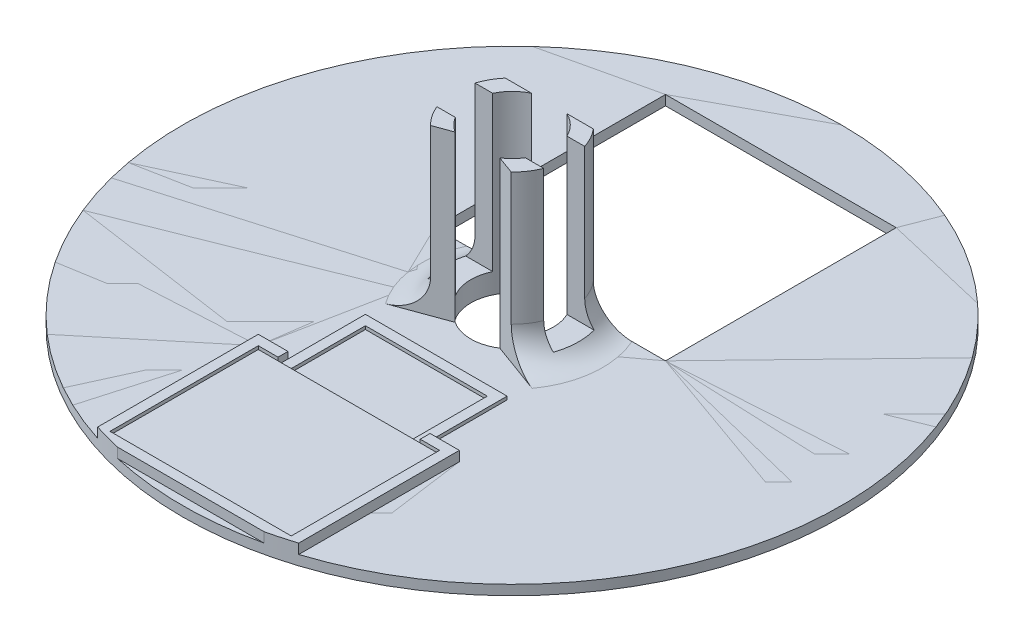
ISO-10303-21;
HEADER;
FILE_DESCRIPTION(('STEP AP214'),'2;1');
FILE_NAME('part.step','',(''),(''),'','','');
FILE_SCHEMA(('AUTOMOTIVE_DESIGN { 1 0 10303 214 1 1 1 1 }'));
ENDSEC;
DATA;
#1=APPLICATION_CONTEXT('core data for automotive mechanical design processes');
#2=APPLICATION_PROTOCOL_DEFINITION('international standard','automotive_design',2000,#1);
#3=PRODUCT_CONTEXT('',#1,'mechanical');
#4=PRODUCT('Part','Part','',(#3));
#5=PRODUCT_RELATED_PRODUCT_CATEGORY('part','',(#4));
#6=PRODUCT_DEFINITION_FORMATION('','',#4);
#7=PRODUCT_DEFINITION_CONTEXT('part definition',#1,'design');
#8=PRODUCT_DEFINITION('design','',#6,#7);
#9=PRODUCT_DEFINITION_SHAPE('','',#8);
#10=(LENGTH_UNIT() NAMED_UNIT(*) SI_UNIT(.MILLI.,.METRE.));
#11=(NAMED_UNIT(*) PLANE_ANGLE_UNIT() SI_UNIT($,.RADIAN.));
#12=(NAMED_UNIT(*) SI_UNIT($,.STERADIAN.) SOLID_ANGLE_UNIT());
#13=UNCERTAINTY_MEASURE_WITH_UNIT(LENGTH_MEASURE(1.E-05),#10,'distance_accuracy_value','');
#14=(GEOMETRIC_REPRESENTATION_CONTEXT(3) GLOBAL_UNCERTAINTY_ASSIGNED_CONTEXT((#13)) GLOBAL_UNIT_ASSIGNED_CONTEXT((#10,
#11,#12)) REPRESENTATION_CONTEXT('',''));
#15=CARTESIAN_POINT('',(0.,0.,0.));
#16=DIRECTION('',(0.,0.,1.));
#17=DIRECTION('',(1.,0.,0.));
#18=AXIS2_PLACEMENT_3D('',#15,#16,#17);
#19=CARTESIAN_POINT('',(0.,3.,0.));
#20=DIRECTION('',(0.,1.,0.));
#21=DIRECTION('',(0.,0.,1.));
#22=AXIS2_PLACEMENT_3D('',#19,#20,#21);
#23=PLANE('',#22);
#24=DIRECTION('',(0.939091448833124,0.,-0.343667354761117));
#25=VECTOR('',#24,1.);
#26=CARTESIAN_POINT('',(-6.78232998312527,3.,10.5));
#27=LINE('',#26,#25);
#28=CARTESIAN_POINT('',(-22.2504532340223,3.,16.1606723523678));
#29=VERTEX_POINT('',#28);
#30=CARTESIAN_POINT('',(-6.78232998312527,3.,10.5));
#31=VERTEX_POINT('',#30);
#32=EDGE_CURVE('E234',#29,#31,#27,.T.);
#33=ORIENTED_EDGE('',*,*,#32,.F.);
#34=CARTESIAN_POINT('',(0.,3.,0.));
#35=DIRECTION('',(0.,1.,0.));
#36=DIRECTION('',(0.,0.,1.));
#37=AXIS2_PLACEMENT_3D('',#34,#35,#36);
#38=CIRCLE('',#37,27.5);
#39=CARTESIAN_POINT('',(-25.071257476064,3.,-11.2996481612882));
#40=VERTEX_POINT('',#39);
#41=EDGE_CURVE('E114',#29,#40,#38,.F.);
#42=ORIENTED_EDGE('',*,*,#41,.T.);
#43=DIRECTION('',(1.,0.,0.));
#44=VECTOR('',#43,1.);
#45=CARTESIAN_POINT('',(-34.7347310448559,3.,-11.2996481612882));
#46=LINE('',#45,#44);
#47=CARTESIAN_POINT('',(-34.7347310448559,3.,-11.2996481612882));
#48=VERTEX_POINT('',#47);
#49=EDGE_CURVE('E245',#48,#40,#46,.T.);
#50=ORIENTED_EDGE('',*,*,#49,.F.);
#51=DIRECTION('',(0.,0.,1.));
#52=VECTOR('',#51,1.);
#53=CARTESIAN_POINT('',(-34.7347310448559,3.,-81.2996481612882));
#54=LINE('',#53,#52);
#55=CARTESIAN_POINT('',(-34.7347310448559,3.,-81.2996481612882));
#56=VERTEX_POINT('',#55);
#57=EDGE_CURVE('E251',#56,#48,#54,.T.);
#58=ORIENTED_EDGE('',*,*,#57,.F.);
#59=DIRECTION('',(-1.,0.,0.));
#60=VECTOR('',#59,1.);
#61=CARTESIAN_POINT('',(-34.7347310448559,3.,-81.2996481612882));
#62=LINE('',#61,#60);
#63=CARTESIAN_POINT('',(35.2652689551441,3.,-81.2996481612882));
#64=VERTEX_POINT('',#63);
#65=EDGE_CURVE('E255',#64,#56,#62,.T.);
#66=ORIENTED_EDGE('',*,*,#65,.F.);
#67=DIRECTION('',(0.,0.,-1.));
#68=VECTOR('',#67,1.);
#69=CARTESIAN_POINT('',(35.2652689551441,3.,-81.2996481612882));
#70=LINE('',#69,#68);
#71=CARTESIAN_POINT('',(35.2652689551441,3.,-11.2996481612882));
#72=VERTEX_POINT('',#71);
#73=EDGE_CURVE('E259',#72,#64,#70,.T.);
#74=ORIENTED_EDGE('',*,*,#73,.F.);
#75=DIRECTION('',(1.,0.,0.));
#76=VECTOR('',#75,1.);
#77=CARTESIAN_POINT('',(5.34489957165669,3.,-11.2996481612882));
#78=LINE('',#77,#76);
#79=CARTESIAN_POINT('',(25.071257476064,3.,-11.2996481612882));
#80=VERTEX_POINT('',#79);
#81=EDGE_CURVE('E263',#80,#72,#78,.T.);
#82=ORIENTED_EDGE('',*,*,#81,.F.);
#83=CARTESIAN_POINT('',(0.,3.,0.));
#84=DIRECTION('',(0.,1.,0.));
#85=DIRECTION('',(0.,0.,1.));
#86=AXIS2_PLACEMENT_3D('',#83,#84,#85);
#87=CIRCLE('',#86,27.5);
#88=CARTESIAN_POINT('',(22.2504532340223,3.,16.1606723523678));
#89=VERTEX_POINT('',#88);
#90=EDGE_CURVE('E267',#80,#89,#87,.F.);
#91=ORIENTED_EDGE('',*,*,#90,.T.);
#92=DIRECTION('',(0.939091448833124,0.,0.343667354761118));
#93=VECTOR('',#92,1.);
#94=CARTESIAN_POINT('',(6.78232998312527,3.,10.5));
#95=LINE('',#94,#93);
#96=CARTESIAN_POINT('',(6.78232998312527,3.,10.5));
#97=VERTEX_POINT('',#96);
#98=EDGE_CURVE('E270',#97,#89,#95,.T.);
#99=ORIENTED_EDGE('',*,*,#98,.F.);
#100=CARTESIAN_POINT('',(0.,3.,0.));
#101=DIRECTION('',(0.,1.,0.));
#102=DIRECTION('',(0.,0.,1.));
#103=AXIS2_PLACEMENT_3D('',#100,#101,#102);
#104=CIRCLE('',#103,12.5);
#105=EDGE_CURVE('E274',#31,#97,#104,.T.);
#106=ORIENTED_EDGE('',*,*,#105,.F.);
#107=EDGE_LOOP('',(#33,#42,#50,#58,#66,#74,#82,#91,#99,#106));
#108=FACE_BOUND('',#107,.T.);
#109=DIRECTION('',(0.,0.,1.));
#110=VECTOR('',#109,1.);
#111=CARTESIAN_POINT('',(-30.5,3.,46.5));
#112=LINE('',#111,#110);
#113=CARTESIAN_POINT('',(-30.5,3.,46.5));
#114=VERTEX_POINT('',#113);
#115=CARTESIAN_POINT('',(-30.5,3.,95.2352350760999));
#116=VERTEX_POINT('',#115);
#117=EDGE_CURVE('E66',#114,#116,#112,.T.);
#118=ORIENTED_EDGE('',*,*,#117,.F.);
#119=DIRECTION('',(-1.,0.,0.));
#120=VECTOR('',#119,1.);
#121=CARTESIAN_POINT('',(-30.5,3.,46.5));
#122=LINE('',#121,#120);
#123=CARTESIAN_POINT('',(-21.5,3.,46.5));
#124=VERTEX_POINT('',#123);
#125=EDGE_CURVE('E280',#124,#114,#122,.T.);
#126=ORIENTED_EDGE('',*,*,#125,.F.);
#127=DIRECTION('',(0.,0.,1.));
#128=VECTOR('',#127,1.);
#129=CARTESIAN_POINT('',(-21.5,3.,23.0003711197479));
#130=LINE('',#129,#128);
#131=CARTESIAN_POINT('',(-21.5,3.,23.0003711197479));
#132=VERTEX_POINT('',#131);
#133=EDGE_CURVE('E284',#132,#124,#130,.T.);
#134=ORIENTED_EDGE('',*,*,#133,.F.);
#135=DIRECTION('',(-1.,0.,0.));
#136=VECTOR('',#135,1.);
#137=CARTESIAN_POINT('',(-21.5,3.,23.0003711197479));
#138=LINE('',#137,#136);
#139=CARTESIAN_POINT('',(21.5,3.,23.0003711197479));
#140=VERTEX_POINT('',#139);
#141=EDGE_CURVE('E288',#140,#132,#138,.T.);
#142=ORIENTED_EDGE('',*,*,#141,.F.);
#143=DIRECTION('',(0.,0.,-1.));
#144=VECTOR('',#143,1.);
#145=CARTESIAN_POINT('',(21.5,3.,23.0003711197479));
#146=LINE('',#145,#144);
#147=CARTESIAN_POINT('',(21.5,3.,49.5));
#148=VERTEX_POINT('',#147);
#149=EDGE_CURVE('E292',#148,#140,#146,.T.);
#150=ORIENTED_EDGE('',*,*,#149,.F.);
#151=DIRECTION('',(-1.,0.,0.));
#152=VECTOR('',#151,1.);
#153=CARTESIAN_POINT('',(21.5,3.,49.5));
#154=LINE('',#153,#152);
#155=CARTESIAN_POINT('',(21.6278419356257,3.,49.5));
#156=VERTEX_POINT('',#155);
#157=EDGE_CURVE('E296',#156,#148,#154,.T.);
#158=ORIENTED_EDGE('',*,*,#157,.F.);
#159=DIRECTION('',(0.,0.,1.));
#160=VECTOR('',#159,1.);
#161=CARTESIAN_POINT('',(21.6278419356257,3.,49.5));
#162=LINE('',#161,#160);
#163=CARTESIAN_POINT('',(21.6278419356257,3.,46.5));
#164=VERTEX_POINT('',#163);
#165=EDGE_CURVE('E168',#164,#156,#162,.T.);
#166=ORIENTED_EDGE('',*,*,#165,.F.);
#167=DIRECTION('',(-1.,0.,0.));
#168=VECTOR('',#167,1.);
#169=CARTESIAN_POINT('',(21.6278419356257,3.,46.5));
#170=LINE('',#169,#168);
#171=CARTESIAN_POINT('',(30.5,3.,46.5));
#172=VERTEX_POINT('',#171);
#173=EDGE_CURVE('E164',#172,#164,#170,.T.);
#174=ORIENTED_EDGE('',*,*,#173,.F.);
#175=DIRECTION('',(0.,0.,-1.));
#176=VECTOR('',#175,1.);
#177=CARTESIAN_POINT('',(30.5,3.,46.5));
#178=LINE('',#177,#176);
#179=CARTESIAN_POINT('',(30.5,3.,95.2352350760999));
#180=VERTEX_POINT('',#179);
#181=EDGE_CURVE('E60',#180,#172,#178,.T.);
#182=ORIENTED_EDGE('',*,*,#181,.F.);
#183=CARTESIAN_POINT('',(0.,3.,0.));
#184=DIRECTION('',(0.,1.,0.));
#185=DIRECTION('',(0.,0.,1.));
#186=AXIS2_PLACEMENT_3D('',#183,#184,#185);
#187=CIRCLE('',#186,100.);
#188=EDGE_CURVE('E12',#180,#116,#187,.T.);
#189=ORIENTED_EDGE('',*,*,#188,.T.);
#190=EDGE_LOOP('',(#118,#126,#134,#142,#150,#158,#166,#174,#182,#189));
#191=FACE_BOUND('',#190,.T.);
#192=ADVANCED_FACE('F51',(#108,#191),#23,.T.);
#193=CARTESIAN_POINT('',(0.,53.,0.));
#194=DIRECTION('',(0.,-1.,0.));
#195=DIRECTION('',(0.,0.,-1.));
#196=AXIS2_PLACEMENT_3D('',#193,#194,#195);
#197=CYLINDRICAL_SURFACE('',#196,17.5);
#198=CARTESIAN_POINT('',(0.,13.,0.));
#199=DIRECTION('',(0.,1.,0.));
#200=DIRECTION('',(0.,0.,1.));
#201=AXIS2_PLACEMENT_3D('',#198,#199,#200);
#202=CIRCLE('',#201,17.5);
#203=CARTESIAN_POINT('',(-13.3629319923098,13.,-11.2996481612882));
#204=VERTEX_POINT('',#203);
#205=CARTESIAN_POINT('',(-16.6460776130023,13.,-5.39982408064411));
#206=VERTEX_POINT('',#205);
#207=EDGE_CURVE('E186',#204,#206,#202,.T.);
#208=ORIENTED_EDGE('',*,*,#207,.T.);
#209=DIRECTION('',(0.,-1.,0.));
#210=VECTOR('',#209,1.);
#211=CARTESIAN_POINT('',(-16.6460776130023,53.,-5.39982408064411));
#212=LINE('',#211,#210);
#213=CARTESIAN_POINT('',(-16.6460776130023,53.,-5.39982408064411));
#214=VERTEX_POINT('',#213);
#215=EDGE_CURVE('E101',#206,#214,#212,.F.);
#216=ORIENTED_EDGE('',*,*,#215,.T.);
#217=CARTESIAN_POINT('',(0.,53.,0.));
#218=DIRECTION('',(0.,1.,0.));
#219=DIRECTION('',(0.,0.,1.));
#220=AXIS2_PLACEMENT_3D('',#217,#218,#219);
#221=CIRCLE('',#220,17.5);
#222=CARTESIAN_POINT('',(-13.3629319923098,53.,-11.2996481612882));
#223=VERTEX_POINT('',#222);
#224=EDGE_CURVE('E105',#223,#214,#221,.T.);
#225=ORIENTED_EDGE('',*,*,#224,.F.);
#226=DIRECTION('',(0.,-1.,0.));
#227=VECTOR('',#226,1.);
#228=CARTESIAN_POINT('',(-13.3629319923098,53.,-11.2996481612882));
#229=LINE('',#228,#227);
#230=EDGE_CURVE('E54',#223,#204,#229,.T.);
#231=ORIENTED_EDGE('',*,*,#230,.T.);
#232=EDGE_LOOP('',(#208,#216,#225,#231));
#233=FACE_BOUND('',#232,.T.);
#234=ADVANCED_FACE('F354',(#233),#197,.T.);
#235=CARTESIAN_POINT('',(0.,13.,0.));
#236=DIRECTION('',(0.,1.,0.));
#237=DIRECTION('',(0.,0.,1.));
#238=AXIS2_PLACEMENT_3D('',#235,#236,#237);
#239=TOROIDAL_SURFACE('',#238,27.5,10.);
#240=CARTESIAN_POINT('',(0.,6.13831486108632,0.));
#241=DIRECTION('',(0.,1.,0.));
#242=DIRECTION('',(0.,0.,1.));
#243=AXIS2_PLACEMENT_3D('',#240,#241,#242);
#244=CIRCLE('',#243,20.2255737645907);
#245=CARTESIAN_POINT('',(-19.1183553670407,6.13831486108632,6.60017591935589));
#246=VERTEX_POINT('',#245);
#247=CARTESIAN_POINT('',(-19.4914271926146,6.13831486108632,-5.39982408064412));
#248=VERTEX_POINT('',#247);
#249=EDGE_CURVE('E190',#246,#248,#244,.F.);
#250=ORIENTED_EDGE('',*,*,#249,.T.);
#251=CARTESIAN_POINT('',(-17.9068847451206,8.24409535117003,-5.39982408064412));
#252=CARTESIAN_POINT('',(-17.7732507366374,8.48073572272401,-5.39982408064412));
#253=CARTESIAN_POINT('',(-17.6493297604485,8.72279998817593,-5.39982408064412));
#254=CARTESIAN_POINT('',(-17.4218766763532,9.21641184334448,-5.39982408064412));
#255=CARTESIAN_POINT('',(-17.318347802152,9.46796092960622,-5.39982408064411));
#256=CARTESIAN_POINT('',(-17.1326152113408,9.97898943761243,-5.39982408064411));
#257=CARTESIAN_POINT('',(-17.0504248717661,10.2384737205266,-5.39982408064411));
#258=CARTESIAN_POINT('',(-16.9082455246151,10.7634538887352,-5.39982408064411));
#259=CARTESIAN_POINT('',(-16.848255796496,11.0289495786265,-5.39982408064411));
#260=CARTESIAN_POINT('',(-16.7510403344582,11.5643198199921,-5.39982408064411));
#261=CARTESIAN_POINT('',(-16.7138345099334,11.8341979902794,-5.39982408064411));
#262=CARTESIAN_POINT('',(-16.6626582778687,12.3761541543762,-5.39982408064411));
#263=CARTESIAN_POINT('',(-16.6486881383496,12.6482321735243,-5.39982408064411));
#264=CARTESIAN_POINT('',(-16.644133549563,13.1925283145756,-5.39982408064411));
#265=CARTESIAN_POINT('',(-16.6535443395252,13.4647463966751,-5.39982408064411));
#266=CARTESIAN_POINT('',(-16.6956412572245,14.0073728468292,-5.39982408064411));
#267=CARTESIAN_POINT('',(-16.7283271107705,14.277781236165,-5.39982408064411));
#268=CARTESIAN_POINT('',(-16.8159317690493,14.8105825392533,-5.39982408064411));
#269=CARTESIAN_POINT('',(-16.8704916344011,15.073034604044,-5.39982408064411));
#270=CARTESIAN_POINT('',(-17.0012826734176,15.5924746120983,-5.39982408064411));
#271=CARTESIAN_POINT('',(-17.0775135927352,15.849462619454,-5.39982408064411));
#272=CARTESIAN_POINT('',(-17.2509169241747,16.3562430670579,-5.39982408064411));
#273=CARTESIAN_POINT('',(-17.3480875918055,16.6060361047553,-5.39982408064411));
#274=CARTESIAN_POINT('',(-17.5625391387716,17.0969388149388,-5.39982408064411));
#275=CARTESIAN_POINT('',(-17.6798275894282,17.3380451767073,-5.39982408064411));
#276=CARTESIAN_POINT('',(-17.9359706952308,17.8145971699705,-5.39982408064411));
#277=CARTESIAN_POINT('',(-18.0752014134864,18.0498406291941,-5.39982408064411));
#278=CARTESIAN_POINT('',(-18.3724006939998,18.508282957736,-5.39982408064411));
#279=CARTESIAN_POINT('',(-18.5303757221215,18.7314776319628,-5.39982408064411));
#280=CARTESIAN_POINT('',(-18.8637891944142,19.1644003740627,-5.39982408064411));
#281=CARTESIAN_POINT('',(-19.039227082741,19.3741288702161,-5.39982408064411));
#282=CARTESIAN_POINT('',(-19.4062844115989,19.7789160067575,-5.39982408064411));
#283=CARTESIAN_POINT('',(-19.5979044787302,19.9739740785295,-5.39982408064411));
#284=CARTESIAN_POINT('',(-20.0046203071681,20.3564203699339,-5.39982408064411));
#285=CARTESIAN_POINT('',(-20.220373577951,20.5431097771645,-5.39982408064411));
#286=CARTESIAN_POINT('',(-20.6664017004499,20.8980968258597,-5.39982408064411));
#287=CARTESIAN_POINT('',(-20.8966722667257,21.0663998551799,-5.39982408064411));
#288=CARTESIAN_POINT('',(-21.3702932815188,21.3837152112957,-5.39982408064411));
#289=CARTESIAN_POINT('',(-21.6136496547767,21.5327186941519,-5.39982408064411));
#290=CARTESIAN_POINT('',(-22.1116052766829,21.8103674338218,-5.39982408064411));
#291=CARTESIAN_POINT('',(-22.3662009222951,21.9390191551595,-5.39982408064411));
#292=CARTESIAN_POINT('',(-22.8928095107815,22.1787517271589,-5.39982408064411));
#293=CARTESIAN_POINT('',(-23.1651159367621,22.2891884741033,-5.39982408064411));
#294=CARTESIAN_POINT('',(-23.7180230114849,22.4868773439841,-5.39982408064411));
#295=CARTESIAN_POINT('',(-23.9986238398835,22.5741289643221,-5.39982408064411));
#296=CARTESIAN_POINT('',(-24.5661685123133,22.7248087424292,-5.39982408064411));
#297=CARTESIAN_POINT('',(-24.8531126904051,22.7882356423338,-5.39982408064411));
#298=CARTESIAN_POINT('',(-25.4313105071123,22.8907578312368,-5.39982408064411));
#299=CARTESIAN_POINT('',(-25.7225640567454,22.9298536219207,-5.39982408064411));
#300=CARTESIAN_POINT('',(-26.3086963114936,22.9834904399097,-5.39982408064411));
#301=CARTESIAN_POINT('',(-26.6035855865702,22.9979161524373,-5.39982408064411));
#302=CARTESIAN_POINT('',(-27.1935279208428,23.0016639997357,-5.39982408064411));
#303=CARTESIAN_POINT('',(-27.4885809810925,22.9909859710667,-5.39982408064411));
#304=CARTESIAN_POINT('',(-28.0766949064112,22.9445049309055,-5.39982408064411));
#305=CARTESIAN_POINT('',(-28.3697558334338,22.908702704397,-5.39982408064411));
#306=CARTESIAN_POINT('',(-28.9517353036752,22.812130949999,-5.39982408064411));
#307=CARTESIAN_POINT('',(-29.2406538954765,22.7513617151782,-5.39982408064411));
#308=CARTESIAN_POINT('',(-29.808838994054,22.6060569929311,-5.39982408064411));
#309=CARTESIAN_POINT('',(-30.0881789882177,22.5218088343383,-5.39982408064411));
#310=CARTESIAN_POINT('',(-30.6386500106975,22.3297739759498,-5.39982408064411));
#311=CARTESIAN_POINT('',(-30.9097810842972,22.2219874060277,-5.39982408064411));
#312=CARTESIAN_POINT('',(-31.4417917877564,21.9835766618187,-5.39982408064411));
#313=CARTESIAN_POINT('',(-31.7026720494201,21.852953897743,-5.39982408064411));
#314=CARTESIAN_POINT('',(-32.2122244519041,21.5697419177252,-5.39982408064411));
#315=CARTESIAN_POINT('',(-32.4608967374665,21.4171529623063,-5.39982408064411));
#316=CARTESIAN_POINT('',(-32.9401553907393,21.0937477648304,-5.39982408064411));
#317=CARTESIAN_POINT('',(-33.1709719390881,20.9232725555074,-5.39982408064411));
#318=CARTESIAN_POINT('',(-33.617230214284,20.5632625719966,-5.39982408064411));
#319=CARTESIAN_POINT('',(-33.8326720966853,20.3737279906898,-5.39982408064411));
#320=CARTESIAN_POINT('',(-34.2465426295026,19.9769362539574,-5.39982408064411));
#321=CARTESIAN_POINT('',(-34.4449723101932,19.7696801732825,-5.39982408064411));
#322=CARTESIAN_POINT('',(-34.823321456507,19.3389093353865,-5.39982408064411));
#323=CARTESIAN_POINT('',(-35.0032410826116,19.115394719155,-5.39982408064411));
#324=CARTESIAN_POINT('',(-35.3407333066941,18.6570556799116,-5.39982408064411));
#325=CARTESIAN_POINT('',(-35.4985911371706,18.422441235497,-5.39982408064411));
#326=CARTESIAN_POINT('',(-35.7938027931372,17.9406489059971,-5.39982408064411));
#327=CARTESIAN_POINT('',(-35.9311568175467,17.6934711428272,-5.39982408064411));
#328=CARTESIAN_POINT('',(-36.1843190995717,17.1883311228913,-5.39982408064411));
#329=CARTESIAN_POINT('',(-36.3001283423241,16.9303693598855,-5.39982408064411));
#330=CARTESIAN_POINT('',(-36.509330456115,16.4055104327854,-5.39982408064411));
#331=CARTESIAN_POINT('',(-36.6027234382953,16.138613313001,-5.39982408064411));
#332=CARTESIAN_POINT('',(-36.7655712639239,15.6005009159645,-5.39982408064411));
#333=CARTESIAN_POINT('',(-36.835254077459,15.3293546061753,-5.39982408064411));
#334=CARTESIAN_POINT('',(-36.9514274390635,14.7821389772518,-5.39982408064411));
#335=CARTESIAN_POINT('',(-36.9979181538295,14.506069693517,-5.39982408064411));
#336=CARTESIAN_POINT('',(-37.0673579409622,13.9509938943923,-5.39982408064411));
#337=CARTESIAN_POINT('',(-37.0903076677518,13.671987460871,-5.39982408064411));
#338=CARTESIAN_POINT('',(-37.1124953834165,13.1130332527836,-5.39982408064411));
#339=CARTESIAN_POINT('',(-37.1117334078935,12.8330854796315,-5.39982408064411));
#340=CARTESIAN_POINT('',(-37.086563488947,12.2755847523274,-5.39982408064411));
#341=CARTESIAN_POINT('',(-37.0622675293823,11.9980267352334,-5.39982408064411));
#342=CARTESIAN_POINT('',(-36.990374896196,11.4459460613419,-5.39982408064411));
#343=CARTESIAN_POINT('',(-36.942778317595,11.1714233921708,-5.39982408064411));
#344=CARTESIAN_POINT('',(-36.8246386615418,10.6273640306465,-5.39982408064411));
#345=CARTESIAN_POINT('',(-36.7540957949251,10.3578272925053,-5.39982408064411));
#346=CARTESIAN_POINT('',(-36.5905863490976,9.82564365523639,-5.39982408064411));
#347=CARTESIAN_POINT('',(-36.4976197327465,9.56299676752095,-5.39982408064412));
#348=CARTESIAN_POINT('',(-36.2898995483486,9.04631730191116,-5.39982408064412));
#349=CARTESIAN_POINT('',(-36.175135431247,8.79228896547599,-5.39982408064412));
#350=CARTESIAN_POINT('',(-35.9246955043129,8.2947602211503,-5.39982408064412));
#351=CARTESIAN_POINT('',(-35.7890197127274,8.0512598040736,-5.39982408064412));
#352=CARTESIAN_POINT('',(-35.4977502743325,7.5764772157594,-5.39982408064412));
#353=CARTESIAN_POINT('',(-35.3421564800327,7.34519513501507,-5.39982408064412));
#354=CARTESIAN_POINT('',(-35.0121861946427,6.89644288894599,-5.39982408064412));
#355=CARTESIAN_POINT('',(-34.83780961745,6.67897278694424,-5.39982408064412));
#356=CARTESIAN_POINT('',(-34.4705027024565,6.25814046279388,-5.39982408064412));
#357=CARTESIAN_POINT('',(-34.2774732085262,6.05486478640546,-5.39982408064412));
#358=CARTESIAN_POINT('',(-33.8751002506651,5.66516030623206,-5.39982408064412));
#359=CARTESIAN_POINT('',(-33.6657567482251,5.47873154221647,-5.39982408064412));
#360=CARTESIAN_POINT('',(-33.2322620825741,5.12396403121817,-5.39982408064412));
#361=CARTESIAN_POINT('',(-33.0081107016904,4.95562555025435,-5.39982408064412));
#362=CARTESIAN_POINT('',(-32.5465976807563,4.63814023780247,-5.39982408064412));
#363=CARTESIAN_POINT('',(-32.3092355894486,4.48899406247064,-5.39982408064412));
#364=CARTESIAN_POINT('',(-31.8204085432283,4.20938066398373,-5.39982408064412));
#365=CARTESIAN_POINT('',(-31.5688208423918,4.07912801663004,-5.39982408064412));
#366=CARTESIAN_POINT('',(-31.0556717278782,3.84003289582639,-5.39982408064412));
#367=CARTESIAN_POINT('',(-30.7941102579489,3.73119054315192,-5.39982408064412));
#368=CARTESIAN_POINT('',(-30.2628481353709,3.53557747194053,-5.39982408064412));
#369=CARTESIAN_POINT('',(-29.993147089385,3.44880782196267,-5.39982408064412));
#370=CARTESIAN_POINT('',(-29.4474983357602,3.29785031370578,-5.39982408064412));
#371=CARTESIAN_POINT('',(-29.1715505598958,3.23366270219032,-5.39982408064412));
#372=CARTESIAN_POINT('',(-28.6112012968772,3.12743457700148,-5.39982408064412));
#373=CARTESIAN_POINT('',(-28.3267351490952,3.08573502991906,-5.39982408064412));
#374=CARTESIAN_POINT('',(-27.7553217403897,3.02613672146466,-5.39982408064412));
#375=CARTESIAN_POINT('',(-27.4683744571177,3.00823817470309,-5.39982408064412));
#376=CARTESIAN_POINT('',(-26.8940267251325,2.99627267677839,-5.39982408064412));
#377=CARTESIAN_POINT('',(-26.6066263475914,3.00220229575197,-5.39982408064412));
#378=CARTESIAN_POINT('',(-26.0331966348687,3.0377649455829,-5.39982408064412));
#379=CARTESIAN_POINT('',(-25.7471678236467,3.06740640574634,-5.39982408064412));
#380=CARTESIAN_POINT('',(-25.1740577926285,3.15077776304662,-5.39982408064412));
#381=CARTESIAN_POINT('',(-24.8870304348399,3.20487819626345,-5.39982408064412));
#382=CARTESIAN_POINT('',(-24.3183589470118,3.33685218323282,-5.39982408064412));
#383=CARTESIAN_POINT('',(-24.0367173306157,3.41473656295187,-5.39982408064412));
#384=CARTESIAN_POINT('',(-23.4808084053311,3.59372047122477,-5.39982408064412));
#385=CARTESIAN_POINT('',(-23.2065435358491,3.69482757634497,-5.39982408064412));
#386=CARTESIAN_POINT('',(-22.6675068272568,3.91947945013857,-5.39982408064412));
#387=CARTESIAN_POINT('',(-22.402730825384,4.04301423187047,-5.39982408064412));
#388=CARTESIAN_POINT('',(-21.8813543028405,4.31328941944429,-5.39982408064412));
#389=CARTESIAN_POINT('',(-21.6248857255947,4.4602844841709,-5.39982408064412));
#390=CARTESIAN_POINT('',(-21.1253806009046,4.77536224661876,-5.39982408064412));
#391=CARTESIAN_POINT('',(-20.8823390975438,4.94343708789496,-5.39982408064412));
#392=CARTESIAN_POINT('',(-20.4115706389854,5.29946935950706,-5.39982408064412));
#393=CARTESIAN_POINT('',(-20.1838317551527,5.48741100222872,-5.39982408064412));
#394=CARTESIAN_POINT('',(-19.7452855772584,5.8819706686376,-5.39982408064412));
#395=CARTESIAN_POINT('',(-19.5344741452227,6.08858410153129,-5.39982408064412));
#396=CARTESIAN_POINT('',(-19.0580509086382,6.59755333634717,-5.39982408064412));
#397=CARTESIAN_POINT('',(-18.8003792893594,6.90740835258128,-5.39982408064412));
#398=CARTESIAN_POINT('',(-18.323677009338,7.55558186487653,-5.39982408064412));
#399=CARTESIAN_POINT('',(-18.1046450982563,7.8938994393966,-5.39982408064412));
#400=CARTESIAN_POINT('',(-17.9068847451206,8.24409535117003,-5.39982408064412));
#401=B_SPLINE_CURVE_WITH_KNOTS('',3,(#251,#252,#253,#254,#255,#256,#257,#258,#259,#260,#261,
#262,#263,#264,#265,#266,#267,#268,#269,#270,#271,#272,#273,#274,#275,#276,#277,#278,#279,#280,
#281,#282,#283,#284,#285,#286,#287,#288,#289,#290,#291,#292,#293,#294,#295,#296,#297,#298,#299,
#300,#301,#302,#303,#304,#305,#306,#307,#308,#309,#310,#311,#312,#313,#314,#315,#316,#317,#318,
#319,#320,#321,#322,#323,#324,#325,#326,#327,#328,#329,#330,#331,#332,#333,#334,#335,#336,#337,
#338,#339,#340,#341,#342,#343,#344,#345,#346,#347,#348,#349,#350,#351,#352,#353,#354,#355,#356,
#357,#358,#359,#360,#361,#362,#363,#364,#365,#366,#367,#368,#369,#370,#371,#372,#373,#374,#375,
#376,#377,#378,#379,#380,#381,#382,#383,#384,#385,#386,#387,#388,#389,#390,#391,#392,#393,#394,
#395,#396,#397,#398,#399,#400),.UNSPECIFIED.,.T.,.F.,(4,2,2,2,2,2,2,2,2,2,2,2,2,2,2,2,2,2,2,2,2,
2,2,2,2,2,2,2,2,2,2,2,2,2,2,2,2,2,2,2,2,2,2,2,2,2,2,2,2,2,2,2,2,2,2,2,2,2,2,2,2,2,2,2,2,2,2,2,2,
2,2,2,2,2,4),(0.,0.814972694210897,1.63007451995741,2.44568610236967,3.26127121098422,
4.07756799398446,4.89387419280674,5.71001419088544,6.52614457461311,7.32939767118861,
8.13264134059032,8.93581811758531,9.73929783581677,10.5584511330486,11.3778878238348,
12.1972984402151,13.0167408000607,13.8716982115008,14.7264044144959,15.5815009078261,
16.4363252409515,17.3168345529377,18.1973629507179,19.0779378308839,19.9584945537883,
20.843156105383,21.7278234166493,22.6124630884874,23.4970923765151,24.3713383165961,
25.2455794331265,26.1197665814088,26.9939433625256,27.8537435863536,28.7135351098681,
29.5732745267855,30.433006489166,31.280321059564,32.1276274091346,32.9748950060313,
33.8221584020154,34.6610286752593,35.4998929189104,36.3387338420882,37.1775735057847,
38.0124411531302,38.8473053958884,39.6821619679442,40.5170199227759,41.3522829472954,
42.1875452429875,43.0228137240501,43.858086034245,44.6980722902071,45.5380605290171,
46.378061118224,47.2180904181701,48.0670171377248,48.9159486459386,49.7649212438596,
50.6139031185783,51.4754192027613,52.3369430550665,53.1983429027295,54.0600491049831,
54.9352712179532,55.8108923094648,56.6867994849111,57.5623175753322,58.4480819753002,
59.3335172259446,60.2182540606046,61.1027739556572,62.3088629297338,63.5149128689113),.UNSPECIFIED.);
#402=EDGE_CURVE('E193',#248,#206,#401,.T.);
#403=ORIENTED_EDGE('',*,*,#402,.T.);
#404=ORIENTED_EDGE('',*,*,#207,.F.);
#405=CARTESIAN_POINT('',(-25.071257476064,3.,-11.2996481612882));
#406=CARTESIAN_POINT('',(-24.7182118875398,2.99997675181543,-11.2996481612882));
#407=CARTESIAN_POINT('',(-24.3652285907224,3.0155378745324,-11.2996481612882));
#408=CARTESIAN_POINT('',(-23.6620239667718,3.07696378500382,-11.2996481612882));
#409=CARTESIAN_POINT('',(-23.3118017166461,3.12281797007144,-11.2996481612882));
#410=CARTESIAN_POINT('',(-22.6172144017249,3.24384268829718,-11.2996481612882));
#411=CARTESIAN_POINT('',(-22.2728388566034,3.31895329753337,-11.2996481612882));
#412=CARTESIAN_POINT('',(-21.5915088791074,3.49753188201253,-11.2996481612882));
#413=CARTESIAN_POINT('',(-21.2545550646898,3.6010022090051,-11.2996481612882));
#414=CARTESIAN_POINT('',(-20.5906496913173,3.83520388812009,-11.2996481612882));
#415=CARTESIAN_POINT('',(-20.2636873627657,3.96590460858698,-11.2996481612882));
#416=CARTESIAN_POINT('',(-19.6216825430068,4.2535608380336,-11.2996481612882));
#417=CARTESIAN_POINT('',(-19.3066399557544,4.41051613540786,-11.2996481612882));
#418=CARTESIAN_POINT('',(-18.3812626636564,4.92018680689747,-11.2996481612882));
#419=CARTESIAN_POINT('',(-17.7912710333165,5.31149768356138,-11.2996481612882));
#420=CARTESIAN_POINT('',(-16.9578024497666,5.97363390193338,-11.2996481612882));
#421=CARTESIAN_POINT('',(-16.6859708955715,6.20979272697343,-11.2996481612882));
#422=CARTESIAN_POINT('',(-16.1648603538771,6.70615102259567,-11.2996481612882));
#423=CARTESIAN_POINT('',(-15.915585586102,6.96635497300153,-11.2996481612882));
#424=CARTESIAN_POINT('',(-15.443917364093,7.5091239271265,-11.2996481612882));
#425=CARTESIAN_POINT('',(-15.2214672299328,7.79163961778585,-11.2996481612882));
#426=CARTESIAN_POINT('',(-14.8071595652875,8.37821455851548,-11.2996481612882));
#427=CARTESIAN_POINT('',(-14.6152822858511,8.68225971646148,-11.2996481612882));
#428=CARTESIAN_POINT('',(-14.3281024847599,9.19987402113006,-11.2996481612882));
#429=CARTESIAN_POINT('',(-14.2225270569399,9.40778884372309,-11.2996481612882));
#430=CARTESIAN_POINT('',(-14.0277907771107,9.83114550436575,-11.2996481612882));
#431=CARTESIAN_POINT('',(-13.9386251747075,10.0465851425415,-11.2996481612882));
#432=CARTESIAN_POINT('',(-13.7783420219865,10.4835244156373,-11.2996481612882));
#433=CARTESIAN_POINT('',(-13.7071824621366,10.7050085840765,-11.2996481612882));
#434=CARTESIAN_POINT('',(-13.5840159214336,11.1531659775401,-11.2996481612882));
#435=CARTESIAN_POINT('',(-13.5320017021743,11.3798372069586,-11.2996481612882));
#436=CARTESIAN_POINT('',(-13.4480772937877,11.8376845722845,-11.2996481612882));
#437=CARTESIAN_POINT('',(-13.4162326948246,12.0688729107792,-11.2996481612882));
#438=CARTESIAN_POINT('',(-13.3842981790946,12.4171551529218,-11.2996481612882));
#439=CARTESIAN_POINT('',(-13.3762920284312,12.5335694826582,-11.2996481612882));
#440=CARTESIAN_POINT('',(-13.3656073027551,12.7666502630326,-11.2996481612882));
#441=CARTESIAN_POINT('',(-13.3629290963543,12.8833167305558,-11.2996481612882));
#442=CARTESIAN_POINT('',(-13.3629319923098,13.,-11.2996481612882));
#443=B_SPLINE_CURVE_WITH_KNOTS('',3,(#405,#406,#407,#408,#409,#410,#411,#412,#413,#414,#415,
#416,#417,#418,#419,#420,#421,#422,#423,#424,#425,#426,#427,#428,#429,#430,#431,#432,#433,#434,
#435,#436,#437,#438,#439,#440,#441,#442),.UNSPECIFIED.,.F.,.F.,(4,2,2,2,2,2,2,2,2,2,2,2,2,2,2,2,
2,2,4),(0.,1.05870368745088,2.11703702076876,3.17321394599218,4.22947848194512,5.28456117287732,
6.3396353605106,8.45164818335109,9.5307796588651,10.6101125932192,11.6871233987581,
12.7634356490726,13.4623763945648,14.161114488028,14.858207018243,15.5550357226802,
16.2541189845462,16.6040807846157,16.9540667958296),.UNSPECIFIED.);
#444=EDGE_CURVE('E201',#204,#40,#443,.F.);
#445=ORIENTED_EDGE('',*,*,#444,.T.);
#446=ORIENTED_EDGE('',*,*,#41,.F.);
#447=CARTESIAN_POINT('',(-12.2474487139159,13.,12.5));
#448=CARTESIAN_POINT('',(-12.2474475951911,12.8676520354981,12.4999995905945));
#449=CARTESIAN_POINT('',(-12.2501826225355,12.7353216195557,12.5010004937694));
#450=CARTESIAN_POINT('',(-12.2611066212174,12.4709210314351,12.5049982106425));
#451=CARTESIAN_POINT('',(-12.2692953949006,12.3388508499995,12.5079949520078));
#452=CARTESIAN_POINT('',(-12.3020024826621,11.9435066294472,12.5199643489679));
#453=CARTESIAN_POINT('',(-12.3346616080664,11.6809451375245,12.5319161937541));
#454=CARTESIAN_POINT('',(-12.4210606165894,11.1609100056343,12.5635345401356));
#455=CARTESIAN_POINT('',(-12.4747161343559,10.9034202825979,12.5831701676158));
#456=CARTESIAN_POINT('',(-12.6024035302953,10.3942210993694,12.6298983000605));
#457=CARTESIAN_POINT('',(-12.6764365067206,10.1425119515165,12.6569912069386));
#458=CARTESIAN_POINT('',(-12.8438573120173,9.64687946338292,12.7182600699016));
#459=CARTESIAN_POINT('',(-12.9372204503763,9.40294664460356,12.7524269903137));
#460=CARTESIAN_POINT('',(-13.1423471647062,8.92392062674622,12.8274946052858));
#461=CARTESIAN_POINT('',(-13.2541176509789,8.68883078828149,12.868397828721));
#462=CARTESIAN_POINT('',(-13.494953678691,8.22879429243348,12.9565335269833));
#463=CARTESIAN_POINT('',(-13.6240270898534,8.00385231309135,13.0037688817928));
#464=CARTESIAN_POINT('',(-13.8983019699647,7.56529989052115,13.1041417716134));
#465=CARTESIAN_POINT('',(-14.0435097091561,7.35169390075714,13.1572816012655));
#466=CARTESIAN_POINT('',(-14.3567297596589,6.92619056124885,13.2719067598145));
#467=CARTESIAN_POINT('',(-14.5255333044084,6.71495359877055,13.3336816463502));
#468=CARTESIAN_POINT('',(-14.8783186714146,6.30722592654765,13.4627860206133));
#469=CARTESIAN_POINT('',(-15.0623070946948,6.1107417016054,13.5301179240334));
#470=CARTESIAN_POINT('',(-15.4440270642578,5.73358502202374,13.6698111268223));
#471=CARTESIAN_POINT('',(-15.6417575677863,5.5529113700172,13.7421720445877));
#472=CARTESIAN_POINT('',(-16.0496368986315,5.20822094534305,13.891438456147));
#473=CARTESIAN_POINT('',(-16.2597863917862,5.04420506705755,13.9683441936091));
#474=CARTESIAN_POINT('',(-16.7087630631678,4.7209672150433,14.1326504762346));
#475=CARTESIAN_POINT('',(-16.9485315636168,4.5632256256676,14.2203955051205));
#476=CARTESIAN_POINT('',(-17.4392706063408,4.26913902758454,14.3999850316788));
#477=CARTESIAN_POINT('',(-17.6902378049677,4.13278768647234,14.491828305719));
#478=CARTESIAN_POINT('',(-18.2018774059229,3.88219962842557,14.6790665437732));
#479=CARTESIAN_POINT('',(-18.462554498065,3.76797376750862,14.7744632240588));
#480=CARTESIAN_POINT('',(-18.9916738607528,3.5625147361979,14.9680983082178));
#481=CARTESIAN_POINT('',(-19.2601133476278,3.47127343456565,15.0663356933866));
#482=CARTESIAN_POINT('',(-19.8122202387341,3.30972153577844,15.2683832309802));
#483=CARTESIAN_POINT('',(-20.0960962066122,3.24021757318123,15.3722697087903));
#484=CARTESIAN_POINT('',(-20.6683563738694,3.12703954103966,15.5816924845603));
#485=CARTESIAN_POINT('',(-20.9567406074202,3.08336566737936,15.6872287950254));
#486=CARTESIAN_POINT('',(-21.5362821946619,3.02230113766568,15.8993162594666));
#487=CARTESIAN_POINT('',(-21.827442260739,3.00493958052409,16.0058684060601));
#488=CARTESIAN_POINT('',(-22.4101265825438,2.99687824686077,16.2191059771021));
#489=CARTESIAN_POINT('',(-22.7016508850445,3.00618234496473,16.3257914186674));
#490=CARTESIAN_POINT('',(-22.9922673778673,3.0289651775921,16.4321446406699));
#491=B_SPLINE_CURVE_WITH_KNOTS('',3,(#447,#448,#449,#450,#451,#452,#453,#454,#455,#456,#457,
#458,#459,#460,#461,#462,#463,#464,#465,#466,#467,#468,#469,#470,#471,#472,#473,#474,#475,#476,
#477,#478,#479,#480,#481,#482,#483,#484,#485,#486,#487,#488,#489,#490),.UNSPECIFIED.,.F.,.F.,(4,
2,2,2,2,2,2,2,2,2,2,2,2,2,2,2,2,2,2,2,2,4),(0.,0.396977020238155,0.793939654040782,
1.58740519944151,2.37771473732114,3.16806687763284,3.95741565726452,4.74706144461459,
5.53706760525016,6.32738186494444,7.15859206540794,7.99016552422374,8.82167595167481,
9.65323100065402,10.5525642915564,11.4516308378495,12.3511374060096,13.2503253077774,
14.1797377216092,15.1091571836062,16.0396037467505,16.970185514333),.UNSPECIFIED.);
#492=CARTESIAN_POINT('',(-12.2474487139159,13.,12.5));
#493=VERTEX_POINT('',#492);
#494=EDGE_CURVE('E214',#29,#493,#491,.F.);
#495=ORIENTED_EDGE('',*,*,#494,.T.);
#496=CARTESIAN_POINT('',(-16.2076425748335,13.,6.60017591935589));
#497=VERTEX_POINT('',#496);
#498=EDGE_CURVE('E183',#497,#493,#202,.T.);
#499=ORIENTED_EDGE('',*,*,#498,.F.);
#500=CARTESIAN_POINT('',(-17.6022591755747,8.07127358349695,6.60017591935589));
#501=CARTESIAN_POINT('',(-17.7541123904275,7.82026298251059,6.60017591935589));
#502=CARTESIAN_POINT('',(-17.9170130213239,7.57593128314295,6.60017591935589));
#503=CARTESIAN_POINT('',(-18.2633487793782,7.10214397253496,6.60017591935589));
#504=CARTESIAN_POINT('',(-18.4467927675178,6.87269484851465,6.60017591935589));
#505=CARTESIAN_POINT('',(-18.8327996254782,6.4298587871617,6.60017591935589));
#506=CARTESIAN_POINT('',(-19.0353922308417,6.21649778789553,6.60017591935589));
#507=CARTESIAN_POINT('',(-19.4578384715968,5.80744807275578,6.60017591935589));
#508=CARTESIAN_POINT('',(-19.6776988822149,5.61176635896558,6.60017591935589));
#509=CARTESIAN_POINT('',(-20.132290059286,5.23983279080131,6.60017591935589));
#510=CARTESIAN_POINT('',(-20.3669794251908,5.06353030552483,6.60017591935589));
#511=CARTESIAN_POINT('',(-20.8500527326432,4.73079485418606,6.60017591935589));
#512=CARTESIAN_POINT('',(-21.0984372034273,4.57436265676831,6.60017591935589));
#513=CARTESIAN_POINT('',(-21.6070451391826,4.2823881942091,6.60017591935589));
#514=CARTESIAN_POINT('',(-21.8672632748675,4.14683664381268,6.60017591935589));
#515=CARTESIAN_POINT('',(-22.3978825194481,3.8973871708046,6.60017591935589));
#516=CARTESIAN_POINT('',(-22.6682838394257,3.78348969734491,6.60017591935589));
#517=CARTESIAN_POINT('',(-23.2254615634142,3.57511236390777,6.60017591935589));
#518=CARTESIAN_POINT('',(-23.5124854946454,3.48129363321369,6.60017591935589));
#519=CARTESIAN_POINT('',(-24.0933918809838,3.31808996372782,6.60017591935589));
#520=CARTESIAN_POINT('',(-24.3872742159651,3.24870459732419,6.60017591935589));
#521=CARTESIAN_POINT('',(-24.9799427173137,3.13491665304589,6.60017591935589));
#522=CARTESIAN_POINT('',(-25.2787305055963,3.09052251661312,6.60017591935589));
#523=CARTESIAN_POINT('',(-25.8788786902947,3.0271961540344,6.60017591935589));
#524=CARTESIAN_POINT('',(-26.180238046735,3.00825408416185,6.60017591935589));
#525=CARTESIAN_POINT('',(-26.7834806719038,2.99607435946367,6.60017591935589));
#526=CARTESIAN_POINT('',(-27.0853639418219,3.00283676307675,6.60017591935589));
#527=CARTESIAN_POINT('',(-27.6874503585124,3.04217221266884,6.60017591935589));
#528=CARTESIAN_POINT('',(-27.987653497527,3.0747453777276,6.60017591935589));
#529=CARTESIAN_POINT('',(-28.5841212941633,3.16562353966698,6.60017591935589));
#530=CARTESIAN_POINT('',(-28.8803862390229,3.22392664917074,6.60017591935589));
#531=CARTESIAN_POINT('',(-29.4667476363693,3.36599643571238,6.60017591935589));
#532=CARTESIAN_POINT('',(-29.7568442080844,3.44976262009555,6.60017591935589));
#533=CARTESIAN_POINT('',(-30.322636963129,3.64027229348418,6.60017591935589));
#534=CARTESIAN_POINT('',(-30.5985074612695,3.74649822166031,6.60017591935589));
#535=CARTESIAN_POINT('',(-31.1400973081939,3.98227570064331,6.60017591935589));
#536=CARTESIAN_POINT('',(-31.4058167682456,4.11182699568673,6.60017591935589));
#537=CARTESIAN_POINT('',(-31.9250303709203,4.39341548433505,6.60017591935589));
#538=CARTESIAN_POINT('',(-32.1785257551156,4.54545038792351,6.60017591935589));
#539=CARTESIAN_POINT('',(-32.6713306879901,4.8709966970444,6.60017591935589));
#540=CARTESIAN_POINT('',(-32.9106404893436,5.04450771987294,6.60017591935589));
#541=CARTESIAN_POINT('',(-33.3674017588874,5.40721561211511,6.60017591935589));
#542=CARTESIAN_POINT('',(-33.5852493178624,5.59591385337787,6.60017591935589));
#543=CARTESIAN_POINT('',(-34.0039716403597,5.99128682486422,6.60017591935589));
#544=CARTESIAN_POINT('',(-34.2048466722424,6.19796127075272,6.60017591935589));
#545=CARTESIAN_POINT('',(-34.5880442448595,6.62781781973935,6.60017591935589));
#546=CARTESIAN_POINT('',(-34.7703684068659,6.85099847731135,6.60017591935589));
#547=CARTESIAN_POINT('',(-35.1150475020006,7.31228247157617,6.60017591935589));
#548=CARTESIAN_POINT('',(-35.2774026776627,7.55038562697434,6.60017591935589));
#549=CARTESIAN_POINT('',(-35.5777519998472,8.0347738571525,6.60017591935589));
#550=CARTESIAN_POINT('',(-35.7161759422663,8.28079253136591,6.60017591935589));
#551=CARTESIAN_POINT('',(-35.971557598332,8.78372957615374,6.60017591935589));
#552=CARTESIAN_POINT('',(-36.0885156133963,9.04064779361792,6.60017591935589));
#553=CARTESIAN_POINT('',(-36.30005214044,9.56351961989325,6.60017591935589));
#554=CARTESIAN_POINT('',(-36.3946320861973,9.82947264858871,6.60017591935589));
#555=CARTESIAN_POINT('',(-36.5606838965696,10.3684979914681,6.60017591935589));
#556=CARTESIAN_POINT('',(-36.6321559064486,10.6415702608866,6.60017591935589));
#557=CARTESIAN_POINT('',(-36.750650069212,11.1892207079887,6.60017591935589));
#558=CARTESIAN_POINT('',(-36.7979803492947,11.4637322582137,6.60017591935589));
#559=CARTESIAN_POINT('',(-36.869227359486,12.0157759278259,6.60017591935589));
#560=CARTESIAN_POINT('',(-36.8931443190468,12.2933080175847,6.60017591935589));
#561=CARTESIAN_POINT('',(-36.917381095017,12.8493907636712,6.60017591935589));
#562=CARTESIAN_POINT('',(-36.9177017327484,13.1279413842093,6.60017591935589));
#563=CARTESIAN_POINT('',(-36.8947454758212,13.6840685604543,6.60017591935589));
#564=CARTESIAN_POINT('',(-36.871468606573,13.9616451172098,6.60017591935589));
#565=CARTESIAN_POINT('',(-36.8016796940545,14.5123826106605,6.60017591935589));
#566=CARTESIAN_POINT('',(-36.7552899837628,14.7855590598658,6.60017591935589));
#567=CARTESIAN_POINT('',(-36.6396887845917,15.327037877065,6.60017591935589));
#568=CARTESIAN_POINT('',(-36.57047740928,15.5953402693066,6.60017591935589));
#569=CARTESIAN_POINT('',(-36.4097564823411,16.1251776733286,6.60017591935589));
#570=CARTESIAN_POINT('',(-36.3182471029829,16.3867127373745,6.60017591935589));
#571=CARTESIAN_POINT('',(-36.1136181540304,16.9011869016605,6.60017591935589));
#572=CARTESIAN_POINT('',(-36.000498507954,17.1541259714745,6.60017591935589));
#573=CARTESIAN_POINT('',(-35.7531764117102,17.6502917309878,6.60017591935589));
#574=CARTESIAN_POINT('',(-35.6189203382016,17.8934916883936,6.60017591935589));
#575=CARTESIAN_POINT('',(-35.3305394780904,18.3678089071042,6.60017591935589));
#576=CARTESIAN_POINT('',(-35.1764146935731,18.5989261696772,6.60017591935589));
#577=CARTESIAN_POINT('',(-34.8494341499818,19.0475114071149,6.60017591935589));
#578=CARTESIAN_POINT('',(-34.6765780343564,19.2649791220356,6.60017591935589));
#579=CARTESIAN_POINT('',(-34.3134041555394,19.6848077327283,6.60017591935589));
#580=CARTESIAN_POINT('',(-34.1230862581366,19.8871685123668,6.60017591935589));
#581=CARTESIAN_POINT('',(-33.7243354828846,20.2774468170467,6.60017591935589));
#582=CARTESIAN_POINT('',(-33.5157370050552,20.4651951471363,6.60017591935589));
#583=CARTESIAN_POINT('',(-33.0836524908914,20.8226940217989,6.60017591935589));
#584=CARTESIAN_POINT('',(-32.8601663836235,20.9924444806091,6.60017591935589));
#585=CARTESIAN_POINT('',(-32.3999112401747,21.3128763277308,6.60017591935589));
#586=CARTESIAN_POINT('',(-32.1631418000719,21.463557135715,6.60017591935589));
#587=CARTESIAN_POINT('',(-31.678000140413,21.7449267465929,6.60017591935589));
#588=CARTESIAN_POINT('',(-31.4296274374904,21.8756147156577,6.60017591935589));
#589=CARTESIAN_POINT('',(-30.9185935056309,22.1183300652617,6.60017591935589));
#590=CARTESIAN_POINT('',(-30.6557584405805,22.2299914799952,6.60017591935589));
#591=CARTESIAN_POINT('',(-30.1217515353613,22.4311784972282,6.60017591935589));
#592=CARTESIAN_POINT('',(-29.8505796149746,22.5207038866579,6.60017591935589));
#593=CARTESIAN_POINT('',(-29.3017741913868,22.6771523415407,6.60017591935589));
#594=CARTESIAN_POINT('',(-29.0241402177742,22.7440737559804,6.60017591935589));
#595=CARTESIAN_POINT('',(-28.4643311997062,22.8549975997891,6.60017591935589));
#596=CARTESIAN_POINT('',(-28.1821560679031,22.8989995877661,6.60017591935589));
#597=CARTESIAN_POINT('',(-27.6085929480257,22.9646842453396,6.60017591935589));
#598=CARTESIAN_POINT('',(-27.3171429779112,22.9858261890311,6.60017591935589));
#599=CARTESIAN_POINT('',(-26.7334944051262,23.0039567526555,6.60017591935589));
#600=CARTESIAN_POINT('',(-26.4412957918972,23.000945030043,6.60017591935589));
#601=CARTESIAN_POINT('',(-25.8581559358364,22.9709247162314,6.60017591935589));
#602=CARTESIAN_POINT('',(-25.5672146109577,22.9439177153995,6.60017591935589));
#603=CARTESIAN_POINT('',(-24.9884164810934,22.86619548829,6.60017591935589));
#604=CARTESIAN_POINT('',(-24.7005607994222,22.8154719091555,6.60017591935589));
#605=CARTESIAN_POINT('',(-24.1231854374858,22.6892682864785,6.60017591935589));
#606=CARTESIAN_POINT('',(-23.8337874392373,22.6132310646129,6.60017591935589));
#607=CARTESIAN_POINT('',(-23.2622106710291,22.4373235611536,6.60017591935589));
#608=CARTESIAN_POINT('',(-22.9800346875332,22.337444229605,6.60017591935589));
#609=CARTESIAN_POINT('',(-22.4250329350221,22.1146149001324,6.60017591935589));
#610=CARTESIAN_POINT('',(-22.1522046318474,21.9916712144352,6.60017591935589));
#611=CARTESIAN_POINT('',(-21.6175909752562,21.7234622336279,6.60017591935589));
#612=CARTESIAN_POINT('',(-21.3558107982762,21.5781866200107,6.60017591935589));
#613=CARTESIAN_POINT('',(-20.8419815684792,21.2642704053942,6.60017591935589));
#614=CARTESIAN_POINT('',(-20.5901022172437,21.095351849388,6.60017591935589));
#615=CARTESIAN_POINT('',(-20.1017386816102,20.7367801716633,6.60017591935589));
#616=CARTESIAN_POINT('',(-19.8652473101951,20.5471368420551,6.60017591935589));
#617=CARTESIAN_POINT('',(-19.4092891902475,20.1481430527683,6.60017591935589));
#618=CARTESIAN_POINT('',(-19.1898313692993,19.9387823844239,6.60017591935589));
#619=CARTESIAN_POINT('',(-18.7700346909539,19.5018597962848,6.60017591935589));
#620=CARTESIAN_POINT('',(-18.5696874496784,19.2743059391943,6.60017591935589));
#621=CARTESIAN_POINT('',(-18.1932948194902,18.806675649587,6.60017591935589));
#622=CARTESIAN_POINT('',(-18.0168748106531,18.5669009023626,6.60017591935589));
#623=CARTESIAN_POINT('',(-17.685933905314,18.0728276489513,6.60017591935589));
#624=CARTESIAN_POINT('',(-17.5314030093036,17.818535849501,6.60017591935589));
#625=CARTESIAN_POINT('',(-17.2458308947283,17.297139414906,6.60017591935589));
#626=CARTESIAN_POINT('',(-17.1147849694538,17.0300373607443,6.60017591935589));
#627=CARTESIAN_POINT('',(-16.8776980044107,16.4849545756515,6.60017591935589));
#628=CARTESIAN_POINT('',(-16.771655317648,16.206974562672,6.60017591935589));
#629=CARTESIAN_POINT('',(-16.5914977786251,15.6592438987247,6.60017591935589));
#630=CARTESIAN_POINT('',(-16.5158520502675,15.3899962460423,6.60017591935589));
#631=CARTESIAN_POINT('',(-16.3887949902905,14.8458377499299,6.60017591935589));
#632=CARTESIAN_POINT('',(-16.3373827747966,14.5709271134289,6.60017591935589));
#633=CARTESIAN_POINT('',(-16.259465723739,14.0176190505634,6.60017591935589));
#634=CARTESIAN_POINT('',(-16.2329587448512,13.7392219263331,6.60017591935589));
#635=CARTESIAN_POINT('',(-16.2052045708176,13.1811796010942,6.60017591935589));
#636=CARTESIAN_POINT('',(-16.2039559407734,12.901534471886,6.60017591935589));
#637=CARTESIAN_POINT('',(-16.2260651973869,12.3595446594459,6.60017591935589));
#638=CARTESIAN_POINT('',(-16.2479948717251,12.0971405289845,6.60017591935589));
#639=CARTESIAN_POINT('',(-16.3140006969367,11.5751333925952,6.60017591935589));
#640=CARTESIAN_POINT('',(-16.3580767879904,11.3155303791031,6.60017591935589));
#641=CARTESIAN_POINT('',(-16.4677989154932,10.8012431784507,6.60017591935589));
#642=CARTESIAN_POINT('',(-16.5334200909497,10.5465536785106,6.60017591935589));
#643=CARTESIAN_POINT('',(-16.6854949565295,10.0435632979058,6.60017591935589));
#644=CARTESIAN_POINT('',(-16.7719427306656,9.79526062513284,6.60017591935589));
#645=CARTESIAN_POINT('',(-16.9695292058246,9.29451902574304,6.60017591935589));
#646=CARTESIAN_POINT('',(-17.0816723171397,9.04247623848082,6.60017591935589));
#647=CARTESIAN_POINT('',(-17.3267154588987,8.5487497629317,6.60017591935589));
#648=CARTESIAN_POINT('',(-17.4596131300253,8.30706490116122,6.60017591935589));
#649=CARTESIAN_POINT('',(-17.6022591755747,8.07127358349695,6.60017591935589));
#650=B_SPLINE_CURVE_WITH_KNOTS('',3,(#500,#501,#502,#503,#504,#505,#506,#507,#508,#509,#510,
#511,#512,#513,#514,#515,#516,#517,#518,#519,#520,#521,#522,#523,#524,#525,#526,#527,#528,#529,
#530,#531,#532,#533,#534,#535,#536,#537,#538,#539,#540,#541,#542,#543,#544,#545,#546,#547,#548,
#549,#550,#551,#552,#553,#554,#555,#556,#557,#558,#559,#560,#561,#562,#563,#564,#565,#566,#567,
#568,#569,#570,#571,#572,#573,#574,#575,#576,#577,#578,#579,#580,#581,#582,#583,#584,#585,#586,
#587,#588,#589,#590,#591,#592,#593,#594,#595,#596,#597,#598,#599,#600,#601,#602,#603,#604,#605,
#606,#607,#608,#609,#610,#611,#612,#613,#614,#615,#616,#617,#618,#619,#620,#621,#622,#623,#624,
#625,#626,#627,#628,#629,#630,#631,#632,#633,#634,#635,#636,#637,#638,#639,#640,#641,#642,#643,
#644,#645,#646,#647,#648,#649),.UNSPECIFIED.,.T.,.F.,(4,2,2,2,2,2,2,2,2,2,2,2,2,2,2,2,2,2,2,2,2,
2,2,2,2,2,2,2,2,2,2,2,2,2,2,2,2,2,2,2,2,2,2,2,2,2,2,2,2,2,2,2,2,2,2,2,2,2,2,2,2,2,2,2,2,2,2,2,2,
2,2,2,2,2,4),(0.,0.879843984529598,1.76006894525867,2.64168398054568,3.52364667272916,
4.40324741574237,5.28288217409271,6.16212463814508,7.0413853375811,7.94621993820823,
8.85103870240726,9.75616290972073,10.6609369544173,11.5657130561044,12.4704933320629,
13.3752072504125,14.2799036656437,15.1656664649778,16.0514195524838,16.9370824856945,
17.8227296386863,18.6863069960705,19.5498706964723,20.4133588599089,21.2768365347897,
22.122679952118,22.9685114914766,23.8142888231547,24.6600608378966,25.4947495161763,
26.3294300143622,27.1640814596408,27.9987320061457,28.8290110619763,29.6592859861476,
30.4895544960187,31.3198259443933,32.1522387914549,32.9846515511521,33.8170801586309,
34.6495151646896,35.4904777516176,36.3314443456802,37.172436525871,38.0134637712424,
38.8691866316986,39.7249177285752,40.5807113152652,41.436521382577,42.3121593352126,
43.1878097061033,44.063402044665,44.9393029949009,45.8359213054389,46.732880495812,
47.6295945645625,48.5267242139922,49.4354598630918,50.3437679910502,51.252549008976,
52.1609294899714,53.0528473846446,53.9443565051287,54.8356867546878,55.726958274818,
56.5648944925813,57.40280014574,58.2406336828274,59.0784196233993,59.867434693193,
60.6564476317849,61.444553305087,62.2324353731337,63.0590265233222,63.8855237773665),.UNSPECIFIED.);
#651=EDGE_CURVE('E221',#497,#246,#650,.T.);
#652=ORIENTED_EDGE('',*,*,#651,.T.);
#653=EDGE_LOOP('',(#250,#403,#404,#445,#446,#495,#499,#652));
#654=FACE_BOUND('',#653,.T.);
#655=ADVANCED_FACE('F208',(#654),#239,.F.);
#656=CARTESIAN_POINT('',(-16.2076425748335,53.,6.60017591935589));
#657=VERTEX_POINT('',#656);
#658=CARTESIAN_POINT('',(-12.2474487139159,53.,12.5));
#659=VERTEX_POINT('',#658);
#660=EDGE_CURVE('E177',#657,#659,#221,.T.);
#661=ORIENTED_EDGE('',*,*,#660,.F.);
#662=DIRECTION('',(0.,-1.,0.));
#663=VECTOR('',#662,1.);
#664=CARTESIAN_POINT('',(-16.2076425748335,53.,6.60017591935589));
#665=LINE('',#664,#663);
#666=EDGE_CURVE('E180',#657,#497,#665,.T.);
#667=ORIENTED_EDGE('',*,*,#666,.T.);
#668=ORIENTED_EDGE('',*,*,#498,.T.);
#669=DIRECTION('',(0.,-1.,0.));
#670=VECTOR('',#669,1.);
#671=CARTESIAN_POINT('',(-12.2474487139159,53.,12.5));
#672=LINE('',#671,#670);
#673=EDGE_CURVE('E185',#659,#493,#672,.T.);
#674=ORIENTED_EDGE('',*,*,#673,.F.);
#675=EDGE_LOOP('',(#661,#667,#668,#674));
#676=FACE_BOUND('',#675,.T.);
#677=ADVANCED_FACE('F360',(#676),#197,.T.);
#678=OPEN_SHELL('',(#192,#234,#655,#677));
#679=SHELL_BASED_SURFACE_MODEL('B2',(#678));
#680=CARTESIAN_POINT('',(0.,53.,0.));
#681=DIRECTION('',(0.,-1.,0.));
#682=DIRECTION('',(0.,0.,-1.));
#683=AXIS2_PLACEMENT_3D('',#680,#681,#682);
#684=CYLINDRICAL_SURFACE('',#683,17.5);
#685=CARTESIAN_POINT('',(0.,13.,0.));
#686=DIRECTION('',(0.,1.,0.));
#687=DIRECTION('',(0.,0.,1.));
#688=AXIS2_PLACEMENT_3D('',#685,#686,#687);
#689=CIRCLE('',#688,17.5);
#690=CARTESIAN_POINT('',(-13.3629319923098,13.,-11.2996481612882));
#691=VERTEX_POINT('',#690);
#692=CARTESIAN_POINT('',(-16.6460776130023,13.,-5.39982408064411));
#693=VERTEX_POINT('',#692);
#694=EDGE_CURVE('E790',#691,#693,#689,.T.);
#695=ORIENTED_EDGE('',*,*,#694,.T.);
#696=DIRECTION('',(0.,-1.,0.));
#697=VECTOR('',#696,1.);
#698=CARTESIAN_POINT('',(-16.6460776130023,53.,-5.39982408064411));
#699=LINE('',#698,#697);
#700=CARTESIAN_POINT('',(-16.6460776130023,53.,-5.39982408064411));
#701=VERTEX_POINT('',#700);
#702=EDGE_CURVE('E1257',#693,#701,#699,.F.);
#703=ORIENTED_EDGE('',*,*,#702,.T.);
#704=CARTESIAN_POINT('',(0.,53.,0.));
#705=DIRECTION('',(0.,1.,0.));
#706=DIRECTION('',(0.,0.,1.));
#707=AXIS2_PLACEMENT_3D('',#704,#705,#706);
#708=CIRCLE('',#707,17.5);
#709=CARTESIAN_POINT('',(-13.3629319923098,53.,-11.2996481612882));
#710=VERTEX_POINT('',#709);
#711=EDGE_CURVE('E966',#710,#701,#708,.T.);
#712=ORIENTED_EDGE('',*,*,#711,.F.);
#713=DIRECTION('',(0.,-1.,0.));
#714=VECTOR('',#713,1.);
#715=CARTESIAN_POINT('',(-13.3629319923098,53.,-11.2996481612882));
#716=LINE('',#715,#714);
#717=EDGE_CURVE('E984',#710,#691,#716,.T.);
#718=ORIENTED_EDGE('',*,*,#717,.T.);
#719=EDGE_LOOP('',(#695,#703,#712,#718));
#720=FACE_BOUND('',#719,.T.);
#721=ADVANCED_FACE('F409',(#720),#684,.T.);
#722=CARTESIAN_POINT('',(0.,53.,0.));
#723=DIRECTION('',(0.,1.,0.));
#724=DIRECTION('',(0.,0.,1.));
#725=AXIS2_PLACEMENT_3D('',#722,#723,#724);
#726=PLANE('',#725);
#727=DIRECTION('',(-1.,0.,0.));
#728=VECTOR('',#727,1.);
#729=CARTESIAN_POINT('',(0.,53.,-5.39982408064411));
#730=LINE('',#729,#728);
#731=CARTESIAN_POINT('',(-11.2735043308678,53.,-5.39982408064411));
#732=VERTEX_POINT('',#731);
#733=EDGE_CURVE('E1260',#732,#701,#730,.T.);
#734=ORIENTED_EDGE('',*,*,#733,.F.);
#735=CARTESIAN_POINT('',(0.,53.,0.));
#736=DIRECTION('',(0.,-1.,0.));
#737=DIRECTION('',(0.,0.,1.));
#738=AXIS2_PLACEMENT_3D('',#735,#736,#737);
#739=CIRCLE('',#738,12.5);
#740=CARTESIAN_POINT('',(-5.34489957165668,53.,-11.2996481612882));
#741=VERTEX_POINT('',#740);
#742=EDGE_CURVE('E979',#732,#741,#739,.T.);
#743=ORIENTED_EDGE('',*,*,#742,.T.);
#744=DIRECTION('',(-1.,0.,0.));
#745=VECTOR('',#744,1.);
#746=CARTESIAN_POINT('',(-5.34489957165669,53.,-11.2996481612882));
#747=LINE('',#746,#745);
#748=EDGE_CURVE('E983',#741,#710,#747,.T.);
#749=ORIENTED_EDGE('',*,*,#748,.T.);
#750=ORIENTED_EDGE('',*,*,#711,.T.);
#751=EDGE_LOOP('',(#734,#743,#749,#750));
#752=FACE_BOUND('',#751,.T.);
#753=ADVANCED_FACE('F837',(#752),#726,.T.);
#754=CARTESIAN_POINT('',(0.,53.,0.));
#755=DIRECTION('',(0.,-1.,0.));
#756=DIRECTION('',(0.,0.,-1.));
#757=AXIS2_PLACEMENT_3D('',#754,#755,#756);
#758=CYLINDRICAL_SURFACE('',#757,17.5);
#759=CARTESIAN_POINT('',(0.,53.,0.));
#760=DIRECTION('',(0.,1.,0.));
#761=DIRECTION('',(0.,0.,1.));
#762=AXIS2_PLACEMENT_3D('',#759,#760,#761);
#763=CIRCLE('',#762,17.5);
#764=CARTESIAN_POINT('',(16.6460776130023,53.,-5.39982408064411));
#765=VERTEX_POINT('',#764);
#766=CARTESIAN_POINT('',(13.3629319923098,53.,-11.2996481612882));
#767=VERTEX_POINT('',#766);
#768=EDGE_CURVE('E1073',#765,#767,#763,.T.);
#769=ORIENTED_EDGE('',*,*,#768,.F.);
#770=DIRECTION('',(0.,-1.,0.));
#771=VECTOR('',#770,1.);
#772=CARTESIAN_POINT('',(16.6460776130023,53.,-5.39982408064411));
#773=LINE('',#772,#771);
#774=CARTESIAN_POINT('',(16.6460776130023,13.,-5.39982408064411));
#775=VERTEX_POINT('',#774);
#776=EDGE_CURVE('E730',#765,#775,#773,.T.);
#777=ORIENTED_EDGE('',*,*,#776,.T.);
#778=CARTESIAN_POINT('',(0.,13.,0.));
#779=DIRECTION('',(0.,1.,0.));
#780=DIRECTION('',(0.,0.,1.));
#781=AXIS2_PLACEMENT_3D('',#778,#779,#780);
#782=CIRCLE('',#781,17.5);
#783=CARTESIAN_POINT('',(13.3629319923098,13.,-11.2996481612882));
#784=VERTEX_POINT('',#783);
#785=EDGE_CURVE('E1047',#775,#784,#782,.T.);
#786=ORIENTED_EDGE('',*,*,#785,.T.);
#787=DIRECTION('',(0.,-1.,0.));
#788=VECTOR('',#787,1.);
#789=CARTESIAN_POINT('',(13.3629319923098,53.,-11.2996481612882));
#790=LINE('',#789,#788);
#791=EDGE_CURVE('E1068',#767,#784,#790,.T.);
#792=ORIENTED_EDGE('',*,*,#791,.F.);
#793=EDGE_LOOP('',(#769,#777,#786,#792));
#794=FACE_BOUND('',#793,.T.);
#795=ADVANCED_FACE('F847',(#794),#758,.T.);
#796=CARTESIAN_POINT('',(0.,53.,0.));
#797=DIRECTION('',(0.,1.,0.));
#798=DIRECTION('',(0.,0.,1.));
#799=AXIS2_PLACEMENT_3D('',#796,#797,#798);
#800=PLANE('',#799);
#801=DIRECTION('',(-1.,0.,0.));
#802=VECTOR('',#801,1.);
#803=CARTESIAN_POINT('',(0.,53.,-5.39982408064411));
#804=LINE('',#803,#802);
#805=CARTESIAN_POINT('',(11.2735043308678,53.,-5.39982408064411));
#806=VERTEX_POINT('',#805);
#807=EDGE_CURVE('E1271',#765,#806,#804,.T.);
#808=ORIENTED_EDGE('',*,*,#807,.F.);
#809=ORIENTED_EDGE('',*,*,#768,.T.);
#810=DIRECTION('',(-1.,0.,0.));
#811=VECTOR('',#810,1.);
#812=CARTESIAN_POINT('',(5.34489957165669,53.,-11.2996481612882));
#813=LINE('',#812,#811);
#814=CARTESIAN_POINT('',(5.34489957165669,53.,-11.2996481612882));
#815=VERTEX_POINT('',#814);
#816=EDGE_CURVE('E1070',#767,#815,#813,.T.);
#817=ORIENTED_EDGE('',*,*,#816,.T.);
#818=CARTESIAN_POINT('',(0.,53.,0.));
#819=DIRECTION('',(0.,-1.,0.));
#820=DIRECTION('',(0.,0.,1.));
#821=AXIS2_PLACEMENT_3D('',#818,#819,#820);
#822=CIRCLE('',#821,12.5);
#823=EDGE_CURVE('E976',#815,#806,#822,.T.);
#824=ORIENTED_EDGE('',*,*,#823,.T.);
#825=EDGE_LOOP('',(#808,#809,#817,#824));
#826=FACE_BOUND('',#825,.T.);
#827=ADVANCED_FACE('F844',(#826),#800,.T.);
#828=CARTESIAN_POINT('',(0.,4.,0.));
#829=DIRECTION('',(0.,-1.,0.));
#830=DIRECTION('',(0.,0.,-1.));
#831=AXIS2_PLACEMENT_3D('',#828,#829,#830);
#832=PLANE('',#831);
#833=DIRECTION('',(1.,0.,0.));
#834=VECTOR('',#833,1.);
#835=CARTESIAN_POINT('',(-18.5,4.,49.0003711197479));
#836=LINE('',#835,#834);
#837=CARTESIAN_POINT('',(-18.5,4.,49.0003711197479));
#838=VERTEX_POINT('',#837);
#839=CARTESIAN_POINT('',(18.5,4.,49.0003711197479));
#840=VERTEX_POINT('',#839);
#841=EDGE_CURVE('E1123',#838,#840,#836,.T.);
#842=ORIENTED_EDGE('',*,*,#841,.F.);
#843=DIRECTION('',(0.,0.,1.));
#844=VECTOR('',#843,1.);
#845=CARTESIAN_POINT('',(-18.5,4.,26.0003711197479));
#846=LINE('',#845,#844);
#847=CARTESIAN_POINT('',(-18.5,4.,26.0003711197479));
#848=VERTEX_POINT('',#847);
#849=EDGE_CURVE('E1120',#848,#838,#846,.T.);
#850=ORIENTED_EDGE('',*,*,#849,.F.);
#851=DIRECTION('',(-1.,0.,0.));
#852=VECTOR('',#851,1.);
#853=CARTESIAN_POINT('',(-18.5,4.,26.0003711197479));
#854=LINE('',#853,#852);
#855=CARTESIAN_POINT('',(18.5,4.,26.0003711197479));
#856=VERTEX_POINT('',#855);
#857=EDGE_CURVE('E1132',#856,#848,#854,.T.);
#858=ORIENTED_EDGE('',*,*,#857,.F.);
#859=DIRECTION('',(0.,0.,-1.));
#860=VECTOR('',#859,1.);
#861=CARTESIAN_POINT('',(18.5,4.,26.0003711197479));
#862=LINE('',#861,#860);
#863=EDGE_CURVE('E1135',#840,#856,#862,.T.);
#864=ORIENTED_EDGE('',*,*,#863,.F.);
#865=EDGE_LOOP('',(#842,#850,#858,#864));
#866=FACE_BOUND('',#865,.T.);
#867=DIRECTION('',(-1.,0.,0.));
#868=VECTOR('',#867,1.);
#869=CARTESIAN_POINT('',(-27.5,4.,49.5));
#870=LINE('',#869,#868);
#871=CARTESIAN_POINT('',(21.5,4.,49.5));
#872=VERTEX_POINT('',#871);
#873=CARTESIAN_POINT('',(-21.5,4.,49.5));
#874=VERTEX_POINT('',#873);
#875=EDGE_CURVE('E717',#872,#874,#870,.T.);
#876=ORIENTED_EDGE('',*,*,#875,.F.);
#877=DIRECTION('',(0.,0.,-1.));
#878=VECTOR('',#877,1.);
#879=CARTESIAN_POINT('',(21.5,4.,23.0003711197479));
#880=LINE('',#879,#878);
#881=CARTESIAN_POINT('',(21.5,4.,23.0003711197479));
#882=VERTEX_POINT('',#881);
#883=EDGE_CURVE('E1090',#872,#882,#880,.T.);
#884=ORIENTED_EDGE('',*,*,#883,.T.);
#885=DIRECTION('',(-1.,0.,0.));
#886=VECTOR('',#885,1.);
#887=CARTESIAN_POINT('',(-21.5,4.,23.0003711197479));
#888=LINE('',#887,#886);
#889=CARTESIAN_POINT('',(-21.5,4.,23.0003711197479));
#890=VERTEX_POINT('',#889);
#891=EDGE_CURVE('E1093',#882,#890,#888,.T.);
#892=ORIENTED_EDGE('',*,*,#891,.T.);
#893=DIRECTION('',(0.,0.,1.));
#894=VECTOR('',#893,1.);
#895=CARTESIAN_POINT('',(-21.5,4.,23.0003711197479));
#896=LINE('',#895,#894);
#897=CARTESIAN_POINT('',(-21.5,4.,46.5));
#898=VERTEX_POINT('',#897);
#899=EDGE_CURVE('E1104',#890,#898,#896,.T.);
#900=ORIENTED_EDGE('',*,*,#899,.T.);
#901=DIRECTION('',(0.,0.,-1.));
#902=VECTOR('',#901,1.);
#903=CARTESIAN_POINT('',(-21.5,4.,0.));
#904=LINE('',#903,#902);
#905=EDGE_CURVE('E1130',#874,#898,#904,.T.);
#906=ORIENTED_EDGE('',*,*,#905,.F.);
#907=EDGE_LOOP('',(#876,#884,#892,#900,#906));
#908=FACE_BOUND('',#907,.T.);
#909=ADVANCED_FACE('F869',(#866,#908),#832,.F.);
#910=CARTESIAN_POINT('',(0.,3.,0.));
#911=DIRECTION('',(0.,1.,0.));
#912=DIRECTION('',(0.,0.,1.));
#913=AXIS2_PLACEMENT_3D('',#910,#911,#912);
#914=PLANE('',#913);
#915=DIRECTION('',(0.939091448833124,0.,-0.343667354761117));
#916=VECTOR('',#915,1.);
#917=CARTESIAN_POINT('',(-6.78232998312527,3.,10.5));
#918=LINE('',#917,#916);
#919=CARTESIAN_POINT('',(-22.2504532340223,3.,16.1606723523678));
#920=VERTEX_POINT('',#919);
#921=CARTESIAN_POINT('',(-6.78232998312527,3.,10.5));
#922=VERTEX_POINT('',#921);
#923=EDGE_CURVE('E967',#920,#922,#918,.T.);
#924=ORIENTED_EDGE('',*,*,#923,.F.);
#925=CARTESIAN_POINT('',(0.,3.,0.));
#926=DIRECTION('',(0.,1.,0.));
#927=DIRECTION('',(0.,0.,1.));
#928=AXIS2_PLACEMENT_3D('',#925,#926,#927);
#929=CIRCLE('',#928,27.5);
#930=CARTESIAN_POINT('',(-25.071257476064,3.,-11.2996481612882));
#931=VERTEX_POINT('',#930);
#932=EDGE_CURVE('E819',#920,#931,#929,.F.);
#933=ORIENTED_EDGE('',*,*,#932,.T.);
#934=DIRECTION('',(1.,0.,0.));
#935=VECTOR('',#934,1.);
#936=CARTESIAN_POINT('',(-34.7347310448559,3.,-11.2996481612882));
#937=LINE('',#936,#935);
#938=CARTESIAN_POINT('',(-34.7347310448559,3.,-11.2996481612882));
#939=VERTEX_POINT('',#938);
#940=EDGE_CURVE('E1000',#939,#931,#937,.T.);
#941=ORIENTED_EDGE('',*,*,#940,.F.);
#942=DIRECTION('',(0.,0.,1.));
#943=VECTOR('',#942,1.);
#944=CARTESIAN_POINT('',(-34.7347310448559,3.,-81.2996481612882));
#945=LINE('',#944,#943);
#946=CARTESIAN_POINT('',(-34.7347310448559,3.,-81.2996481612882));
#947=VERTEX_POINT('',#946);
#948=EDGE_CURVE('E998',#947,#939,#945,.T.);
#949=ORIENTED_EDGE('',*,*,#948,.F.);
#950=DIRECTION('',(-1.,0.,0.));
#951=VECTOR('',#950,1.);
#952=CARTESIAN_POINT('',(-34.7347310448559,3.,-81.2996481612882));
#953=LINE('',#952,#951);
#954=CARTESIAN_POINT('',(35.2652689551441,3.,-81.2996481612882));
#955=VERTEX_POINT('',#954);
#956=EDGE_CURVE('E995',#955,#947,#953,.T.);
#957=ORIENTED_EDGE('',*,*,#956,.F.);
#958=DIRECTION('',(0.,0.,-1.));
#959=VECTOR('',#958,1.);
#960=CARTESIAN_POINT('',(35.2652689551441,3.,-81.2996481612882));
#961=LINE('',#960,#959);
#962=CARTESIAN_POINT('',(35.2652689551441,3.,-11.2996481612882));
#963=VERTEX_POINT('',#962);
#964=EDGE_CURVE('E993',#963,#955,#961,.T.);
#965=ORIENTED_EDGE('',*,*,#964,.F.);
#966=DIRECTION('',(1.,0.,0.));
#967=VECTOR('',#966,1.);
#968=CARTESIAN_POINT('',(5.34489957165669,3.,-11.2996481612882));
#969=LINE('',#968,#967);
#970=CARTESIAN_POINT('',(25.071257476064,3.,-11.2996481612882));
#971=VERTEX_POINT('',#970);
#972=EDGE_CURVE('E1006',#971,#963,#969,.T.);
#973=ORIENTED_EDGE('',*,*,#972,.F.);
#974=CARTESIAN_POINT('',(0.,3.,0.));
#975=DIRECTION('',(0.,1.,0.));
#976=DIRECTION('',(0.,0.,1.));
#977=AXIS2_PLACEMENT_3D('',#974,#975,#976);
#978=CIRCLE('',#977,27.5);
#979=CARTESIAN_POINT('',(22.2504532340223,3.,16.1606723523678));
#980=VERTEX_POINT('',#979);
#981=EDGE_CURVE('E1046',#971,#980,#978,.F.);
#982=ORIENTED_EDGE('',*,*,#981,.T.);
#983=DIRECTION('',(0.939091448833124,0.,0.343667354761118));
#984=VECTOR('',#983,1.);
#985=CARTESIAN_POINT('',(6.78232998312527,3.,10.5));
#986=LINE('',#985,#984);
#987=CARTESIAN_POINT('',(6.78232998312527,3.,10.5));
#988=VERTEX_POINT('',#987);
#989=EDGE_CURVE('E972',#988,#980,#986,.T.);
#990=ORIENTED_EDGE('',*,*,#989,.F.);
#991=CARTESIAN_POINT('',(0.,3.,0.));
#992=DIRECTION('',(0.,1.,0.));
#993=DIRECTION('',(0.,0.,1.));
#994=AXIS2_PLACEMENT_3D('',#991,#992,#993);
#995=CIRCLE('',#994,12.5);
#996=EDGE_CURVE('E1003',#922,#988,#995,.T.);
#997=ORIENTED_EDGE('',*,*,#996,.F.);
#998=EDGE_LOOP('',(#924,#933,#941,#949,#957,#965,#973,#982,#990,#997));
#999=FACE_BOUND('',#998,.T.);
#1000=DIRECTION('',(0.,0.,1.));
#1001=VECTOR('',#1000,1.);
#1002=CARTESIAN_POINT('',(-30.5,3.,46.5));
#1003=LINE('',#1002,#1001);
#1004=CARTESIAN_POINT('',(-30.5,3.,46.5));
#1005=VERTEX_POINT('',#1004);
#1006=CARTESIAN_POINT('',(-30.5,3.,95.2352350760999));
#1007=VERTEX_POINT('',#1006);
#1008=EDGE_CURVE('E1197',#1005,#1007,#1003,.T.);
#1009=ORIENTED_EDGE('',*,*,#1008,.F.);
#1010=DIRECTION('',(-1.,0.,0.));
#1011=VECTOR('',#1010,1.);
#1012=CARTESIAN_POINT('',(-30.5,3.,46.5));
#1013=LINE('',#1012,#1011);
#1014=CARTESIAN_POINT('',(-21.5,3.,46.5));
#1015=VERTEX_POINT('',#1014);
#1016=EDGE_CURVE('E1200',#1015,#1005,#1013,.T.);
#1017=ORIENTED_EDGE('',*,*,#1016,.F.);
#1018=DIRECTION('',(0.,0.,1.));
#1019=VECTOR('',#1018,1.);
#1020=CARTESIAN_POINT('',(-21.5,3.,23.0003711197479));
#1021=LINE('',#1020,#1019);
#1022=CARTESIAN_POINT('',(-21.5,3.,23.0003711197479));
#1023=VERTEX_POINT('',#1022);
#1024=EDGE_CURVE('E1096',#1023,#1015,#1021,.T.);
#1025=ORIENTED_EDGE('',*,*,#1024,.F.);
#1026=DIRECTION('',(-1.,0.,0.));
#1027=VECTOR('',#1026,1.);
#1028=CARTESIAN_POINT('',(-21.5,3.,23.0003711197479));
#1029=LINE('',#1028,#1027);
#1030=CARTESIAN_POINT('',(21.5,3.,23.0003711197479));
#1031=VERTEX_POINT('',#1030);
#1032=EDGE_CURVE('E1099',#1031,#1023,#1029,.T.);
#1033=ORIENTED_EDGE('',*,*,#1032,.F.);
#1034=DIRECTION('',(0.,0.,-1.));
#1035=VECTOR('',#1034,1.);
#1036=CARTESIAN_POINT('',(21.5,3.,23.0003711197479));
#1037=LINE('',#1036,#1035);
#1038=CARTESIAN_POINT('',(21.5,3.,49.5));
#1039=VERTEX_POINT('',#1038);
#1040=EDGE_CURVE('E1091',#1039,#1031,#1037,.T.);
#1041=ORIENTED_EDGE('',*,*,#1040,.F.);
#1042=DIRECTION('',(-1.,0.,0.));
#1043=VECTOR('',#1042,1.);
#1044=CARTESIAN_POINT('',(21.5,3.,49.5));
#1045=LINE('',#1044,#1043);
#1046=CARTESIAN_POINT('',(21.6278419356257,3.,49.5));
#1047=VERTEX_POINT('',#1046);
#1048=EDGE_CURVE('E1094',#1047,#1039,#1045,.T.);
#1049=ORIENTED_EDGE('',*,*,#1048,.F.);
#1050=DIRECTION('',(0.,0.,1.));
#1051=VECTOR('',#1050,1.);
#1052=CARTESIAN_POINT('',(21.6278419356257,3.,49.5));
#1053=LINE('',#1052,#1051);
#1054=CARTESIAN_POINT('',(21.6278419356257,3.,46.5));
#1055=VERTEX_POINT('',#1054);
#1056=EDGE_CURVE('E1184',#1055,#1047,#1053,.T.);
#1057=ORIENTED_EDGE('',*,*,#1056,.F.);
#1058=DIRECTION('',(-1.,0.,0.));
#1059=VECTOR('',#1058,1.);
#1060=CARTESIAN_POINT('',(21.6278419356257,3.,46.5));
#1061=LINE('',#1060,#1059);
#1062=CARTESIAN_POINT('',(30.5,3.,46.5));
#1063=VERTEX_POINT('',#1062);
#1064=EDGE_CURVE('E1188',#1063,#1055,#1061,.T.);
#1065=ORIENTED_EDGE('',*,*,#1064,.F.);
#1066=DIRECTION('',(0.,0.,-1.));
#1067=VECTOR('',#1066,1.);
#1068=CARTESIAN_POINT('',(30.5,3.,46.5));
#1069=LINE('',#1068,#1067);
#1070=CARTESIAN_POINT('',(30.5,3.,95.2352350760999));
#1071=VERTEX_POINT('',#1070);
#1072=EDGE_CURVE('E1191',#1071,#1063,#1069,.T.);
#1073=ORIENTED_EDGE('',*,*,#1072,.F.);
#1074=CARTESIAN_POINT('',(0.,3.,0.));
#1075=DIRECTION('',(0.,1.,0.));
#1076=DIRECTION('',(0.,0.,1.));
#1077=AXIS2_PLACEMENT_3D('',#1074,#1075,#1076);
#1078=CIRCLE('',#1077,100.);
#1079=EDGE_CURVE('E1041',#1071,#1007,#1078,.T.);
#1080=ORIENTED_EDGE('',*,*,#1079,.T.);
#1081=EDGE_LOOP('',(#1009,#1017,#1025,#1033,#1041,#1049,#1057,#1065,#1073,#1080));
#1082=FACE_BOUND('',#1081,.T.);
#1083=ADVANCED_FACE('F872',(#999,#1082),#914,.T.);
#1084=CARTESIAN_POINT('',(-22.220486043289,3.,97.5));
#1085=VERTEX_POINT('',#1084);
#1086=CARTESIAN_POINT('',(22.2204860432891,3.,97.5));
#1087=VERTEX_POINT('',#1086);
#1088=EDGE_CURVE('E1039',#1085,#1087,#1078,.T.);
#1089=ORIENTED_EDGE('',*,*,#1088,.T.);
#1090=DIRECTION('',(1.,0.,0.));
#1091=VECTOR('',#1090,1.);
#1092=CARTESIAN_POINT('',(-22.220486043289,3.,97.5));
#1093=LINE('',#1092,#1091);
#1094=EDGE_CURVE('E1194',#1085,#1087,#1093,.T.);
#1095=ORIENTED_EDGE('',*,*,#1094,.F.);
#1096=EDGE_LOOP('',(#1089,#1095));
#1097=FACE_BOUND('',#1096,.T.);
#1098=ADVANCED_FACE('F860',(#1097),#914,.T.);
#1099=CARTESIAN_POINT('',(-21.5,4.,23.0003711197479));
#1100=DIRECTION('',(1.,0.,0.));
#1101=DIRECTION('',(0.,0.,-1.));
#1102=AXIS2_PLACEMENT_3D('',#1099,#1100,#1101);
#1103=PLANE('',#1102);
#1104=DIRECTION('',(0.,-1.,0.));
#1105=VECTOR('',#1104,1.);
#1106=CARTESIAN_POINT('',(-21.5,6.,46.5));
#1107=LINE('',#1106,#1105);
#1108=EDGE_CURVE('E1149',#898,#1015,#1107,.T.);
#1109=ORIENTED_EDGE('',*,*,#1108,.F.);
#1110=ORIENTED_EDGE('',*,*,#899,.F.);
#1111=DIRECTION('',(0.,-1.,0.));
#1112=VECTOR('',#1111,1.);
#1113=CARTESIAN_POINT('',(-21.5,4.,23.0003711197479));
#1114=LINE('',#1113,#1112);
#1115=EDGE_CURVE('E1080',#890,#1023,#1114,.T.);
#1116=ORIENTED_EDGE('',*,*,#1115,.T.);
#1117=ORIENTED_EDGE('',*,*,#1024,.T.);
#1118=EDGE_LOOP('',(#1109,#1110,#1116,#1117));
#1119=FACE_BOUND('',#1118,.T.);
#1120=ADVANCED_FACE('F856',(#1119),#1103,.F.);
#1121=CARTESIAN_POINT('',(21.5,4.,49.5));
#1122=DIRECTION('',(0.,0.,1.));
#1123=DIRECTION('',(1.,0.,0.));
#1124=AXIS2_PLACEMENT_3D('',#1121,#1122,#1123);
#1125=PLANE('',#1124);
#1126=DIRECTION('',(0.,1.,0.));
#1127=VECTOR('',#1126,1.);
#1128=CARTESIAN_POINT('',(21.6278419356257,4.,49.5));
#1129=LINE('',#1128,#1127);
#1130=CARTESIAN_POINT('',(21.6278419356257,5.,49.5));
#1131=VERTEX_POINT('',#1130);
#1132=EDGE_CURVE('E825',#1047,#1131,#1129,.T.);
#1133=ORIENTED_EDGE('',*,*,#1132,.F.);
#1134=ORIENTED_EDGE('',*,*,#1048,.T.);
#1135=DIRECTION('',(0.,-1.,0.));
#1136=VECTOR('',#1135,1.);
#1137=CARTESIAN_POINT('',(21.5,4.,49.5));
#1138=LINE('',#1137,#1136);
#1139=EDGE_CURVE('E1082',#872,#1039,#1138,.T.);
#1140=ORIENTED_EDGE('',*,*,#1139,.F.);
#1141=ORIENTED_EDGE('',*,*,#875,.T.);
#1142=DIRECTION('',(0.,1.,0.));
#1143=VECTOR('',#1142,1.);
#1144=CARTESIAN_POINT('',(-21.5,6.,49.5));
#1145=LINE('',#1144,#1143);
#1146=CARTESIAN_POINT('',(-21.5,5.,49.5));
#1147=VERTEX_POINT('',#1146);
#1148=EDGE_CURVE('E1203',#874,#1147,#1145,.T.);
#1149=ORIENTED_EDGE('',*,*,#1148,.T.);
#1150=DIRECTION('',(-1.,0.,0.));
#1151=VECTOR('',#1150,1.);
#1152=CARTESIAN_POINT('',(-27.5,5.,49.5));
#1153=LINE('',#1152,#1151);
#1154=EDGE_CURVE('E1239',#1131,#1147,#1153,.T.);
#1155=ORIENTED_EDGE('',*,*,#1154,.F.);
#1156=EDGE_LOOP('',(#1133,#1134,#1140,#1141,#1149,#1155));
#1157=FACE_BOUND('',#1156,.T.);
#1158=ADVANCED_FACE('F859',(#1157),#1125,.F.);
#1159=CARTESIAN_POINT('',(0.,13.,0.));
#1160=DIRECTION('',(0.,1.,0.));
#1161=DIRECTION('',(0.,0.,1.));
#1162=AXIS2_PLACEMENT_3D('',#1159,#1160,#1161);
#1163=TOROIDAL_SURFACE('',#1162,27.5,10.);
#1164=CARTESIAN_POINT('',(0.,6.13831486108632,0.));
#1165=DIRECTION('',(0.,1.,0.));
#1166=DIRECTION('',(0.,0.,1.));
#1167=AXIS2_PLACEMENT_3D('',#1164,#1165,#1166);
#1168=CIRCLE('',#1167,20.2255737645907);
#1169=CARTESIAN_POINT('',(-19.1183553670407,6.13831486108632,6.60017591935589));
#1170=VERTEX_POINT('',#1169);
#1171=CARTESIAN_POINT('',(-19.4914271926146,6.13831486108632,-5.39982408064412));
#1172=VERTEX_POINT('',#1171);
#1173=EDGE_CURVE('E707',#1170,#1172,#1168,.F.);
#1174=ORIENTED_EDGE('',*,*,#1173,.T.);
#1175=CARTESIAN_POINT('',(-17.9068847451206,8.24409535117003,-5.39982408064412));
#1176=CARTESIAN_POINT('',(-17.7732507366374,8.48073572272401,-5.39982408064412));
#1177=CARTESIAN_POINT('',(-17.6493297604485,8.72279998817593,-5.39982408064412));
#1178=CARTESIAN_POINT('',(-17.4218766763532,9.21641184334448,-5.39982408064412));
#1179=CARTESIAN_POINT('',(-17.318347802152,9.46796092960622,-5.39982408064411));
#1180=CARTESIAN_POINT('',(-17.1326152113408,9.97898943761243,-5.39982408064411));
#1181=CARTESIAN_POINT('',(-17.0504248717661,10.2384737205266,-5.39982408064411));
#1182=CARTESIAN_POINT('',(-16.9082455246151,10.7634538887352,-5.39982408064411));
#1183=CARTESIAN_POINT('',(-16.848255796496,11.0289495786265,-5.39982408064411));
#1184=CARTESIAN_POINT('',(-16.7510403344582,11.5643198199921,-5.39982408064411));
#1185=CARTESIAN_POINT('',(-16.7138345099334,11.8341979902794,-5.39982408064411));
#1186=CARTESIAN_POINT('',(-16.6626582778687,12.3761541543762,-5.39982408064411));
#1187=CARTESIAN_POINT('',(-16.6486881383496,12.6482321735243,-5.39982408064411));
#1188=CARTESIAN_POINT('',(-16.644133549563,13.1925283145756,-5.39982408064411));
#1189=CARTESIAN_POINT('',(-16.6535443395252,13.4647463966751,-5.39982408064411));
#1190=CARTESIAN_POINT('',(-16.6956412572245,14.0073728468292,-5.39982408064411));
#1191=CARTESIAN_POINT('',(-16.7283271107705,14.277781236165,-5.39982408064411));
#1192=CARTESIAN_POINT('',(-16.8159317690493,14.8105825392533,-5.39982408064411));
#1193=CARTESIAN_POINT('',(-16.8704916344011,15.073034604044,-5.39982408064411));
#1194=CARTESIAN_POINT('',(-17.0012826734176,15.5924746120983,-5.39982408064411));
#1195=CARTESIAN_POINT('',(-17.0775135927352,15.849462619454,-5.39982408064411));
#1196=CARTESIAN_POINT('',(-17.2509169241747,16.3562430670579,-5.39982408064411));
#1197=CARTESIAN_POINT('',(-17.3480875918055,16.6060361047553,-5.39982408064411));
#1198=CARTESIAN_POINT('',(-17.5625391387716,17.0969388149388,-5.39982408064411));
#1199=CARTESIAN_POINT('',(-17.6798275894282,17.3380451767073,-5.39982408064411));
#1200=CARTESIAN_POINT('',(-17.9359706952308,17.8145971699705,-5.39982408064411));
#1201=CARTESIAN_POINT('',(-18.0752014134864,18.0498406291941,-5.39982408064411));
#1202=CARTESIAN_POINT('',(-18.3724006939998,18.508282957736,-5.39982408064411));
#1203=CARTESIAN_POINT('',(-18.5303757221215,18.7314776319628,-5.39982408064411));
#1204=CARTESIAN_POINT('',(-18.8637891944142,19.1644003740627,-5.39982408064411));
#1205=CARTESIAN_POINT('',(-19.039227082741,19.3741288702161,-5.39982408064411));
#1206=CARTESIAN_POINT('',(-19.4062844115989,19.7789160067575,-5.39982408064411));
#1207=CARTESIAN_POINT('',(-19.5979044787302,19.9739740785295,-5.39982408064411));
#1208=CARTESIAN_POINT('',(-20.0046203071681,20.3564203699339,-5.39982408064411));
#1209=CARTESIAN_POINT('',(-20.220373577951,20.5431097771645,-5.39982408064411));
#1210=CARTESIAN_POINT('',(-20.6664017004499,20.8980968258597,-5.39982408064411));
#1211=CARTESIAN_POINT('',(-20.8966722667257,21.0663998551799,-5.39982408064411));
#1212=CARTESIAN_POINT('',(-21.3702932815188,21.3837152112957,-5.39982408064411));
#1213=CARTESIAN_POINT('',(-21.6136496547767,21.5327186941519,-5.39982408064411));
#1214=CARTESIAN_POINT('',(-22.1116052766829,21.8103674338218,-5.39982408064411));
#1215=CARTESIAN_POINT('',(-22.3662009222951,21.9390191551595,-5.39982408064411));
#1216=CARTESIAN_POINT('',(-22.8928095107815,22.1787517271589,-5.39982408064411));
#1217=CARTESIAN_POINT('',(-23.1651159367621,22.2891884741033,-5.39982408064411));
#1218=CARTESIAN_POINT('',(-23.7180230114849,22.4868773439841,-5.39982408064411));
#1219=CARTESIAN_POINT('',(-23.9986238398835,22.5741289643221,-5.39982408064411));
#1220=CARTESIAN_POINT('',(-24.5661685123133,22.7248087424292,-5.39982408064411));
#1221=CARTESIAN_POINT('',(-24.8531126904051,22.7882356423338,-5.39982408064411));
#1222=CARTESIAN_POINT('',(-25.4313105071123,22.8907578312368,-5.39982408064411));
#1223=CARTESIAN_POINT('',(-25.7225640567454,22.9298536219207,-5.39982408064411));
#1224=CARTESIAN_POINT('',(-26.3086963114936,22.9834904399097,-5.39982408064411));
#1225=CARTESIAN_POINT('',(-26.6035855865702,22.9979161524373,-5.39982408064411));
#1226=CARTESIAN_POINT('',(-27.1935279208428,23.0016639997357,-5.39982408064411));
#1227=CARTESIAN_POINT('',(-27.4885809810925,22.9909859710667,-5.39982408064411));
#1228=CARTESIAN_POINT('',(-28.0766949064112,22.9445049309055,-5.39982408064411));
#1229=CARTESIAN_POINT('',(-28.3697558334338,22.908702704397,-5.39982408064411));
#1230=CARTESIAN_POINT('',(-28.9517353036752,22.812130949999,-5.39982408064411));
#1231=CARTESIAN_POINT('',(-29.2406538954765,22.7513617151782,-5.39982408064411));
#1232=CARTESIAN_POINT('',(-29.808838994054,22.6060569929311,-5.39982408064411));
#1233=CARTESIAN_POINT('',(-30.0881789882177,22.5218088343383,-5.39982408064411));
#1234=CARTESIAN_POINT('',(-30.6386500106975,22.3297739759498,-5.39982408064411));
#1235=CARTESIAN_POINT('',(-30.9097810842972,22.2219874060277,-5.39982408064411));
#1236=CARTESIAN_POINT('',(-31.4417917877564,21.9835766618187,-5.39982408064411));
#1237=CARTESIAN_POINT('',(-31.7026720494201,21.852953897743,-5.39982408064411));
#1238=CARTESIAN_POINT('',(-32.2122244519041,21.5697419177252,-5.39982408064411));
#1239=CARTESIAN_POINT('',(-32.4608967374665,21.4171529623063,-5.39982408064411));
#1240=CARTESIAN_POINT('',(-32.9401553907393,21.0937477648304,-5.39982408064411));
#1241=CARTESIAN_POINT('',(-33.1709719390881,20.9232725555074,-5.39982408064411));
#1242=CARTESIAN_POINT('',(-33.617230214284,20.5632625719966,-5.39982408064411));
#1243=CARTESIAN_POINT('',(-33.8326720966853,20.3737279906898,-5.39982408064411));
#1244=CARTESIAN_POINT('',(-34.2465426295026,19.9769362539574,-5.39982408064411));
#1245=CARTESIAN_POINT('',(-34.4449723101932,19.7696801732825,-5.39982408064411));
#1246=CARTESIAN_POINT('',(-34.823321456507,19.3389093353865,-5.39982408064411));
#1247=CARTESIAN_POINT('',(-35.0032410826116,19.115394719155,-5.39982408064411));
#1248=CARTESIAN_POINT('',(-35.3407333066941,18.6570556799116,-5.39982408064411));
#1249=CARTESIAN_POINT('',(-35.4985911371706,18.422441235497,-5.39982408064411));
#1250=CARTESIAN_POINT('',(-35.7938027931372,17.9406489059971,-5.39982408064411));
#1251=CARTESIAN_POINT('',(-35.9311568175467,17.6934711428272,-5.39982408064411));
#1252=CARTESIAN_POINT('',(-36.1843190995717,17.1883311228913,-5.39982408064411));
#1253=CARTESIAN_POINT('',(-36.3001283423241,16.9303693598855,-5.39982408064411));
#1254=CARTESIAN_POINT('',(-36.509330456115,16.4055104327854,-5.39982408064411));
#1255=CARTESIAN_POINT('',(-36.6027234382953,16.138613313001,-5.39982408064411));
#1256=CARTESIAN_POINT('',(-36.7655712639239,15.6005009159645,-5.39982408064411));
#1257=CARTESIAN_POINT('',(-36.835254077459,15.3293546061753,-5.39982408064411));
#1258=CARTESIAN_POINT('',(-36.9514274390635,14.7821389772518,-5.39982408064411));
#1259=CARTESIAN_POINT('',(-36.9979181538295,14.506069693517,-5.39982408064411));
#1260=CARTESIAN_POINT('',(-37.0673579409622,13.9509938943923,-5.39982408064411));
#1261=CARTESIAN_POINT('',(-37.0903076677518,13.671987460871,-5.39982408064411));
#1262=CARTESIAN_POINT('',(-37.1124953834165,13.1130332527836,-5.39982408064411));
#1263=CARTESIAN_POINT('',(-37.1117334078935,12.8330854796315,-5.39982408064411));
#1264=CARTESIAN_POINT('',(-37.086563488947,12.2755847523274,-5.39982408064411));
#1265=CARTESIAN_POINT('',(-37.0622675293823,11.9980267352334,-5.39982408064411));
#1266=CARTESIAN_POINT('',(-36.990374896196,11.4459460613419,-5.39982408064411));
#1267=CARTESIAN_POINT('',(-36.942778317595,11.1714233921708,-5.39982408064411));
#1268=CARTESIAN_POINT('',(-36.8246386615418,10.6273640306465,-5.39982408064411));
#1269=CARTESIAN_POINT('',(-36.7540957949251,10.3578272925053,-5.39982408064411));
#1270=CARTESIAN_POINT('',(-36.5905863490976,9.82564365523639,-5.39982408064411));
#1271=CARTESIAN_POINT('',(-36.4976197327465,9.56299676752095,-5.39982408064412));
#1272=CARTESIAN_POINT('',(-36.2898995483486,9.04631730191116,-5.39982408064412));
#1273=CARTESIAN_POINT('',(-36.175135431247,8.79228896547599,-5.39982408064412));
#1274=CARTESIAN_POINT('',(-35.9246955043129,8.2947602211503,-5.39982408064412));
#1275=CARTESIAN_POINT('',(-35.7890197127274,8.0512598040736,-5.39982408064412));
#1276=CARTESIAN_POINT('',(-35.4977502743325,7.5764772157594,-5.39982408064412));
#1277=CARTESIAN_POINT('',(-35.3421564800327,7.34519513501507,-5.39982408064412));
#1278=CARTESIAN_POINT('',(-35.0121861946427,6.89644288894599,-5.39982408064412));
#1279=CARTESIAN_POINT('',(-34.83780961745,6.67897278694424,-5.39982408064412));
#1280=CARTESIAN_POINT('',(-34.4705027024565,6.25814046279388,-5.39982408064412));
#1281=CARTESIAN_POINT('',(-34.2774732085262,6.05486478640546,-5.39982408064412));
#1282=CARTESIAN_POINT('',(-33.8751002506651,5.66516030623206,-5.39982408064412));
#1283=CARTESIAN_POINT('',(-33.6657567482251,5.47873154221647,-5.39982408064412));
#1284=CARTESIAN_POINT('',(-33.2322620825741,5.12396403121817,-5.39982408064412));
#1285=CARTESIAN_POINT('',(-33.0081107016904,4.95562555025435,-5.39982408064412));
#1286=CARTESIAN_POINT('',(-32.5465976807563,4.63814023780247,-5.39982408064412));
#1287=CARTESIAN_POINT('',(-32.3092355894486,4.48899406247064,-5.39982408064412));
#1288=CARTESIAN_POINT('',(-31.8204085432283,4.20938066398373,-5.39982408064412));
#1289=CARTESIAN_POINT('',(-31.5688208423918,4.07912801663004,-5.39982408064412));
#1290=CARTESIAN_POINT('',(-31.0556717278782,3.84003289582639,-5.39982408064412));
#1291=CARTESIAN_POINT('',(-30.7941102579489,3.73119054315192,-5.39982408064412));
#1292=CARTESIAN_POINT('',(-30.2628481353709,3.53557747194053,-5.39982408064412));
#1293=CARTESIAN_POINT('',(-29.993147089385,3.44880782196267,-5.39982408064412));
#1294=CARTESIAN_POINT('',(-29.4474983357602,3.29785031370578,-5.39982408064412));
#1295=CARTESIAN_POINT('',(-29.1715505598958,3.23366270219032,-5.39982408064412));
#1296=CARTESIAN_POINT('',(-28.6112012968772,3.12743457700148,-5.39982408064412));
#1297=CARTESIAN_POINT('',(-28.3267351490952,3.08573502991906,-5.39982408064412));
#1298=CARTESIAN_POINT('',(-27.7553217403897,3.02613672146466,-5.39982408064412));
#1299=CARTESIAN_POINT('',(-27.4683744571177,3.00823817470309,-5.39982408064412));
#1300=CARTESIAN_POINT('',(-26.8940267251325,2.99627267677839,-5.39982408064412));
#1301=CARTESIAN_POINT('',(-26.6066263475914,3.00220229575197,-5.39982408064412));
#1302=CARTESIAN_POINT('',(-26.0331966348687,3.0377649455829,-5.39982408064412));
#1303=CARTESIAN_POINT('',(-25.7471678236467,3.06740640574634,-5.39982408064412));
#1304=CARTESIAN_POINT('',(-25.1740577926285,3.15077776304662,-5.39982408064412));
#1305=CARTESIAN_POINT('',(-24.8870304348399,3.20487819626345,-5.39982408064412));
#1306=CARTESIAN_POINT('',(-24.3183589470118,3.33685218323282,-5.39982408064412));
#1307=CARTESIAN_POINT('',(-24.0367173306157,3.41473656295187,-5.39982408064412));
#1308=CARTESIAN_POINT('',(-23.4808084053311,3.59372047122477,-5.39982408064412));
#1309=CARTESIAN_POINT('',(-23.2065435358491,3.69482757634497,-5.39982408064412));
#1310=CARTESIAN_POINT('',(-22.6675068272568,3.91947945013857,-5.39982408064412));
#1311=CARTESIAN_POINT('',(-22.402730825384,4.04301423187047,-5.39982408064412));
#1312=CARTESIAN_POINT('',(-21.8813543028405,4.31328941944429,-5.39982408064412));
#1313=CARTESIAN_POINT('',(-21.6248857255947,4.4602844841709,-5.39982408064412));
#1314=CARTESIAN_POINT('',(-21.1253806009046,4.77536224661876,-5.39982408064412));
#1315=CARTESIAN_POINT('',(-20.8823390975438,4.94343708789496,-5.39982408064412));
#1316=CARTESIAN_POINT('',(-20.4115706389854,5.29946935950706,-5.39982408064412));
#1317=CARTESIAN_POINT('',(-20.1838317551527,5.48741100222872,-5.39982408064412));
#1318=CARTESIAN_POINT('',(-19.7452855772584,5.8819706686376,-5.39982408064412));
#1319=CARTESIAN_POINT('',(-19.5344741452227,6.08858410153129,-5.39982408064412));
#1320=CARTESIAN_POINT('',(-19.0580509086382,6.59755333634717,-5.39982408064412));
#1321=CARTESIAN_POINT('',(-18.8003792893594,6.90740835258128,-5.39982408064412));
#1322=CARTESIAN_POINT('',(-18.323677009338,7.55558186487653,-5.39982408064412));
#1323=CARTESIAN_POINT('',(-18.1046450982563,7.8938994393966,-5.39982408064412));
#1324=CARTESIAN_POINT('',(-17.9068847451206,8.24409535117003,-5.39982408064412));
#1325=B_SPLINE_CURVE_WITH_KNOTS('',3,(#1175,#1176,#1177,#1178,#1179,#1180,#1181,#1182,#1183,
#1184,#1185,#1186,#1187,#1188,#1189,#1190,#1191,#1192,#1193,#1194,#1195,#1196,#1197,#1198,#1199,
#1200,#1201,#1202,#1203,#1204,#1205,#1206,#1207,#1208,#1209,#1210,#1211,#1212,#1213,#1214,#1215,
#1216,#1217,#1218,#1219,#1220,#1221,#1222,#1223,#1224,#1225,#1226,#1227,#1228,#1229,#1230,#1231,
#1232,#1233,#1234,#1235,#1236,#1237,#1238,#1239,#1240,#1241,#1242,#1243,#1244,#1245,#1246,#1247,
#1248,#1249,#1250,#1251,#1252,#1253,#1254,#1255,#1256,#1257,#1258,#1259,#1260,#1261,#1262,#1263,
#1264,#1265,#1266,#1267,#1268,#1269,#1270,#1271,#1272,#1273,#1274,#1275,#1276,#1277,#1278,#1279,
#1280,#1281,#1282,#1283,#1284,#1285,#1286,#1287,#1288,#1289,#1290,#1291,#1292,#1293,#1294,#1295,
#1296,#1297,#1298,#1299,#1300,#1301,#1302,#1303,#1304,#1305,#1306,#1307,#1308,#1309,#1310,#1311,
#1312,#1313,#1314,#1315,#1316,#1317,#1318,#1319,#1320,#1321,#1322,#1323,#1324),.UNSPECIFIED.,
.T.,.F.,(4,2,2,2,2,2,2,2,2,2,2,2,2,2,2,2,2,2,2,2,2,2,2,2,2,2,2,2,2,2,2,2,2,2,2,2,2,2,2,2,2,2,2,
2,2,2,2,2,2,2,2,2,2,2,2,2,2,2,2,2,2,2,2,2,2,2,2,2,2,2,2,2,2,2,4),(0.,0.814972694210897,
1.63007451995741,2.44568610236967,3.26127121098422,4.07756799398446,4.89387419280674,
5.71001419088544,6.52614457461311,7.32939767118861,8.13264134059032,8.93581811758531,
9.73929783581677,10.5584511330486,11.3778878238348,12.1972984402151,13.0167408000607,
13.8716982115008,14.7264044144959,15.5815009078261,16.4363252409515,17.3168345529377,
18.1973629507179,19.0779378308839,19.9584945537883,20.843156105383,21.7278234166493,
22.6124630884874,23.4970923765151,24.3713383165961,25.2455794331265,26.1197665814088,
26.9939433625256,27.8537435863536,28.7135351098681,29.5732745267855,30.433006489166,
31.280321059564,32.1276274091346,32.9748950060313,33.8221584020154,34.6610286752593,
35.4998929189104,36.3387338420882,37.1775735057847,38.0124411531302,38.8473053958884,
39.6821619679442,40.5170199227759,41.3522829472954,42.1875452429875,43.0228137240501,
43.858086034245,44.6980722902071,45.5380605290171,46.378061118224,47.2180904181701,
48.0670171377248,48.9159486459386,49.7649212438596,50.6139031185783,51.4754192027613,
52.3369430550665,53.1983429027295,54.0600491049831,54.9352712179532,55.8108923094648,
56.6867994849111,57.5623175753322,58.4480819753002,59.3335172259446,60.2182540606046,
61.1027739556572,62.3088629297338,63.5149128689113),.UNSPECIFIED.);
#1326=EDGE_CURVE('E1250',#1172,#693,#1325,.T.);
#1327=ORIENTED_EDGE('',*,*,#1326,.T.);
#1328=ORIENTED_EDGE('',*,*,#694,.F.);
#1329=CARTESIAN_POINT('',(-25.071257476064,3.,-11.2996481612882));
#1330=CARTESIAN_POINT('',(-24.7182118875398,2.99997675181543,-11.2996481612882));
#1331=CARTESIAN_POINT('',(-24.3652285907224,3.0155378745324,-11.2996481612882));
#1332=CARTESIAN_POINT('',(-23.6620239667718,3.07696378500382,-11.2996481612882));
#1333=CARTESIAN_POINT('',(-23.3118017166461,3.12281797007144,-11.2996481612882));
#1334=CARTESIAN_POINT('',(-22.6172144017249,3.24384268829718,-11.2996481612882));
#1335=CARTESIAN_POINT('',(-22.2728388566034,3.31895329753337,-11.2996481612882));
#1336=CARTESIAN_POINT('',(-21.5915088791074,3.49753188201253,-11.2996481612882));
#1337=CARTESIAN_POINT('',(-21.2545550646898,3.6010022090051,-11.2996481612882));
#1338=CARTESIAN_POINT('',(-20.5906496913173,3.83520388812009,-11.2996481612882));
#1339=CARTESIAN_POINT('',(-20.2636873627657,3.96590460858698,-11.2996481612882));
#1340=CARTESIAN_POINT('',(-19.6216825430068,4.2535608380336,-11.2996481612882));
#1341=CARTESIAN_POINT('',(-19.3066399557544,4.41051613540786,-11.2996481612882));
#1342=CARTESIAN_POINT('',(-18.3812626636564,4.92018680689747,-11.2996481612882));
#1343=CARTESIAN_POINT('',(-17.7912710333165,5.31149768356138,-11.2996481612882));
#1344=CARTESIAN_POINT('',(-16.9578024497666,5.97363390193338,-11.2996481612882));
#1345=CARTESIAN_POINT('',(-16.6859708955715,6.20979272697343,-11.2996481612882));
#1346=CARTESIAN_POINT('',(-16.1648603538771,6.70615102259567,-11.2996481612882));
#1347=CARTESIAN_POINT('',(-15.915585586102,6.96635497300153,-11.2996481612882));
#1348=CARTESIAN_POINT('',(-15.443917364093,7.5091239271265,-11.2996481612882));
#1349=CARTESIAN_POINT('',(-15.2214672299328,7.79163961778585,-11.2996481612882));
#1350=CARTESIAN_POINT('',(-14.8071595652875,8.37821455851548,-11.2996481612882));
#1351=CARTESIAN_POINT('',(-14.6152822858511,8.68225971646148,-11.2996481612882));
#1352=CARTESIAN_POINT('',(-14.3281024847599,9.19987402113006,-11.2996481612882));
#1353=CARTESIAN_POINT('',(-14.2225270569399,9.40778884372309,-11.2996481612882));
#1354=CARTESIAN_POINT('',(-14.0277907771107,9.83114550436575,-11.2996481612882));
#1355=CARTESIAN_POINT('',(-13.9386251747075,10.0465851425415,-11.2996481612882));
#1356=CARTESIAN_POINT('',(-13.7783420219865,10.4835244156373,-11.2996481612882));
#1357=CARTESIAN_POINT('',(-13.7071824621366,10.7050085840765,-11.2996481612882));
#1358=CARTESIAN_POINT('',(-13.5840159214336,11.1531659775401,-11.2996481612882));
#1359=CARTESIAN_POINT('',(-13.5320017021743,11.3798372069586,-11.2996481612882));
#1360=CARTESIAN_POINT('',(-13.4480772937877,11.8376845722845,-11.2996481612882));
#1361=CARTESIAN_POINT('',(-13.4162326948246,12.0688729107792,-11.2996481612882));
#1362=CARTESIAN_POINT('',(-13.3842981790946,12.4171551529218,-11.2996481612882));
#1363=CARTESIAN_POINT('',(-13.3762920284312,12.5335694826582,-11.2996481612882));
#1364=CARTESIAN_POINT('',(-13.3656073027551,12.7666502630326,-11.2996481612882));
#1365=CARTESIAN_POINT('',(-13.3629290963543,12.8833167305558,-11.2996481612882));
#1366=CARTESIAN_POINT('',(-13.3629319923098,13.,-11.2996481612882));
#1367=B_SPLINE_CURVE_WITH_KNOTS('',3,(#1329,#1330,#1331,#1332,#1333,#1334,#1335,#1336,#1337,
#1338,#1339,#1340,#1341,#1342,#1343,#1344,#1345,#1346,#1347,#1348,#1349,#1350,#1351,#1352,#1353,
#1354,#1355,#1356,#1357,#1358,#1359,#1360,#1361,#1362,#1363,#1364,#1365,#1366),.UNSPECIFIED.,
.F.,.F.,(4,2,2,2,2,2,2,2,2,2,2,2,2,2,2,2,2,2,4),(0.,1.05870368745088,2.11703702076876,
3.17321394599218,4.22947848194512,5.28456117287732,6.3396353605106,8.45164818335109,
9.5307796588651,10.6101125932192,11.6871233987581,12.7634356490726,13.4623763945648,
14.161114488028,14.858207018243,15.5550357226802,16.2541189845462,16.6040807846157,
16.9540667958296),.UNSPECIFIED.);
#1368=EDGE_CURVE('E812',#691,#931,#1367,.F.);
#1369=ORIENTED_EDGE('',*,*,#1368,.T.);
#1370=ORIENTED_EDGE('',*,*,#932,.F.);
#1371=CARTESIAN_POINT('',(-12.2474487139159,13.,12.5));
#1372=CARTESIAN_POINT('',(-12.2474475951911,12.8676520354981,12.4999995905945));
#1373=CARTESIAN_POINT('',(-12.2501826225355,12.7353216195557,12.5010004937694));
#1374=CARTESIAN_POINT('',(-12.2611066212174,12.4709210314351,12.5049982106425));
#1375=CARTESIAN_POINT('',(-12.2692953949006,12.3388508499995,12.5079949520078));
#1376=CARTESIAN_POINT('',(-12.3020024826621,11.9435066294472,12.5199643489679));
#1377=CARTESIAN_POINT('',(-12.3346616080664,11.6809451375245,12.5319161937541));
#1378=CARTESIAN_POINT('',(-12.4210606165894,11.1609100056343,12.5635345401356));
#1379=CARTESIAN_POINT('',(-12.4747161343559,10.9034202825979,12.5831701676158));
#1380=CARTESIAN_POINT('',(-12.6024035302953,10.3942210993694,12.6298983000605));
#1381=CARTESIAN_POINT('',(-12.6764365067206,10.1425119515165,12.6569912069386));
#1382=CARTESIAN_POINT('',(-12.8438573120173,9.64687946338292,12.7182600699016));
#1383=CARTESIAN_POINT('',(-12.9372204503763,9.40294664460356,12.7524269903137));
#1384=CARTESIAN_POINT('',(-13.1423471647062,8.92392062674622,12.8274946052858));
#1385=CARTESIAN_POINT('',(-13.2541176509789,8.68883078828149,12.868397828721));
#1386=CARTESIAN_POINT('',(-13.494953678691,8.22879429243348,12.9565335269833));
#1387=CARTESIAN_POINT('',(-13.6240270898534,8.00385231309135,13.0037688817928));
#1388=CARTESIAN_POINT('',(-13.8983019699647,7.56529989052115,13.1041417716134));
#1389=CARTESIAN_POINT('',(-14.0435097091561,7.35169390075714,13.1572816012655));
#1390=CARTESIAN_POINT('',(-14.3567297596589,6.92619056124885,13.2719067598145));
#1391=CARTESIAN_POINT('',(-14.5255333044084,6.71495359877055,13.3336816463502));
#1392=CARTESIAN_POINT('',(-14.8783186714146,6.30722592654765,13.4627860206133));
#1393=CARTESIAN_POINT('',(-15.0623070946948,6.1107417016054,13.5301179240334));
#1394=CARTESIAN_POINT('',(-15.4440270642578,5.73358502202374,13.6698111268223));
#1395=CARTESIAN_POINT('',(-15.6417575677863,5.5529113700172,13.7421720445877));
#1396=CARTESIAN_POINT('',(-16.0496368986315,5.20822094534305,13.891438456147));
#1397=CARTESIAN_POINT('',(-16.2597863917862,5.04420506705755,13.9683441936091));
#1398=CARTESIAN_POINT('',(-16.7087630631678,4.7209672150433,14.1326504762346));
#1399=CARTESIAN_POINT('',(-16.9485315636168,4.5632256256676,14.2203955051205));
#1400=CARTESIAN_POINT('',(-17.4392706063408,4.26913902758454,14.3999850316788));
#1401=CARTESIAN_POINT('',(-17.6902378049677,4.13278768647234,14.491828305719));
#1402=CARTESIAN_POINT('',(-18.2018774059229,3.88219962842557,14.6790665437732));
#1403=CARTESIAN_POINT('',(-18.462554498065,3.76797376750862,14.7744632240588));
#1404=CARTESIAN_POINT('',(-18.9916738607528,3.5625147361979,14.9680983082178));
#1405=CARTESIAN_POINT('',(-19.2601133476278,3.47127343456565,15.0663356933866));
#1406=CARTESIAN_POINT('',(-19.8122202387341,3.30972153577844,15.2683832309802));
#1407=CARTESIAN_POINT('',(-20.0960962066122,3.24021757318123,15.3722697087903));
#1408=CARTESIAN_POINT('',(-20.6683563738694,3.12703954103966,15.5816924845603));
#1409=CARTESIAN_POINT('',(-20.9567406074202,3.08336566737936,15.6872287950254));
#1410=CARTESIAN_POINT('',(-21.5362821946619,3.02230113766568,15.8993162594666));
#1411=CARTESIAN_POINT('',(-21.827442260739,3.00493958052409,16.0058684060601));
#1412=CARTESIAN_POINT('',(-22.4101265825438,2.99687824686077,16.2191059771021));
#1413=CARTESIAN_POINT('',(-22.7016508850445,3.00618234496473,16.3257914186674));
#1414=CARTESIAN_POINT('',(-22.9922673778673,3.0289651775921,16.4321446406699));
#1415=B_SPLINE_CURVE_WITH_KNOTS('',3,(#1371,#1372,#1373,#1374,#1375,#1376,#1377,#1378,#1379,
#1380,#1381,#1382,#1383,#1384,#1385,#1386,#1387,#1388,#1389,#1390,#1391,#1392,#1393,#1394,#1395,
#1396,#1397,#1398,#1399,#1400,#1401,#1402,#1403,#1404,#1405,#1406,#1407,#1408,#1409,#1410,#1411,
#1412,#1413,#1414),.UNSPECIFIED.,.F.,.F.,(4,2,2,2,2,2,2,2,2,2,2,2,2,2,2,2,2,2,2,2,2,4),(0.,
0.396977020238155,0.793939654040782,1.58740519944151,2.37771473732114,3.16806687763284,
3.95741565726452,4.74706144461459,5.53706760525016,6.32738186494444,7.15859206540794,
7.99016552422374,8.82167595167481,9.65323100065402,10.5525642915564,11.4516308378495,
12.3511374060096,13.2503253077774,14.1797377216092,15.1091571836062,16.0396037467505,
16.970185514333),.UNSPECIFIED.);
#1416=CARTESIAN_POINT('',(-12.2474487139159,13.,12.5));
#1417=VERTEX_POINT('',#1416);
#1418=EDGE_CURVE('E818',#920,#1417,#1415,.F.);
#1419=ORIENTED_EDGE('',*,*,#1418,.T.);
#1420=CARTESIAN_POINT('',(-16.2076425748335,13.,6.60017591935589));
#1421=VERTEX_POINT('',#1420);
#1422=EDGE_CURVE('E729',#1421,#1417,#689,.T.);
#1423=ORIENTED_EDGE('',*,*,#1422,.F.);
#1424=CARTESIAN_POINT('',(-17.6022591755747,8.07127358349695,6.60017591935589));
#1425=CARTESIAN_POINT('',(-17.7541123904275,7.82026298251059,6.60017591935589));
#1426=CARTESIAN_POINT('',(-17.9170130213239,7.57593128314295,6.60017591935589));
#1427=CARTESIAN_POINT('',(-18.2633487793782,7.10214397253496,6.60017591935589));
#1428=CARTESIAN_POINT('',(-18.4467927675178,6.87269484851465,6.60017591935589));
#1429=CARTESIAN_POINT('',(-18.8327996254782,6.4298587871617,6.60017591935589));
#1430=CARTESIAN_POINT('',(-19.0353922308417,6.21649778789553,6.60017591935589));
#1431=CARTESIAN_POINT('',(-19.4578384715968,5.80744807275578,6.60017591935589));
#1432=CARTESIAN_POINT('',(-19.6776988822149,5.61176635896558,6.60017591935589));
#1433=CARTESIAN_POINT('',(-20.132290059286,5.23983279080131,6.60017591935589));
#1434=CARTESIAN_POINT('',(-20.3669794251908,5.06353030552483,6.60017591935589));
#1435=CARTESIAN_POINT('',(-20.8500527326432,4.73079485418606,6.60017591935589));
#1436=CARTESIAN_POINT('',(-21.0984372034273,4.57436265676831,6.60017591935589));
#1437=CARTESIAN_POINT('',(-21.6070451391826,4.2823881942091,6.60017591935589));
#1438=CARTESIAN_POINT('',(-21.8672632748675,4.14683664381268,6.60017591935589));
#1439=CARTESIAN_POINT('',(-22.3978825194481,3.8973871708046,6.60017591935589));
#1440=CARTESIAN_POINT('',(-22.6682838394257,3.78348969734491,6.60017591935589));
#1441=CARTESIAN_POINT('',(-23.2254615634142,3.57511236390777,6.60017591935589));
#1442=CARTESIAN_POINT('',(-23.5124854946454,3.48129363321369,6.60017591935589));
#1443=CARTESIAN_POINT('',(-24.0933918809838,3.31808996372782,6.60017591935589));
#1444=CARTESIAN_POINT('',(-24.3872742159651,3.24870459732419,6.60017591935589));
#1445=CARTESIAN_POINT('',(-24.9799427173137,3.13491665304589,6.60017591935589));
#1446=CARTESIAN_POINT('',(-25.2787305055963,3.09052251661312,6.60017591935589));
#1447=CARTESIAN_POINT('',(-25.8788786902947,3.0271961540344,6.60017591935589));
#1448=CARTESIAN_POINT('',(-26.180238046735,3.00825408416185,6.60017591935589));
#1449=CARTESIAN_POINT('',(-26.7834806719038,2.99607435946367,6.60017591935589));
#1450=CARTESIAN_POINT('',(-27.0853639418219,3.00283676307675,6.60017591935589));
#1451=CARTESIAN_POINT('',(-27.6874503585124,3.04217221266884,6.60017591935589));
#1452=CARTESIAN_POINT('',(-27.987653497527,3.0747453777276,6.60017591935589));
#1453=CARTESIAN_POINT('',(-28.5841212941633,3.16562353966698,6.60017591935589));
#1454=CARTESIAN_POINT('',(-28.8803862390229,3.22392664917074,6.60017591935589));
#1455=CARTESIAN_POINT('',(-29.4667476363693,3.36599643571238,6.60017591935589));
#1456=CARTESIAN_POINT('',(-29.7568442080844,3.44976262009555,6.60017591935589));
#1457=CARTESIAN_POINT('',(-30.322636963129,3.64027229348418,6.60017591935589));
#1458=CARTESIAN_POINT('',(-30.5985074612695,3.74649822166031,6.60017591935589));
#1459=CARTESIAN_POINT('',(-31.1400973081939,3.98227570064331,6.60017591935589));
#1460=CARTESIAN_POINT('',(-31.4058167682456,4.11182699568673,6.60017591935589));
#1461=CARTESIAN_POINT('',(-31.9250303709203,4.39341548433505,6.60017591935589));
#1462=CARTESIAN_POINT('',(-32.1785257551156,4.54545038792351,6.60017591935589));
#1463=CARTESIAN_POINT('',(-32.6713306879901,4.8709966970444,6.60017591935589));
#1464=CARTESIAN_POINT('',(-32.9106404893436,5.04450771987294,6.60017591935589));
#1465=CARTESIAN_POINT('',(-33.3674017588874,5.40721561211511,6.60017591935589));
#1466=CARTESIAN_POINT('',(-33.5852493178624,5.59591385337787,6.60017591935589));
#1467=CARTESIAN_POINT('',(-34.0039716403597,5.99128682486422,6.60017591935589));
#1468=CARTESIAN_POINT('',(-34.2048466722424,6.19796127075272,6.60017591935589));
#1469=CARTESIAN_POINT('',(-34.5880442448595,6.62781781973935,6.60017591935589));
#1470=CARTESIAN_POINT('',(-34.7703684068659,6.85099847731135,6.60017591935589));
#1471=CARTESIAN_POINT('',(-35.1150475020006,7.31228247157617,6.60017591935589));
#1472=CARTESIAN_POINT('',(-35.2774026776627,7.55038562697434,6.60017591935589));
#1473=CARTESIAN_POINT('',(-35.5777519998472,8.0347738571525,6.60017591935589));
#1474=CARTESIAN_POINT('',(-35.7161759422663,8.28079253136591,6.60017591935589));
#1475=CARTESIAN_POINT('',(-35.971557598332,8.78372957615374,6.60017591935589));
#1476=CARTESIAN_POINT('',(-36.0885156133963,9.04064779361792,6.60017591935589));
#1477=CARTESIAN_POINT('',(-36.30005214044,9.56351961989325,6.60017591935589));
#1478=CARTESIAN_POINT('',(-36.3946320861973,9.82947264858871,6.60017591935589));
#1479=CARTESIAN_POINT('',(-36.5606838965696,10.3684979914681,6.60017591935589));
#1480=CARTESIAN_POINT('',(-36.6321559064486,10.6415702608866,6.60017591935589));
#1481=CARTESIAN_POINT('',(-36.750650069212,11.1892207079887,6.60017591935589));
#1482=CARTESIAN_POINT('',(-36.7979803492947,11.4637322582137,6.60017591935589));
#1483=CARTESIAN_POINT('',(-36.869227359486,12.0157759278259,6.60017591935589));
#1484=CARTESIAN_POINT('',(-36.8931443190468,12.2933080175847,6.60017591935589));
#1485=CARTESIAN_POINT('',(-36.917381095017,12.8493907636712,6.60017591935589));
#1486=CARTESIAN_POINT('',(-36.9177017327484,13.1279413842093,6.60017591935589));
#1487=CARTESIAN_POINT('',(-36.8947454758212,13.6840685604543,6.60017591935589));
#1488=CARTESIAN_POINT('',(-36.871468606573,13.9616451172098,6.60017591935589));
#1489=CARTESIAN_POINT('',(-36.8016796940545,14.5123826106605,6.60017591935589));
#1490=CARTESIAN_POINT('',(-36.7552899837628,14.7855590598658,6.60017591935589));
#1491=CARTESIAN_POINT('',(-36.6396887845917,15.327037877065,6.60017591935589));
#1492=CARTESIAN_POINT('',(-36.57047740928,15.5953402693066,6.60017591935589));
#1493=CARTESIAN_POINT('',(-36.4097564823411,16.1251776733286,6.60017591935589));
#1494=CARTESIAN_POINT('',(-36.3182471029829,16.3867127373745,6.60017591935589));
#1495=CARTESIAN_POINT('',(-36.1136181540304,16.9011869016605,6.60017591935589));
#1496=CARTESIAN_POINT('',(-36.000498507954,17.1541259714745,6.60017591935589));
#1497=CARTESIAN_POINT('',(-35.7531764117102,17.6502917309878,6.60017591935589));
#1498=CARTESIAN_POINT('',(-35.6189203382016,17.8934916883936,6.60017591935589));
#1499=CARTESIAN_POINT('',(-35.3305394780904,18.3678089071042,6.60017591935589));
#1500=CARTESIAN_POINT('',(-35.1764146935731,18.5989261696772,6.60017591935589));
#1501=CARTESIAN_POINT('',(-34.8494341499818,19.0475114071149,6.60017591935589));
#1502=CARTESIAN_POINT('',(-34.6765780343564,19.2649791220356,6.60017591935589));
#1503=CARTESIAN_POINT('',(-34.3134041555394,19.6848077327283,6.60017591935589));
#1504=CARTESIAN_POINT('',(-34.1230862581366,19.8871685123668,6.60017591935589));
#1505=CARTESIAN_POINT('',(-33.7243354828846,20.2774468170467,6.60017591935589));
#1506=CARTESIAN_POINT('',(-33.5157370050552,20.4651951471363,6.60017591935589));
#1507=CARTESIAN_POINT('',(-33.0836524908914,20.8226940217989,6.60017591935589));
#1508=CARTESIAN_POINT('',(-32.8601663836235,20.9924444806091,6.60017591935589));
#1509=CARTESIAN_POINT('',(-32.3999112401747,21.3128763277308,6.60017591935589));
#1510=CARTESIAN_POINT('',(-32.1631418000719,21.463557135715,6.60017591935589));
#1511=CARTESIAN_POINT('',(-31.678000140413,21.7449267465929,6.60017591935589));
#1512=CARTESIAN_POINT('',(-31.4296274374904,21.8756147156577,6.60017591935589));
#1513=CARTESIAN_POINT('',(-30.9185935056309,22.1183300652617,6.60017591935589));
#1514=CARTESIAN_POINT('',(-30.6557584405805,22.2299914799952,6.60017591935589));
#1515=CARTESIAN_POINT('',(-30.1217515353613,22.4311784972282,6.60017591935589));
#1516=CARTESIAN_POINT('',(-29.8505796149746,22.5207038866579,6.60017591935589));
#1517=CARTESIAN_POINT('',(-29.3017741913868,22.6771523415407,6.60017591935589));
#1518=CARTESIAN_POINT('',(-29.0241402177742,22.7440737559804,6.60017591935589));
#1519=CARTESIAN_POINT('',(-28.4643311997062,22.8549975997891,6.60017591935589));
#1520=CARTESIAN_POINT('',(-28.1821560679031,22.8989995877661,6.60017591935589));
#1521=CARTESIAN_POINT('',(-27.6085929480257,22.9646842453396,6.60017591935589));
#1522=CARTESIAN_POINT('',(-27.3171429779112,22.9858261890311,6.60017591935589));
#1523=CARTESIAN_POINT('',(-26.7334944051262,23.0039567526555,6.60017591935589));
#1524=CARTESIAN_POINT('',(-26.4412957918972,23.000945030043,6.60017591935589));
#1525=CARTESIAN_POINT('',(-25.8581559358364,22.9709247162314,6.60017591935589));
#1526=CARTESIAN_POINT('',(-25.5672146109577,22.9439177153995,6.60017591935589));
#1527=CARTESIAN_POINT('',(-24.9884164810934,22.86619548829,6.60017591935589));
#1528=CARTESIAN_POINT('',(-24.7005607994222,22.8154719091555,6.60017591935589));
#1529=CARTESIAN_POINT('',(-24.1231854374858,22.6892682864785,6.60017591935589));
#1530=CARTESIAN_POINT('',(-23.8337874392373,22.6132310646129,6.60017591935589));
#1531=CARTESIAN_POINT('',(-23.2622106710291,22.4373235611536,6.60017591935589));
#1532=CARTESIAN_POINT('',(-22.9800346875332,22.337444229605,6.60017591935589));
#1533=CARTESIAN_POINT('',(-22.4250329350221,22.1146149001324,6.60017591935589));
#1534=CARTESIAN_POINT('',(-22.1522046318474,21.9916712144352,6.60017591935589));
#1535=CARTESIAN_POINT('',(-21.6175909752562,21.7234622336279,6.60017591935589));
#1536=CARTESIAN_POINT('',(-21.3558107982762,21.5781866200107,6.60017591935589));
#1537=CARTESIAN_POINT('',(-20.8419815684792,21.2642704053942,6.60017591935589));
#1538=CARTESIAN_POINT('',(-20.5901022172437,21.095351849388,6.60017591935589));
#1539=CARTESIAN_POINT('',(-20.1017386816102,20.7367801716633,6.60017591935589));
#1540=CARTESIAN_POINT('',(-19.8652473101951,20.5471368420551,6.60017591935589));
#1541=CARTESIAN_POINT('',(-19.4092891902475,20.1481430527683,6.60017591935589));
#1542=CARTESIAN_POINT('',(-19.1898313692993,19.9387823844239,6.60017591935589));
#1543=CARTESIAN_POINT('',(-18.7700346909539,19.5018597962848,6.60017591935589));
#1544=CARTESIAN_POINT('',(-18.5696874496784,19.2743059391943,6.60017591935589));
#1545=CARTESIAN_POINT('',(-18.1932948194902,18.806675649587,6.60017591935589));
#1546=CARTESIAN_POINT('',(-18.0168748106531,18.5669009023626,6.60017591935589));
#1547=CARTESIAN_POINT('',(-17.685933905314,18.0728276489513,6.60017591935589));
#1548=CARTESIAN_POINT('',(-17.5314030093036,17.818535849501,6.60017591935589));
#1549=CARTESIAN_POINT('',(-17.2458308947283,17.297139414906,6.60017591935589));
#1550=CARTESIAN_POINT('',(-17.1147849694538,17.0300373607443,6.60017591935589));
#1551=CARTESIAN_POINT('',(-16.8776980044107,16.4849545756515,6.60017591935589));
#1552=CARTESIAN_POINT('',(-16.771655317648,16.206974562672,6.60017591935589));
#1553=CARTESIAN_POINT('',(-16.5914977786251,15.6592438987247,6.60017591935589));
#1554=CARTESIAN_POINT('',(-16.5158520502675,15.3899962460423,6.60017591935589));
#1555=CARTESIAN_POINT('',(-16.3887949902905,14.8458377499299,6.60017591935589));
#1556=CARTESIAN_POINT('',(-16.3373827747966,14.5709271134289,6.60017591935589));
#1557=CARTESIAN_POINT('',(-16.259465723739,14.0176190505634,6.60017591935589));
#1558=CARTESIAN_POINT('',(-16.2329587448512,13.7392219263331,6.60017591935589));
#1559=CARTESIAN_POINT('',(-16.2052045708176,13.1811796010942,6.60017591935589));
#1560=CARTESIAN_POINT('',(-16.2039559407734,12.901534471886,6.60017591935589));
#1561=CARTESIAN_POINT('',(-16.2260651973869,12.3595446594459,6.60017591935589));
#1562=CARTESIAN_POINT('',(-16.2479948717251,12.0971405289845,6.60017591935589));
#1563=CARTESIAN_POINT('',(-16.3140006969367,11.5751333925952,6.60017591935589));
#1564=CARTESIAN_POINT('',(-16.3580767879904,11.3155303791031,6.60017591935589));
#1565=CARTESIAN_POINT('',(-16.4677989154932,10.8012431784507,6.60017591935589));
#1566=CARTESIAN_POINT('',(-16.5334200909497,10.5465536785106,6.60017591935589));
#1567=CARTESIAN_POINT('',(-16.6854949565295,10.0435632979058,6.60017591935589));
#1568=CARTESIAN_POINT('',(-16.7719427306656,9.79526062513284,6.60017591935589));
#1569=CARTESIAN_POINT('',(-16.9695292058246,9.29451902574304,6.60017591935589));
#1570=CARTESIAN_POINT('',(-17.0816723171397,9.04247623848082,6.60017591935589));
#1571=CARTESIAN_POINT('',(-17.3267154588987,8.5487497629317,6.60017591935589));
#1572=CARTESIAN_POINT('',(-17.4596131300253,8.30706490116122,6.60017591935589));
#1573=CARTESIAN_POINT('',(-17.6022591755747,8.07127358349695,6.60017591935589));
#1574=B_SPLINE_CURVE_WITH_KNOTS('',3,(#1424,#1425,#1426,#1427,#1428,#1429,#1430,#1431,#1432,
#1433,#1434,#1435,#1436,#1437,#1438,#1439,#1440,#1441,#1442,#1443,#1444,#1445,#1446,#1447,#1448,
#1449,#1450,#1451,#1452,#1453,#1454,#1455,#1456,#1457,#1458,#1459,#1460,#1461,#1462,#1463,#1464,
#1465,#1466,#1467,#1468,#1469,#1470,#1471,#1472,#1473,#1474,#1475,#1476,#1477,#1478,#1479,#1480,
#1481,#1482,#1483,#1484,#1485,#1486,#1487,#1488,#1489,#1490,#1491,#1492,#1493,#1494,#1495,#1496,
#1497,#1498,#1499,#1500,#1501,#1502,#1503,#1504,#1505,#1506,#1507,#1508,#1509,#1510,#1511,#1512,
#1513,#1514,#1515,#1516,#1517,#1518,#1519,#1520,#1521,#1522,#1523,#1524,#1525,#1526,#1527,#1528,
#1529,#1530,#1531,#1532,#1533,#1534,#1535,#1536,#1537,#1538,#1539,#1540,#1541,#1542,#1543,#1544,
#1545,#1546,#1547,#1548,#1549,#1550,#1551,#1552,#1553,#1554,#1555,#1556,#1557,#1558,#1559,#1560,
#1561,#1562,#1563,#1564,#1565,#1566,#1567,#1568,#1569,#1570,#1571,#1572,#1573),.UNSPECIFIED.,
.T.,.F.,(4,2,2,2,2,2,2,2,2,2,2,2,2,2,2,2,2,2,2,2,2,2,2,2,2,2,2,2,2,2,2,2,2,2,2,2,2,2,2,2,2,2,2,
2,2,2,2,2,2,2,2,2,2,2,2,2,2,2,2,2,2,2,2,2,2,2,2,2,2,2,2,2,2,2,4),(0.,0.879843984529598,
1.76006894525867,2.64168398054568,3.52364667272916,4.40324741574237,5.28288217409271,
6.16212463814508,7.0413853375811,7.94621993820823,8.85103870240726,9.75616290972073,
10.6609369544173,11.5657130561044,12.4704933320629,13.3752072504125,14.2799036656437,
15.1656664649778,16.0514195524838,16.9370824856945,17.8227296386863,18.6863069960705,
19.5498706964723,20.4133588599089,21.2768365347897,22.122679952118,22.9685114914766,
23.8142888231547,24.6600608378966,25.4947495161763,26.3294300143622,27.1640814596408,
27.9987320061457,28.8290110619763,29.6592859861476,30.4895544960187,31.3198259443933,
32.1522387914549,32.9846515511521,33.8170801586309,34.6495151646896,35.4904777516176,
36.3314443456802,37.172436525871,38.0134637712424,38.8691866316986,39.7249177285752,
40.5807113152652,41.436521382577,42.3121593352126,43.1878097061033,44.063402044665,
44.9393029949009,45.8359213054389,46.732880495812,47.6295945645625,48.5267242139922,
49.4354598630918,50.3437679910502,51.252549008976,52.1609294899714,53.0528473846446,
53.9443565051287,54.8356867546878,55.726958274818,56.5648944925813,57.40280014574,
58.2406336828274,59.0784196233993,59.867434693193,60.6564476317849,61.444553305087,
62.2324353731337,63.0590265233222,63.8855237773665),.UNSPECIFIED.);
#1575=EDGE_CURVE('E721',#1421,#1170,#1574,.T.);
#1576=ORIENTED_EDGE('',*,*,#1575,.T.);
#1577=EDGE_LOOP('',(#1174,#1327,#1328,#1369,#1370,#1419,#1423,#1576));
#1578=FACE_BOUND('',#1577,.T.);
#1579=ADVANCED_FACE('F411',(#1578),#1163,.F.);
#1580=CARTESIAN_POINT('',(0.,13.,0.));
#1581=DIRECTION('',(0.,1.,0.));
#1582=DIRECTION('',(0.,0.,1.));
#1583=AXIS2_PLACEMENT_3D('',#1580,#1581,#1582);
#1584=TOROIDAL_SURFACE('',#1583,27.5,10.);
#1585=ORIENTED_EDGE('',*,*,#785,.F.);
#1586=CARTESIAN_POINT('',(17.9280862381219,8.20673849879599,-5.39982408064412));
#1587=CARTESIAN_POINT('',(18.0710131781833,7.95616051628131,-5.39982408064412));
#1588=CARTESIAN_POINT('',(18.2248133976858,7.71179568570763,-5.39982408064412));
#1589=CARTESIAN_POINT('',(18.5528340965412,7.23705060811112,-5.39982408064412));
#1590=CARTESIAN_POINT('',(18.7270621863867,7.00667562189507,-5.39982408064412));
#1591=CARTESIAN_POINT('',(19.0946879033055,6.56118968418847,-5.39982408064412));
#1592=CARTESIAN_POINT('',(19.2881140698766,6.34610229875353,-5.39982408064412));
#1593=CARTESIAN_POINT('',(19.6923716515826,5.93294781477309,-5.39982408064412));
#1594=CARTESIAN_POINT('',(19.9032038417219,5.73488147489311,-5.39982408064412));
#1595=CARTESIAN_POINT('',(20.3402452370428,5.35739245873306,-5.39982408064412));
#1596=CARTESIAN_POINT('',(20.5664247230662,5.17793536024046,-5.39982408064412));
#1597=CARTESIAN_POINT('',(21.0328700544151,4.83836742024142,-5.39982408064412));
#1598=CARTESIAN_POINT('',(21.2731361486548,4.67825692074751,-5.39982408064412));
#1599=CARTESIAN_POINT('',(21.765966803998,4.37845736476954,-5.39982408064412));
#1600=CARTESIAN_POINT('',(22.0185268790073,4.2387609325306,-5.39982408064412));
#1601=CARTESIAN_POINT('',(22.5342857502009,3.98062257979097,-5.39982408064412));
#1602=CARTESIAN_POINT('',(22.7974846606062,3.86218088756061,-5.39982408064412));
#1603=CARTESIAN_POINT('',(23.3381077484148,3.64518326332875,-5.39982408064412));
#1604=CARTESIAN_POINT('',(23.6157114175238,3.54707420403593,-5.39982408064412));
#1605=CARTESIAN_POINT('',(24.1781770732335,3.37450065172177,-5.39982408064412));
#1606=CARTESIAN_POINT('',(24.4630391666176,3.30003650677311,-5.39982408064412));
#1607=CARTESIAN_POINT('',(25.0380497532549,3.1753154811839,-5.39982408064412));
#1608=CARTESIAN_POINT('',(25.3281988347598,3.12506131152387,-5.39982408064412));
#1609=CARTESIAN_POINT('',(25.9116943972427,3.04919564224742,-5.39982408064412));
#1610=CARTESIAN_POINT('',(26.2050407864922,3.02358343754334,-5.39982408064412));
#1611=CARTESIAN_POINT('',(26.7933515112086,2.99724197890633,-5.39982408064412));
#1612=CARTESIAN_POINT('',(27.0883177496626,2.99655511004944,-5.39982408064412));
#1613=CARTESIAN_POINT('',(27.6772438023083,3.02027178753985,-5.39982408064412));
#1614=CARTESIAN_POINT('',(27.9712036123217,3.04467543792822,-5.39982408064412));
#1615=CARTESIAN_POINT('',(28.5559556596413,3.11849690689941,-5.39982408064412));
#1616=CARTESIAN_POINT('',(28.8467480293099,3.16791367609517,-5.39982408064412));
#1617=CARTESIAN_POINT('',(29.4230239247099,3.29150436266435,-5.39982408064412));
#1618=CARTESIAN_POINT('',(29.7085075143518,3.36567798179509,-5.39982408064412));
#1619=CARTESIAN_POINT('',(30.2683668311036,3.53721681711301,-5.39982408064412));
#1620=CARTESIAN_POINT('',(30.5428386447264,3.63426847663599,-5.39982408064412));
#1621=CARTESIAN_POINT('',(31.0824969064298,3.85145013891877,-5.39982408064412));
#1622=CARTESIAN_POINT('',(31.3476834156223,3.97157998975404,-5.39982408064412));
#1623=CARTESIAN_POINT('',(31.8667679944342,4.23412125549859,-5.39982408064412));
#1624=CARTESIAN_POINT('',(32.1206668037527,4.37653120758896,-5.39982408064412));
#1625=CARTESIAN_POINT('',(32.6152693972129,4.68267074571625,-5.39982408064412));
#1626=CARTESIAN_POINT('',(32.8559733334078,4.84640008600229,-5.39982408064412));
#1627=CARTESIAN_POINT('',(33.3185048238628,5.19117349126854,-5.39982408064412));
#1628=CARTESIAN_POINT('',(33.5405777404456,5.37188846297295,-5.39982408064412));
#1629=CARTESIAN_POINT('',(33.9685142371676,5.75158802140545,-5.39982408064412));
#1630=CARTESIAN_POINT('',(34.1743779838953,5.95057242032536,-5.39982408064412));
#1631=CARTESIAN_POINT('',(34.5683306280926,6.36540082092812,-5.39982408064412));
#1632=CARTESIAN_POINT('',(34.7564205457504,6.58124385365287,-5.39982408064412));
#1633=CARTESIAN_POINT('',(35.1134062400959,7.02825926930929,-5.39982408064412));
#1634=CARTESIAN_POINT('',(35.2823021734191,7.25943152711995,-5.39982408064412));
#1635=CARTESIAN_POINT('',(35.5973968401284,7.73212121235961,-5.39982408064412));
#1636=CARTESIAN_POINT('',(35.7438786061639,7.97345001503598,-5.39982408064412));
#1637=CARTESIAN_POINT('',(36.0158206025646,8.46767429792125,-5.39982408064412));
#1638=CARTESIAN_POINT('',(36.1412810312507,8.72056966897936,-5.39982408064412));
#1639=CARTESIAN_POINT('',(36.3702296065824,9.23610536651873,-5.39982408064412));
#1640=CARTESIAN_POINT('',(36.4737187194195,9.49874526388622,-5.39982408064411));
#1641=CARTESIAN_POINT('',(36.657947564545,10.0318866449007,-5.39982408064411));
#1642=CARTESIAN_POINT('',(36.7386873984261,10.302388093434,-5.39982408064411));
#1643=CARTESIAN_POINT('',(36.8761676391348,10.8467695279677,-5.39982408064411));
#1644=CARTESIAN_POINT('',(36.9331223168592,11.1205954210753,-5.39982408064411));
#1645=CARTESIAN_POINT('',(37.0236718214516,11.6720819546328,-5.39982408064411));
#1646=CARTESIAN_POINT('',(37.0572668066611,11.9497425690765,-5.39982408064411));
#1647=CARTESIAN_POINT('',(37.1008449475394,12.5069035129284,-5.39982408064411));
#1648=CARTESIAN_POINT('',(37.1108286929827,12.7864037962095,-5.39982408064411));
#1649=CARTESIAN_POINT('',(37.1071112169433,13.345246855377,-5.39982408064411));
#1650=CARTESIAN_POINT('',(37.0934100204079,13.624589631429,-5.39982408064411));
#1651=CARTESIAN_POINT('',(37.0425281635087,14.1799950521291,-5.39982408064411));
#1652=CARTESIAN_POINT('',(37.0054420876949,14.4560663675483,-5.39982408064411));
#1653=CARTESIAN_POINT('',(36.90815301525,15.0041040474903,-5.39982408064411));
#1654=CARTESIAN_POINT('',(36.8479501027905,15.2760704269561,-5.39982408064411));
#1655=CARTESIAN_POINT('',(36.7048744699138,15.8139704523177,-5.39982408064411));
#1656=CARTESIAN_POINT('',(36.6220019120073,16.0799041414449,-5.39982408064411));
#1657=CARTESIAN_POINT('',(36.4341998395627,16.6038653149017,-5.39982408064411));
#1658=CARTESIAN_POINT('',(36.3292702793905,16.8618927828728,-5.39982408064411));
#1659=CARTESIAN_POINT('',(36.0979895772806,17.3685336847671,-5.39982408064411));
#1660=CARTESIAN_POINT('',(35.9716129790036,17.617135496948,-5.39982408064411));
#1661=CARTESIAN_POINT('',(35.6984555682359,18.1028626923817,-5.39982408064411));
#1662=CARTESIAN_POINT('',(35.5516747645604,18.3399880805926,-5.39982408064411));
#1663=CARTESIAN_POINT('',(35.2387813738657,18.8011237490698,-5.39982408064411));
#1664=CARTESIAN_POINT('',(35.0726685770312,19.0251338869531,-5.39982408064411));
#1665=CARTESIAN_POINT('',(34.7223204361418,19.4585023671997,-5.39982408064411));
#1666=CARTESIAN_POINT('',(34.5380850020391,19.667860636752,-5.39982408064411));
#1667=CARTESIAN_POINT('',(34.1515998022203,20.0717859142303,-5.39982408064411));
#1668=CARTESIAN_POINT('',(33.9492432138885,20.2662507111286,-5.39982408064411));
#1669=CARTESIAN_POINT('',(33.5289928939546,20.6375941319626,-5.39982408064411));
#1670=CARTESIAN_POINT('',(33.3110991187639,20.8144727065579,-5.39982408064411));
#1671=CARTESIAN_POINT('',(32.8613379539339,21.149473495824,-5.39982408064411));
#1672=CARTESIAN_POINT('',(32.629470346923,21.3075954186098,-5.39982408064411));
#1673=CARTESIAN_POINT('',(32.1534089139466,21.6040581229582,-5.39982408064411));
#1674=CARTESIAN_POINT('',(31.9092146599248,21.7423982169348,-5.39982408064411));
#1675=CARTESIAN_POINT('',(31.4074221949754,21.999855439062,-5.39982408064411));
#1676=CARTESIAN_POINT('',(31.1497042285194,22.1187391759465,-5.39982408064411));
#1677=CARTESIAN_POINT('',(30.6252659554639,22.3346338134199,-5.39982408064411));
#1678=CARTESIAN_POINT('',(30.3585455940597,22.431644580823,-5.39982408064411));
#1679=CARTESIAN_POINT('',(29.8179674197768,22.6032169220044,-5.39982408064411));
#1680=CARTESIAN_POINT('',(29.5441092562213,22.6777773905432,-5.39982408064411));
#1681=CARTESIAN_POINT('',(28.9911712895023,22.8040257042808,-5.39982408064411));
#1682=CARTESIAN_POINT('',(28.7120914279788,22.8557132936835,-5.39982408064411));
#1683=CARTESIAN_POINT('',(28.1463663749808,22.9365665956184,-5.39982408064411));
#1684=CARTESIAN_POINT('',(27.8596706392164,22.965378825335,-5.39982408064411));
#1685=CARTESIAN_POINT('',(27.2848773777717,22.9990612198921,-5.39982408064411));
#1686=CARTESIAN_POINT('',(26.9967798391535,23.0039311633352,-5.39982408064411));
#1687=CARTESIAN_POINT('',(26.4212027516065,22.9897864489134,-5.39982408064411));
#1688=CARTESIAN_POINT('',(26.1337231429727,22.9707742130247,-5.39982408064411));
#1689=CARTESIAN_POINT('',(25.5612178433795,22.9090693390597,-5.39982408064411));
#1690=CARTESIAN_POINT('',(25.2761930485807,22.8663683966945,-5.39982408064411));
#1691=CARTESIAN_POINT('',(24.706219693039,22.7567882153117,-5.39982408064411));
#1692=CARTESIAN_POINT('',(24.4213415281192,22.6895425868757,-5.39982408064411));
#1693=CARTESIAN_POINT('',(23.8580677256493,22.5314708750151,-5.39982408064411));
#1694=CARTESIAN_POINT('',(23.5796750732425,22.4406341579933,-5.39982408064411));
#1695=CARTESIAN_POINT('',(23.0314159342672,22.2360428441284,-5.39982408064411));
#1696=CARTESIAN_POINT('',(22.7615501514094,22.1222863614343,-5.39982408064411));
#1697=CARTESIAN_POINT('',(22.2323666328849,21.8727006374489,-5.39982408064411));
#1698=CARTESIAN_POINT('',(21.9730444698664,21.7368807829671,-5.39982408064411));
#1699=CARTESIAN_POINT('',(21.4642594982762,21.4426564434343,-5.39982408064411));
#1700=CARTESIAN_POINT('',(21.2149131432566,21.2840504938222,-5.39982408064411));
#1701=CARTESIAN_POINT('',(20.7305465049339,20.9463003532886,-5.39982408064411));
#1702=CARTESIAN_POINT('',(20.4955259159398,20.7671566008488,-5.39982408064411));
#1703=CARTESIAN_POINT('',(20.0415657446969,20.3894973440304,-5.39982408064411));
#1704=CARTESIAN_POINT('',(19.8226273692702,20.1909803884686,-5.39982408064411));
#1705=CARTESIAN_POINT('',(19.4025859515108,19.7759063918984,-5.39982408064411));
#1706=CARTESIAN_POINT('',(19.2014821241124,19.559350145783,-5.39982408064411));
#1707=CARTESIAN_POINT('',(18.8206935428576,19.1119025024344,-5.39982408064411));
#1708=CARTESIAN_POINT('',(18.6408137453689,18.8811771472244,-5.39982408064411));
#1709=CARTESIAN_POINT('',(18.3017791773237,18.4051069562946,-5.39982408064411));
#1710=CARTESIAN_POINT('',(18.1426156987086,18.1597683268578,-5.39982408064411));
#1711=CARTESIAN_POINT('',(17.8463941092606,17.6560915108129,-5.39982408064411));
#1712=CARTESIAN_POINT('',(17.7093353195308,17.3977537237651,-5.39982408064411));
#1713=CARTESIAN_POINT('',(17.4586691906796,16.8699386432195,-5.39982408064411));
#1714=CARTESIAN_POINT('',(17.3450609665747,16.6004617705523,-5.39982408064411));
#1715=CARTESIAN_POINT('',(17.1462420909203,16.062562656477,-5.39982408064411));
#1716=CARTESIAN_POINT('',(17.0601348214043,15.7944716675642,-5.39982408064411));
#1717=CARTESIAN_POINT('',(16.9116540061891,15.2517915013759,-5.39982408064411));
#1718=CARTESIAN_POINT('',(16.8492799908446,14.9772024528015,-5.39982408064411));
#1719=CARTESIAN_POINT('',(16.748939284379,14.423592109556,-5.39982408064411));
#1720=CARTESIAN_POINT('',(16.7109730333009,14.1445707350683,-5.39982408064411));
#1721=CARTESIAN_POINT('',(16.6598760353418,13.584269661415,-5.39982408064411));
#1722=CARTESIAN_POINT('',(16.6467441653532,13.3029900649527,-5.39982408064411));
#1723=CARTESIAN_POINT('',(16.6454861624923,12.751628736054,-5.39982408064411));
#1724=CARTESIAN_POINT('',(16.6563816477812,12.4815487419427,-5.39982408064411));
#1725=CARTESIAN_POINT('',(16.7010790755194,11.943291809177,-5.39982408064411));
#1726=CARTESIAN_POINT('',(16.7348808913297,11.6751148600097,-5.39982408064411));
#1727=CARTESIAN_POINT('',(16.8249903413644,11.1428920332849,-5.39982408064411));
#1728=CARTESIAN_POINT('',(16.8812718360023,10.8788417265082,-5.39982408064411));
#1729=CARTESIAN_POINT('',(17.0157536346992,10.3564760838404,-5.39982408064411));
#1730=CARTESIAN_POINT('',(17.0939477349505,10.0981591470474,-5.39982408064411));
#1731=CARTESIAN_POINT('',(17.2815694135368,9.5600933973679,-5.39982408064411));
#1732=CARTESIAN_POINT('',(17.3935291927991,9.28122471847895,-5.39982408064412));
#1733=CARTESIAN_POINT('',(17.6424319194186,8.73490852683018,-5.39982408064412));
#1734=CARTESIAN_POINT('',(17.7793733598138,8.46746032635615,-5.39982408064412));
#1735=CARTESIAN_POINT('',(17.9280862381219,8.20673849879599,-5.39982408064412));
#1736=B_SPLINE_CURVE_WITH_KNOTS('',3,(#1586,#1587,#1588,#1589,#1590,#1591,#1592,#1593,#1594,
#1595,#1596,#1597,#1598,#1599,#1600,#1601,#1602,#1603,#1604,#1605,#1606,#1607,#1608,#1609,#1610,
#1611,#1612,#1613,#1614,#1615,#1616,#1617,#1618,#1619,#1620,#1621,#1622,#1623,#1624,#1625,#1626,
#1627,#1628,#1629,#1630,#1631,#1632,#1633,#1634,#1635,#1636,#1637,#1638,#1639,#1640,#1641,#1642,
#1643,#1644,#1645,#1646,#1647,#1648,#1649,#1650,#1651,#1652,#1653,#1654,#1655,#1656,#1657,#1658,
#1659,#1660,#1661,#1662,#1663,#1664,#1665,#1666,#1667,#1668,#1669,#1670,#1671,#1672,#1673,#1674,
#1675,#1676,#1677,#1678,#1679,#1680,#1681,#1682,#1683,#1684,#1685,#1686,#1687,#1688,#1689,#1690,
#1691,#1692,#1693,#1694,#1695,#1696,#1697,#1698,#1699,#1700,#1701,#1702,#1703,#1704,#1705,#1706,
#1707,#1708,#1709,#1710,#1711,#1712,#1713,#1714,#1715,#1716,#1717,#1718,#1719,#1720,#1721,#1722,
#1723,#1724,#1725,#1726,#1727,#1728,#1729,#1730,#1731,#1732,#1733,#1734,#1735),.UNSPECIFIED.,
.T.,.F.,(4,2,2,2,2,2,2,2,2,2,2,2,2,2,2,2,2,2,2,2,2,2,2,2,2,2,2,2,2,2,2,2,2,2,2,2,2,2,2,2,2,2,2,
2,2,2,2,2,2,2,2,2,2,2,2,2,2,2,2,2,2,2,2,2,2,2,2,2,2,2,2,2,2,2,4),(0.,0.865142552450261,
1.73060844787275,2.59738076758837,3.46419170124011,4.32936953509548,5.19456266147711,
6.05944241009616,6.92433144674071,7.80658079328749,8.68884312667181,9.57120423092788,
10.4535400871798,11.3373762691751,12.2212161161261,13.1050188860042,13.9888110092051,
14.8611303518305,15.7334439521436,16.6057003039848,17.4779466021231,18.3358459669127,
19.1937365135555,20.051577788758,20.9094120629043,21.7553141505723,22.6012082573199,
23.4470651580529,24.2929182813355,25.1309779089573,25.969031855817,26.8070648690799,
27.6450969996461,28.4797611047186,29.3144221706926,30.1490772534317,30.9837340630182,
31.8193885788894,32.6550427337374,33.4907059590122,34.3263733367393,35.1673397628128,
36.0083085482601,36.8492904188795,37.690301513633,38.5407598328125,39.3912233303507,
40.2417286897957,41.092243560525,41.955658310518,42.8190810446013,43.6824162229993,
44.5460542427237,45.4231498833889,46.3006415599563,47.1782054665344,48.0553969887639,
48.9408853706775,49.8263548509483,50.7118907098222,51.5973875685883,52.4739803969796,
53.3502035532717,54.2263997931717,55.1025629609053,55.9462450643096,56.789910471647,
57.6335910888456,58.477233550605,59.2871597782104,60.0970815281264,60.9060642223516,
61.714818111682,62.6150374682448,63.5152025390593),.UNSPECIFIED.);
#1737=CARTESIAN_POINT('',(19.4914271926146,6.13831486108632,-5.39982408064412));
#1738=VERTEX_POINT('',#1737);
#1739=EDGE_CURVE('E1261',#775,#1738,#1736,.T.);
#1740=ORIENTED_EDGE('',*,*,#1739,.T.);
#1741=CARTESIAN_POINT('',(0.,6.13831486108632,0.));
#1742=DIRECTION('',(0.,1.,0.));
#1743=DIRECTION('',(0.,0.,1.));
#1744=AXIS2_PLACEMENT_3D('',#1741,#1742,#1743);
#1745=CIRCLE('',#1744,20.2255737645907);
#1746=CARTESIAN_POINT('',(19.118355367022,6.13831486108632,6.60017591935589));
#1747=VERTEX_POINT('',#1746);
#1748=EDGE_CURVE('E718',#1738,#1747,#1745,.F.);
#1749=ORIENTED_EDGE('',*,*,#1748,.T.);
#1750=CARTESIAN_POINT('',(16.2546099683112,12.0681932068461,6.60017591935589));
#1751=CARTESIAN_POINT('',(16.2279928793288,12.3316684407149,6.60017591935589));
#1752=CARTESIAN_POINT('',(16.2126579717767,12.5962441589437,6.60017591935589));
#1753=CARTESIAN_POINT('',(16.204712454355,13.1258208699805,6.60017591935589));
#1754=CARTESIAN_POINT('',(16.2121071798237,13.3908219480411,6.60017591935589));
#1755=CARTESIAN_POINT('',(16.2495666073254,13.9194619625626,6.60017591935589));
#1756=CARTESIAN_POINT('',(16.2796528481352,14.1830993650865,6.60017591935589));
#1757=CARTESIAN_POINT('',(16.3621518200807,14.7068385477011,6.60017591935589));
#1758=CARTESIAN_POINT('',(16.4145633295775,14.9669405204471,6.60017591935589));
#1759=CARTESIAN_POINT('',(16.540978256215,15.4812958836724,6.60017591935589));
#1760=CARTESIAN_POINT('',(16.6149393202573,15.7355597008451,6.60017591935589));
#1761=CARTESIAN_POINT('',(16.7836810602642,16.2370762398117,6.60017591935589));
#1762=CARTESIAN_POINT('',(16.8784619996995,16.484328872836,6.60017591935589));
#1763=CARTESIAN_POINT('',(17.087849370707,16.9702132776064,6.60017591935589));
#1764=CARTESIAN_POINT('',(17.2024511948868,17.2088470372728,6.60017591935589));
#1765=CARTESIAN_POINT('',(17.450460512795,17.6762372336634,6.60017591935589));
#1766=CARTESIAN_POINT('',(17.5838751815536,17.9049898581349,6.60017591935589));
#1767=CARTESIAN_POINT('',(17.8726571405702,18.3580533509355,6.60017591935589));
#1768=CARTESIAN_POINT('',(18.0285691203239,18.5820169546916,6.60017591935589));
#1769=CARTESIAN_POINT('',(18.3578437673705,19.0168322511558,6.60017591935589));
#1770=CARTESIAN_POINT('',(18.5312124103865,19.2276794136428,6.60017591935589));
#1771=CARTESIAN_POINT('',(18.8940227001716,19.6350618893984,6.60017591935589));
#1772=CARTESIAN_POINT('',(19.0834648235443,19.8315967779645,6.60017591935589));
#1773=CARTESIAN_POINT('',(19.4770677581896,20.209334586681,6.60017591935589));
#1774=CARTESIAN_POINT('',(19.6812293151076,20.3905367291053,6.60017591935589));
#1775=CARTESIAN_POINT('',(20.116803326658,20.7480836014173,6.60017591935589));
#1776=CARTESIAN_POINT('',(20.3491249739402,20.9233218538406,6.60017591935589));
#1777=CARTESIAN_POINT('',(20.8271963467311,21.2542423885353,6.60017591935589));
#1778=CARTESIAN_POINT('',(21.072942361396,21.4099300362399,6.60017591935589));
#1779=CARTESIAN_POINT('',(21.576367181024,21.7009590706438,6.60017591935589));
#1780=CARTESIAN_POINT('',(21.8340519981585,21.8362900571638,6.60017591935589));
#1781=CARTESIAN_POINT('',(22.3594316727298,22.0856360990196,6.60017591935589));
#1782=CARTESIAN_POINT('',(22.6271233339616,22.1996578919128,6.60017591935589));
#1783=CARTESIAN_POINT('',(23.1810778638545,22.4095805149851,6.60017591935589));
#1784=CARTESIAN_POINT('',(23.4676605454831,22.5046385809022,6.60017591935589));
#1785=CARTESIAN_POINT('',(24.0478012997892,22.6703628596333,6.60017591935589));
#1786=CARTESIAN_POINT('',(24.3413595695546,22.7410283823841,6.60017591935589));
#1787=CARTESIAN_POINT('',(24.9334008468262,22.8573893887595,6.60017591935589));
#1788=CARTESIAN_POINT('',(25.2318840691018,22.9030837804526,6.60017591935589));
#1789=CARTESIAN_POINT('',(25.8316406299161,22.9690587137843,6.60017591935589));
#1790=CARTESIAN_POINT('',(26.1329138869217,22.989339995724,6.60017591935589));
#1791=CARTESIAN_POINT('',(26.7361508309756,23.0042095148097,6.60017591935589));
#1792=CARTESIAN_POINT('',(27.0381146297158,22.9987932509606,6.60017591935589));
#1793=CARTESIAN_POINT('',(27.6404775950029,22.9621420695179,6.60017591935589));
#1794=CARTESIAN_POINT('',(27.940876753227,22.9309070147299,6.60017591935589));
#1795=CARTESIAN_POINT('',(28.5378547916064,22.8426868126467,6.60017591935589));
#1796=CARTESIAN_POINT('',(28.8344339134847,22.7857033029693,6.60017591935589));
#1797=CARTESIAN_POINT('',(29.4215379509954,22.6462444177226,6.60017591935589));
#1798=CARTESIAN_POINT('',(29.7120629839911,22.5637695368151,6.60017591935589));
#1799=CARTESIAN_POINT('',(30.2788549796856,22.3757639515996,6.60017591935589));
#1800=CARTESIAN_POINT('',(30.5552927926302,22.2707481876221,6.60017591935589));
#1801=CARTESIAN_POINT('',(31.098119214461,22.0373376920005,6.60017591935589));
#1802=CARTESIAN_POINT('',(31.3645079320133,21.90894321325,6.60017591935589));
#1803=CARTESIAN_POINT('',(31.8851578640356,21.6296052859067,6.60017591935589));
#1804=CARTESIAN_POINT('',(32.1394202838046,21.478664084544,6.60017591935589));
#1805=CARTESIAN_POINT('',(32.6338509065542,21.1552334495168,6.60017591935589));
#1806=CARTESIAN_POINT('',(32.8740193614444,20.9827444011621,6.60017591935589));
#1807=CARTESIAN_POINT('',(33.3325559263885,20.6219793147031,6.60017591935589));
#1808=CARTESIAN_POINT('',(33.5513183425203,20.4342042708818,6.60017591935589));
#1809=CARTESIAN_POINT('',(33.9719449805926,20.040594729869,6.60017591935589));
#1810=CARTESIAN_POINT('',(34.1738094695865,19.8347605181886,6.60017591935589));
#1811=CARTESIAN_POINT('',(34.5590524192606,19.4064950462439,6.60017591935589));
#1812=CARTESIAN_POINT('',(34.742432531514,19.184065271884,6.60017591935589));
#1813=CARTESIAN_POINT('',(35.0892821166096,18.7241873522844,6.60017591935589));
#1814=CARTESIAN_POINT('',(35.252751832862,18.4867393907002,6.60017591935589));
#1815=CARTESIAN_POINT('',(35.5553436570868,18.0035688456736,6.60017591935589));
#1816=CARTESIAN_POINT('',(35.6948963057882,17.7581157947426,6.60017591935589));
#1817=CARTESIAN_POINT('',(35.9525776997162,17.2562109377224,6.60017591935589));
#1818=CARTESIAN_POINT('',(36.0707067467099,16.9997592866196,6.60017591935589));
#1819=CARTESIAN_POINT('',(36.2846184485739,16.4777178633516,6.60017591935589));
#1820=CARTESIAN_POINT('',(36.380402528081,16.2121286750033,6.60017591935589));
#1821=CARTESIAN_POINT('',(36.5488862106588,15.6737257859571,6.60017591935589));
#1822=CARTESIAN_POINT('',(36.6215859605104,15.4009121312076,6.60017591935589));
#1823=CARTESIAN_POINT('',(36.7425270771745,14.8536973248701,6.60017591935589));
#1824=CARTESIAN_POINT('',(36.7910787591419,14.5793647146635,6.60017591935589));
#1825=CARTESIAN_POINT('',(36.8647773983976,14.0275746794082,6.60017591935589));
#1826=CARTESIAN_POINT('',(36.8899245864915,13.7501172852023,6.60017591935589));
#1827=CARTESIAN_POINT('',(36.9166211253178,13.1940795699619,6.60017591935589));
#1828=CARTESIAN_POINT('',(36.918171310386,12.9154992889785,6.60017591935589));
#1829=CARTESIAN_POINT('',(36.8976640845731,12.3592089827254,6.60017591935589));
#1830=CARTESIAN_POINT('',(36.8756067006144,12.0814989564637,6.60017591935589));
#1831=CARTESIAN_POINT('',(36.8082345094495,11.5304216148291,6.60017591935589));
#1832=CARTESIAN_POINT('',(36.7630445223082,11.2570390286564,6.60017591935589));
#1833=CARTESIAN_POINT('',(36.6498193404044,10.7150481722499,6.60017591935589));
#1834=CARTESIAN_POINT('',(36.5817842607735,10.4464398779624,6.60017591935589));
#1835=CARTESIAN_POINT('',(36.4233837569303,9.9158938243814,6.60017591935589));
#1836=CARTESIAN_POINT('',(36.3330185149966,9.6539560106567,6.60017591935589));
#1837=CARTESIAN_POINT('',(36.1306372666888,9.13858303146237,6.60017591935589));
#1838=CARTESIAN_POINT('',(36.0186211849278,8.88514789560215,6.60017591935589));
#1839=CARTESIAN_POINT('',(35.7734728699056,8.38792485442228,6.60017591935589));
#1840=CARTESIAN_POINT('',(35.640288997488,8.14416241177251,6.60017591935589));
#1841=CARTESIAN_POINT('',(35.3540002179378,7.66863351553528,6.60017591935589));
#1842=CARTESIAN_POINT('',(35.2008953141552,7.43686705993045,6.60017591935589));
#1843=CARTESIAN_POINT('',(34.8758949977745,6.98690209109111,6.60017591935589));
#1844=CARTESIAN_POINT('',(34.7039992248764,6.76870383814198,6.60017591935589));
#1845=CARTESIAN_POINT('',(34.3426799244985,6.34733889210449,6.60017591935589));
#1846=CARTESIAN_POINT('',(34.1532562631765,6.1441723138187,6.60017591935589));
#1847=CARTESIAN_POINT('',(33.7562500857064,5.75222418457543,6.60017591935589));
#1848=CARTESIAN_POINT('',(33.5485028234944,5.56360950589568,6.60017591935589));
#1849=CARTESIAN_POINT('',(33.118044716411,5.20431149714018,6.60017591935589));
#1850=CARTESIAN_POINT('',(32.8953338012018,5.03362825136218,6.60017591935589));
#1851=CARTESIAN_POINT('',(32.4365484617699,4.71127195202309,6.60017591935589));
#1852=CARTESIAN_POINT('',(32.2004736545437,4.55959944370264,6.60017591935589));
#1853=CARTESIAN_POINT('',(31.7166361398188,4.27619481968,6.60017591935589));
#1854=CARTESIAN_POINT('',(31.4688729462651,4.14446353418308,6.60017591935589));
#1855=CARTESIAN_POINT('',(30.9590019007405,3.89960997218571,6.60017591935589));
#1856=CARTESIAN_POINT('',(30.6967195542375,3.78685101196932,6.60017591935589));
#1857=CARTESIAN_POINT('',(30.1637250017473,3.58342800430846,6.60017591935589));
#1858=CARTESIAN_POINT('',(29.8930127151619,3.49276416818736,6.60017591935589));
#1859=CARTESIAN_POINT('',(29.34503036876,3.33400584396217,6.60017591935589));
#1860=CARTESIAN_POINT('',(29.0677598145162,3.26591306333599,6.60017591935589));
#1861=CARTESIAN_POINT('',(28.5085804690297,3.15262205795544,6.60017591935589));
#1862=CARTESIAN_POINT('',(28.2266715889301,3.10742427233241,6.60017591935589));
#1863=CARTESIAN_POINT('',(27.6535632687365,3.03930547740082,6.60017591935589));
#1864=CARTESIAN_POINT('',(27.3622996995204,3.01692352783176,6.60017591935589));
#1865=CARTESIAN_POINT('',(26.7789208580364,2.99630141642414,6.60017591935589));
#1866=CARTESIAN_POINT('',(26.4868055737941,2.99806159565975,6.60017591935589));
#1867=CARTESIAN_POINT('',(25.9037303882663,3.02557522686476,6.60017591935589));
#1868=CARTESIAN_POINT('',(25.6127704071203,3.05132699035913,6.60017591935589));
#1869=CARTESIAN_POINT('',(25.0338306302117,3.1265421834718,6.60017591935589));
#1870=CARTESIAN_POINT('',(24.7458519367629,3.17601408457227,6.60017591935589));
#1871=CARTESIAN_POINT('',(24.1681183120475,3.29969709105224,6.60017591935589));
#1872=CARTESIAN_POINT('',(23.8784827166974,3.37446611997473,6.60017591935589));
#1873=CARTESIAN_POINT('',(23.306301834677,3.54786320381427,6.60017591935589));
#1874=CARTESIAN_POINT('',(23.0237598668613,3.64650220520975,6.60017591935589));
#1875=CARTESIAN_POINT('',(22.4678158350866,3.86692337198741,6.60017591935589));
#1876=CARTESIAN_POINT('',(22.194414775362,3.98870807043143,6.60017591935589));
#1877=CARTESIAN_POINT('',(21.6588063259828,4.25452992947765,6.60017591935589));
#1878=CARTESIAN_POINT('',(21.396593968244,4.39855707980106,6.60017591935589));
#1879=CARTESIAN_POINT('',(20.8816350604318,4.71006627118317,6.60017591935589));
#1880=CARTESIAN_POINT('',(20.6290639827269,4.87783858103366,6.60017591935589));
#1881=CARTESIAN_POINT('',(20.1391866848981,5.23418807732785,6.60017591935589));
#1882=CARTESIAN_POINT('',(19.9018749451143,5.42275767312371,6.60017591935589));
#1883=CARTESIAN_POINT('',(19.4441728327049,5.81966700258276,6.60017591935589));
#1884=CARTESIAN_POINT('',(19.2237914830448,6.02801714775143,6.60017591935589));
#1885=CARTESIAN_POINT('',(18.8019635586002,6.46307572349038,6.60017591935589));
#1886=CARTESIAN_POINT('',(18.6005162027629,6.68978339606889,6.60017591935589));
#1887=CARTESIAN_POINT('',(18.2217281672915,7.15599213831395,6.60017591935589));
#1888=CARTESIAN_POINT('',(18.0440286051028,7.39520146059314,6.60017591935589));
#1889=CARTESIAN_POINT('',(17.7104230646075,7.88835192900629,6.60017591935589));
#1890=CARTESIAN_POINT('',(17.5545153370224,8.14229189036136,6.60017591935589));
#1891=CARTESIAN_POINT('',(17.2663722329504,8.66276058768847,6.60017591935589));
#1892=CARTESIAN_POINT('',(17.1340998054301,8.9292687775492,6.60017591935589));
#1893=CARTESIAN_POINT('',(16.894528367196,9.47316273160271,6.60017591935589));
#1894=CARTESIAN_POINT('',(16.7872199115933,9.75054433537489,6.60017591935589));
#1895=CARTESIAN_POINT('',(16.5828265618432,10.3621992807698,6.60017591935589));
#1896=CARTESIAN_POINT('',(16.490601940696,10.6981109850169,6.60017591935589));
#1897=CARTESIAN_POINT('',(16.3439708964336,11.378113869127,6.60017591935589));
#1898=CARTESIAN_POINT('',(16.2895628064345,11.7222046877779,6.60017591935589));
#1899=CARTESIAN_POINT('',(16.2546099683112,12.0681932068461,6.60017591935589));
#1900=B_SPLINE_CURVE_WITH_KNOTS('',3,(#1750,#1751,#1752,#1753,#1754,#1755,#1756,#1757,#1758,
#1759,#1760,#1761,#1762,#1763,#1764,#1765,#1766,#1767,#1768,#1769,#1770,#1771,#1772,#1773,#1774,
#1775,#1776,#1777,#1778,#1779,#1780,#1781,#1782,#1783,#1784,#1785,#1786,#1787,#1788,#1789,#1790,
#1791,#1792,#1793,#1794,#1795,#1796,#1797,#1798,#1799,#1800,#1801,#1802,#1803,#1804,#1805,#1806,
#1807,#1808,#1809,#1810,#1811,#1812,#1813,#1814,#1815,#1816,#1817,#1818,#1819,#1820,#1821,#1822,
#1823,#1824,#1825,#1826,#1827,#1828,#1829,#1830,#1831,#1832,#1833,#1834,#1835,#1836,#1837,#1838,
#1839,#1840,#1841,#1842,#1843,#1844,#1845,#1846,#1847,#1848,#1849,#1850,#1851,#1852,#1853,#1854,
#1855,#1856,#1857,#1858,#1859,#1860,#1861,#1862,#1863,#1864,#1865,#1866,#1867,#1868,#1869,#1870,
#1871,#1872,#1873,#1874,#1875,#1876,#1877,#1878,#1879,#1880,#1881,#1882,#1883,#1884,#1885,#1886,
#1887,#1888,#1889,#1890,#1891,#1892,#1893,#1894,#1895,#1896,#1897,#1898,#1899),.UNSPECIFIED.,
.T.,.F.,(4,2,2,2,2,2,2,2,2,2,2,2,2,2,2,2,2,2,2,2,2,2,2,2,2,2,2,2,2,2,2,2,2,2,2,2,2,2,2,2,2,2,2,
2,2,2,2,2,2,2,2,2,2,2,2,2,2,2,2,2,2,2,2,2,2,2,2,2,2,2,2,2,2,2,4),(0.,0.794137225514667,
1.58846087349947,2.38353944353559,3.17857451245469,3.97205745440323,4.76555043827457,
5.55885922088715,6.35247138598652,7.17024528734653,7.98830008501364,8.80637914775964,
9.62449968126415,10.496518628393,11.3682977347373,12.2405207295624,13.1124674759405,
14.0172064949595,14.9219711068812,15.8267752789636,16.7315530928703,17.6364893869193,
18.5414304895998,19.4463140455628,20.3511800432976,21.2372351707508,22.1232807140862,
23.0092380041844,23.895179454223,24.7590263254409,25.6228595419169,26.4866155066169,
27.3503609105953,28.1963940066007,29.0424151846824,29.888382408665,30.7343442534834,
31.5691344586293,32.4039164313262,33.2386688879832,34.0734203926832,34.9037144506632,
35.7340043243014,36.5642874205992,37.3945734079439,38.226916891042,39.0592602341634,
39.8916195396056,40.7239852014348,41.5647963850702,42.4056115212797,43.2464507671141,
44.0873250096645,44.9428172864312,45.7983177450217,46.6538829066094,47.509464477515,
48.3848222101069,49.2601923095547,50.1355008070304,51.0111221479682,51.9074719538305,
52.8042335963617,53.7010934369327,54.597550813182,55.5061047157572,56.4143281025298,
57.3230322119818,58.2316988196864,59.1245324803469,60.0172944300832,60.9086443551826,
61.7996564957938,62.8425418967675,63.8853813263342),.UNSPECIFIED.);
#1901=CARTESIAN_POINT('',(16.2076425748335,13.,6.60017591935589));
#1902=VERTEX_POINT('',#1901);
#1903=EDGE_CURVE('E752',#1747,#1902,#1900,.T.);
#1904=ORIENTED_EDGE('',*,*,#1903,.T.);
#1905=CARTESIAN_POINT('',(12.2474487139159,13.,12.5));
#1906=VERTEX_POINT('',#1905);
#1907=EDGE_CURVE('E1044',#1906,#1902,#782,.T.);
#1908=ORIENTED_EDGE('',*,*,#1907,.F.);
#1909=CARTESIAN_POINT('',(12.2474487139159,13.,12.5));
#1910=CARTESIAN_POINT('',(12.2474475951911,12.8676520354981,12.4999995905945));
#1911=CARTESIAN_POINT('',(12.2501826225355,12.7353216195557,12.5010004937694));
#1912=CARTESIAN_POINT('',(12.2611066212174,12.4709210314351,12.5049982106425));
#1913=CARTESIAN_POINT('',(12.2692953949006,12.3388508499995,12.5079949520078));
#1914=CARTESIAN_POINT('',(12.3020024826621,11.9435066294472,12.5199643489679));
#1915=CARTESIAN_POINT('',(12.3346616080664,11.6809451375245,12.5319161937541));
#1916=CARTESIAN_POINT('',(12.4210606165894,11.1609100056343,12.5635345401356));
#1917=CARTESIAN_POINT('',(12.4747161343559,10.9034202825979,12.5831701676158));
#1918=CARTESIAN_POINT('',(12.6024035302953,10.3942210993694,12.6298983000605));
#1919=CARTESIAN_POINT('',(12.6764365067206,10.1425119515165,12.6569912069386));
#1920=CARTESIAN_POINT('',(12.8438573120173,9.64687946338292,12.7182600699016));
#1921=CARTESIAN_POINT('',(12.9372204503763,9.40294664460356,12.7524269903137));
#1922=CARTESIAN_POINT('',(13.1423471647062,8.92392062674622,12.8274946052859));
#1923=CARTESIAN_POINT('',(13.2541176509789,8.68883078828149,12.868397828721));
#1924=CARTESIAN_POINT('',(13.494953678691,8.22879429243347,12.9565335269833));
#1925=CARTESIAN_POINT('',(13.6240270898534,8.00385231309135,13.0037688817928));
#1926=CARTESIAN_POINT('',(13.8983019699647,7.56529989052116,13.1041417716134));
#1927=CARTESIAN_POINT('',(14.0435097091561,7.35169390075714,13.1572816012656));
#1928=CARTESIAN_POINT('',(14.3567297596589,6.92619056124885,13.2719067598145));
#1929=CARTESIAN_POINT('',(14.5255333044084,6.71495359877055,13.3336816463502));
#1930=CARTESIAN_POINT('',(14.8783186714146,6.30722592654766,13.4627860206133));
#1931=CARTESIAN_POINT('',(15.0623070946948,6.1107417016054,13.5301179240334));
#1932=CARTESIAN_POINT('',(15.4440270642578,5.73358502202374,13.6698111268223));
#1933=CARTESIAN_POINT('',(15.6417575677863,5.5529113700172,13.7421720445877));
#1934=CARTESIAN_POINT('',(16.0496368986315,5.20822094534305,13.891438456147));
#1935=CARTESIAN_POINT('',(16.2597863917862,5.04420506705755,13.9683441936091));
#1936=CARTESIAN_POINT('',(16.7087630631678,4.7209672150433,14.1326504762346));
#1937=CARTESIAN_POINT('',(16.9485315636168,4.5632256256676,14.2203955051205));
#1938=CARTESIAN_POINT('',(17.4392706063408,4.26913902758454,14.3999850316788));
#1939=CARTESIAN_POINT('',(17.6902378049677,4.13278768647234,14.491828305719));
#1940=CARTESIAN_POINT('',(18.2018774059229,3.88219962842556,14.6790665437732));
#1941=CARTESIAN_POINT('',(18.462554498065,3.76797376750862,14.7744632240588));
#1942=CARTESIAN_POINT('',(18.9916738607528,3.56251473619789,14.9680983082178));
#1943=CARTESIAN_POINT('',(19.2601133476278,3.47127343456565,15.0663356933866));
#1944=CARTESIAN_POINT('',(19.8122202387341,3.30972153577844,15.2683832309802));
#1945=CARTESIAN_POINT('',(20.0960962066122,3.24021757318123,15.3722697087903));
#1946=CARTESIAN_POINT('',(20.6683563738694,3.12703954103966,15.5816924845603));
#1947=CARTESIAN_POINT('',(20.9567406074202,3.08336566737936,15.6872287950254));
#1948=CARTESIAN_POINT('',(21.5362821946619,3.02230113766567,15.8993162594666));
#1949=CARTESIAN_POINT('',(21.827442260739,3.00493958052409,16.0058684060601));
#1950=CARTESIAN_POINT('',(22.4101265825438,2.99687824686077,16.2191059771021));
#1951=CARTESIAN_POINT('',(22.7016508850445,3.00618234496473,16.3257914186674));
#1952=CARTESIAN_POINT('',(22.9922673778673,3.0289651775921,16.4321446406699));
#1953=B_SPLINE_CURVE_WITH_KNOTS('',3,(#1909,#1910,#1911,#1912,#1913,#1914,#1915,#1916,#1917,
#1918,#1919,#1920,#1921,#1922,#1923,#1924,#1925,#1926,#1927,#1928,#1929,#1930,#1931,#1932,#1933,
#1934,#1935,#1936,#1937,#1938,#1939,#1940,#1941,#1942,#1943,#1944,#1945,#1946,#1947,#1948,#1949,
#1950,#1951,#1952),.UNSPECIFIED.,.F.,.F.,(4,2,2,2,2,2,2,2,2,2,2,2,2,2,2,2,2,2,2,2,2,4),(0.,
0.396977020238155,0.793939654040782,1.58740519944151,2.37771473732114,3.16806687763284,
3.95741565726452,4.74706144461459,5.53706760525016,6.32738186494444,7.15859206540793,
7.99016552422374,8.82167595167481,9.65323100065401,10.5525642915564,11.4516308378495,
12.3511374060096,13.2503253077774,14.1797377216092,15.1091571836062,16.0396037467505,
16.970185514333),.UNSPECIFIED.);
#1954=EDGE_CURVE('E772',#1906,#980,#1953,.T.);
#1955=ORIENTED_EDGE('',*,*,#1954,.T.);
#1956=ORIENTED_EDGE('',*,*,#981,.F.);
#1957=CARTESIAN_POINT('',(13.3629319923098,13.,-11.2996481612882));
#1958=CARTESIAN_POINT('',(13.3629286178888,12.8787934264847,-11.2996481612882));
#1959=CARTESIAN_POINT('',(13.3658188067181,12.757605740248,-11.2996481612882));
#1960=CARTESIAN_POINT('',(13.3773469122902,12.5155117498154,-11.2996481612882));
#1961=CARTESIAN_POINT('',(13.3859844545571,12.394605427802,-11.2996481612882));
#1962=CARTESIAN_POINT('',(13.4204323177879,12.0329364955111,-11.2996481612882));
#1963=CARTESIAN_POINT('',(13.454778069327,11.7929351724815,-11.2996481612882));
#1964=CARTESIAN_POINT('',(13.5449739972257,11.3192562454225,-11.2996481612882));
#1965=CARTESIAN_POINT('',(13.6006327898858,11.0855416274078,-11.2996481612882));
#1966=CARTESIAN_POINT('',(13.7322095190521,10.6238589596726,-11.2996481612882));
#1967=CARTESIAN_POINT('',(13.8081313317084,10.3958920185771,-11.2996481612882));
#1968=CARTESIAN_POINT('',(13.9784032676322,9.94793686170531,-11.2996481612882));
#1969=CARTESIAN_POINT('',(14.0726840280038,9.72792219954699,-11.2996481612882));
#1970=CARTESIAN_POINT('',(14.278219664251,9.29606619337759,-11.2996481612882));
#1971=CARTESIAN_POINT('',(14.3894737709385,9.08422447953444,-11.2996481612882));
#1972=CARTESIAN_POINT('',(14.7470295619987,8.46095776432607,-11.2996481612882));
#1973=CARTESIAN_POINT('',(15.0167665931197,8.06270759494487,-11.2996481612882));
#1974=CARTESIAN_POINT('',(15.5132171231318,7.42611640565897,-11.2996481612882));
#1975=CARTESIAN_POINT('',(15.7265559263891,7.17703717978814,-11.2996481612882));
#1976=CARTESIAN_POINT('',(16.1740033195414,6.69808731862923,-11.2996481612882));
#1977=CARTESIAN_POINT('',(16.408118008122,6.46822236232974,-11.2996481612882));
#1978=CARTESIAN_POINT('',(16.8945985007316,6.02840888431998,-11.2996481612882));
#1979=CARTESIAN_POINT('',(17.1469759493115,5.81847327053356,-11.2996481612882));
#1980=CARTESIAN_POINT('',(17.6674885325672,5.4193868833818,-11.2996481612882));
#1981=CARTESIAN_POINT('',(17.9356224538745,5.23023451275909,-11.2996481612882));
#1982=CARTESIAN_POINT('',(18.7662304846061,4.69142159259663,-11.2996481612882));
#1983=CARTESIAN_POINT('',(19.3505223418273,4.37433949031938,-11.2996481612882));
#1984=CARTESIAN_POINT('',(20.2570849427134,3.96923254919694,-11.2996481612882));
#1985=CARTESIAN_POINT('',(20.5642748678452,3.84595463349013,-11.2996481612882));
#1986=CARTESIAN_POINT('',(21.1873802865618,3.6234539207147,-11.2996481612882));
#1987=CARTESIAN_POINT('',(21.5032963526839,3.52423270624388,-11.2996481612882));
#1988=CARTESIAN_POINT('',(22.1698977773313,3.34313418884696,-11.2996481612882));
#1989=CARTESIAN_POINT('',(22.5212037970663,3.26353907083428,-11.2996481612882));
#1990=CARTESIAN_POINT('',(23.2293653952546,3.13487615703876,-11.2996481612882));
#1991=CARTESIAN_POINT('',(23.5862208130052,3.08580747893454,-11.2996481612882));
#1992=CARTESIAN_POINT('',(24.3039425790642,3.01905286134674,-11.2996481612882));
#1993=CARTESIAN_POINT('',(24.664817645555,3.00145978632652,-11.2996481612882));
#1994=CARTESIAN_POINT('',(25.3868185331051,2.99871177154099,-11.2996481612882));
#1995=CARTESIAN_POINT('',(25.747944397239,3.01356929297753,-11.2996481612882));
#1996=CARTESIAN_POINT('',(26.1076943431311,3.04504506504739,-11.2996481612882));
#1997=B_SPLINE_CURVE_WITH_KNOTS('',3,(#1957,#1958,#1959,#1960,#1961,#1962,#1963,#1964,#1965,
#1966,#1967,#1968,#1969,#1970,#1971,#1972,#1973,#1974,#1975,#1976,#1977,#1978,#1979,#1980,#1981,
#1982,#1983,#1984,#1985,#1986,#1987,#1988,#1989,#1990,#1991,#1992,#1993,#1994,#1995,#1996),
.UNSPECIFIED.,.F.,.F.,(4,2,2,2,2,2,2,2,2,2,2,2,2,2,2,2,2,2,2,4),(0.,0.363548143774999,
0.727072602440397,1.45325880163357,2.17307147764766,2.89302194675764,3.61030333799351,
4.32755223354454,5.76497179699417,6.74776921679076,7.73085609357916,8.71457541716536,
9.69821908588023,11.6830045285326,12.6752838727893,13.667628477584,14.7469441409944,
15.8262286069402,16.9086921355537,17.9915714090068),.UNSPECIFIED.);
#1998=EDGE_CURVE('E782',#971,#784,#1997,.F.);
#1999=ORIENTED_EDGE('',*,*,#1998,.T.);
#2000=EDGE_LOOP('',(#1585,#1740,#1749,#1904,#1908,#1955,#1956,#1999));
#2001=FACE_BOUND('',#2000,.T.);
#2002=ADVANCED_FACE('F761',(#2001),#1584,.F.);
#2003=CARTESIAN_POINT('',(0.,0.,0.));
#2004=DIRECTION('',(0.,1.,0.));
#2005=DIRECTION('',(0.,0.,1.));
#2006=AXIS2_PLACEMENT_3D('',#2003,#2004,#2005);
#2007=PLANE('',#2006);
#2008=CARTESIAN_POINT('',(0.,0.,0.));
#2009=DIRECTION('',(0.,1.,0.));
#2010=DIRECTION('',(0.,0.,1.));
#2011=AXIS2_PLACEMENT_3D('',#2008,#2009,#2010);
#2012=CIRCLE('',#2011,100.);
#2013=CARTESIAN_POINT('',(0.,0.,100.));
#2014=VERTEX_POINT('',#2013);
#2015=EDGE_CURVE('E1038',#2014,#2014,#2012,.T.);
#2016=ORIENTED_EDGE('',*,*,#2015,.F.);
#2017=EDGE_LOOP('',(#2016));
#2018=FACE_BOUND('',#2017,.T.);
#2019=DIRECTION('',(0.,0.,-1.));
#2020=VECTOR('',#2019,1.);
#2021=CARTESIAN_POINT('',(35.2652689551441,0.,-81.2996481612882));
#2022=LINE('',#2021,#2020);
#2023=CARTESIAN_POINT('',(35.2652689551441,0.,-11.2996481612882));
#2024=VERTEX_POINT('',#2023);
#2025=CARTESIAN_POINT('',(35.2652689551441,0.,-81.2996481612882));
#2026=VERTEX_POINT('',#2025);
#2027=EDGE_CURVE('E992',#2024,#2026,#2022,.T.);
#2028=ORIENTED_EDGE('',*,*,#2027,.T.);
#2029=DIRECTION('',(-1.,0.,0.));
#2030=VECTOR('',#2029,1.);
#2031=CARTESIAN_POINT('',(-34.7347310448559,0.,-81.2996481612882));
#2032=LINE('',#2031,#2030);
#2033=CARTESIAN_POINT('',(-34.7347310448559,0.,-81.2996481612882));
#2034=VERTEX_POINT('',#2033);
#2035=EDGE_CURVE('E1011',#2026,#2034,#2032,.T.);
#2036=ORIENTED_EDGE('',*,*,#2035,.T.);
#2037=DIRECTION('',(0.,0.,1.));
#2038=VECTOR('',#2037,1.);
#2039=CARTESIAN_POINT('',(-34.7347310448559,0.,-81.2996481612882));
#2040=LINE('',#2039,#2038);
#2041=CARTESIAN_POINT('',(-34.7347310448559,0.,-11.2996481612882));
#2042=VERTEX_POINT('',#2041);
#2043=EDGE_CURVE('E1014',#2034,#2042,#2040,.T.);
#2044=ORIENTED_EDGE('',*,*,#2043,.T.);
#2045=DIRECTION('',(1.,0.,0.));
#2046=VECTOR('',#2045,1.);
#2047=CARTESIAN_POINT('',(-34.7347310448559,0.,-11.2996481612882));
#2048=LINE('',#2047,#2046);
#2049=CARTESIAN_POINT('',(-5.34489957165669,0.,-11.2996481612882));
#2050=VERTEX_POINT('',#2049);
#2051=EDGE_CURVE('E1017',#2042,#2050,#2048,.T.);
#2052=ORIENTED_EDGE('',*,*,#2051,.T.);
#2053=CARTESIAN_POINT('',(0.,0.,0.));
#2054=DIRECTION('',(0.,1.,0.));
#2055=DIRECTION('',(0.,0.,1.));
#2056=AXIS2_PLACEMENT_3D('',#2053,#2054,#2055);
#2057=CIRCLE('',#2056,12.5);
#2058=CARTESIAN_POINT('',(5.34489957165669,0.,-11.2996481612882));
#2059=VERTEX_POINT('',#2058);
#2060=EDGE_CURVE('E1020',#2050,#2059,#2057,.T.);
#2061=ORIENTED_EDGE('',*,*,#2060,.T.);
#2062=DIRECTION('',(1.,0.,0.));
#2063=VECTOR('',#2062,1.);
#2064=CARTESIAN_POINT('',(5.34489957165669,0.,-11.2996481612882));
#2065=LINE('',#2064,#2063);
#2066=EDGE_CURVE('E996',#2059,#2024,#2065,.T.);
#2067=ORIENTED_EDGE('',*,*,#2066,.T.);
#2068=EDGE_LOOP('',(#2028,#2036,#2044,#2052,#2061,#2067));
#2069=FACE_BOUND('',#2068,.T.);
#2070=ADVANCED_FACE('F765',(#2018,#2069),#2007,.F.);
#2071=CARTESIAN_POINT('',(0.,3.,0.));
#2072=DIRECTION('',(0.,-1.,0.));
#2073=DIRECTION('',(0.,0.,-1.));
#2074=AXIS2_PLACEMENT_3D('',#2071,#2072,#2073);
#2075=CYLINDRICAL_SURFACE('',#2074,100.);
#2076=ORIENTED_EDGE('',*,*,#1079,.F.);
#2077=DIRECTION('',(0.,-1.,0.));
#2078=VECTOR('',#2077,1.);
#2079=CARTESIAN_POINT('',(30.5,6.,95.2352350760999));
#2080=LINE('',#2079,#2078);
#2081=CARTESIAN_POINT('',(30.5,6.,95.2352350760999));
#2082=VERTEX_POINT('',#2081);
#2083=EDGE_CURVE('E1162',#2082,#1071,#2080,.T.);
#2084=ORIENTED_EDGE('',*,*,#2083,.F.);
#2085=CARTESIAN_POINT('',(0.,6.,0.));
#2086=DIRECTION('',(0.,1.,0.));
#2087=DIRECTION('',(0.,0.,1.));
#2088=AXIS2_PLACEMENT_3D('',#2085,#2086,#2087);
#2089=CIRCLE('',#2088,100.);
#2090=CARTESIAN_POINT('',(22.2204860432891,6.,97.5));
#2091=VERTEX_POINT('',#2090);
#2092=EDGE_CURVE('E1215',#2091,#2082,#2089,.T.);
#2093=ORIENTED_EDGE('',*,*,#2092,.F.);
#2094=DIRECTION('',(0.,-1.,0.));
#2095=VECTOR('',#2094,1.);
#2096=CARTESIAN_POINT('',(22.2204860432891,6.,97.5));
#2097=LINE('',#2096,#2095);
#2098=EDGE_CURVE('E1159',#2091,#1087,#2097,.T.);
#2099=ORIENTED_EDGE('',*,*,#2098,.T.);
#2100=ORIENTED_EDGE('',*,*,#1088,.F.);
#2101=DIRECTION('',(0.,-1.,0.));
#2102=VECTOR('',#2101,1.);
#2103=CARTESIAN_POINT('',(-22.220486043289,6.,97.5));
#2104=LINE('',#2103,#2102);
#2105=CARTESIAN_POINT('',(-22.220486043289,6.,97.5));
#2106=VERTEX_POINT('',#2105);
#2107=EDGE_CURVE('E1156',#2106,#1085,#2104,.T.);
#2108=ORIENTED_EDGE('',*,*,#2107,.F.);
#2109=CARTESIAN_POINT('',(0.,6.,0.));
#2110=DIRECTION('',(0.,1.,0.));
#2111=DIRECTION('',(0.,0.,1.));
#2112=AXIS2_PLACEMENT_3D('',#2109,#2110,#2111);
#2113=CIRCLE('',#2112,100.);
#2114=CARTESIAN_POINT('',(-30.5,6.,95.2352350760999));
#2115=VERTEX_POINT('',#2114);
#2116=EDGE_CURVE('E1219',#2115,#2106,#2113,.T.);
#2117=ORIENTED_EDGE('',*,*,#2116,.F.);
#2118=DIRECTION('',(0.,-1.,0.));
#2119=VECTOR('',#2118,1.);
#2120=CARTESIAN_POINT('',(-30.5,6.,95.2352350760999));
#2121=LINE('',#2120,#2119);
#2122=EDGE_CURVE('E1153',#2115,#1007,#2121,.T.);
#2123=ORIENTED_EDGE('',*,*,#2122,.T.);
#2124=EDGE_LOOP('',(#2076,#2084,#2093,#2099,#2100,#2108,#2117,#2123));
#2125=FACE_BOUND('',#2124,.T.);
#2126=ORIENTED_EDGE('',*,*,#2015,.T.);
#2127=EDGE_LOOP('',(#2126));
#2128=FACE_BOUND('',#2127,.T.);
#2129=ADVANCED_FACE('F767',(#2125,#2128),#2075,.T.);
#2130=CARTESIAN_POINT('',(35.2652689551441,3.,-81.2996481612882));
#2131=DIRECTION('',(-1.,0.,0.));
#2132=DIRECTION('',(0.,0.,1.));
#2133=AXIS2_PLACEMENT_3D('',#2130,#2131,#2132);
#2134=PLANE('',#2133);
#2135=ORIENTED_EDGE('',*,*,#2027,.F.);
#2136=DIRECTION('',(0.,-1.,0.));
#2137=VECTOR('',#2136,1.);
#2138=CARTESIAN_POINT('',(35.2652689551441,3.,-11.2996481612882));
#2139=LINE('',#2138,#2137);
#2140=EDGE_CURVE('E1008',#963,#2024,#2139,.T.);
#2141=ORIENTED_EDGE('',*,*,#2140,.F.);
#2142=ORIENTED_EDGE('',*,*,#964,.T.);
#2143=DIRECTION('',(0.,-1.,0.));
#2144=VECTOR('',#2143,1.);
#2145=CARTESIAN_POINT('',(35.2652689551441,3.,-81.2996481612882));
#2146=LINE('',#2145,#2144);
#2147=EDGE_CURVE('E1035',#955,#2026,#2146,.T.);
#2148=ORIENTED_EDGE('',*,*,#2147,.T.);
#2149=EDGE_LOOP('',(#2135,#2141,#2142,#2148));
#2150=FACE_BOUND('',#2149,.T.);
#2151=ADVANCED_FACE('F1342',(#2150),#2134,.T.);
#2152=CARTESIAN_POINT('',(-34.7347310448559,3.,-81.2996481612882));
#2153=DIRECTION('',(0.,0.,1.));
#2154=DIRECTION('',(1.,0.,0.));
#2155=AXIS2_PLACEMENT_3D('',#2152,#2153,#2154);
#2156=PLANE('',#2155);
#2157=ORIENTED_EDGE('',*,*,#2035,.F.);
#2158=ORIENTED_EDGE('',*,*,#2147,.F.);
#2159=ORIENTED_EDGE('',*,*,#956,.T.);
#2160=DIRECTION('',(0.,-1.,0.));
#2161=VECTOR('',#2160,1.);
#2162=CARTESIAN_POINT('',(-34.7347310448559,3.,-81.2996481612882));
#2163=LINE('',#2162,#2161);
#2164=EDGE_CURVE('E1033',#947,#2034,#2163,.T.);
#2165=ORIENTED_EDGE('',*,*,#2164,.T.);
#2166=EDGE_LOOP('',(#2157,#2158,#2159,#2165));
#2167=FACE_BOUND('',#2166,.T.);
#2168=ADVANCED_FACE('F1339',(#2167),#2156,.T.);
#2169=CARTESIAN_POINT('',(-34.7347310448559,3.,-81.2996481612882));
#2170=DIRECTION('',(1.,0.,0.));
#2171=DIRECTION('',(0.,0.,-1.));
#2172=AXIS2_PLACEMENT_3D('',#2169,#2170,#2171);
#2173=PLANE('',#2172);
#2174=ORIENTED_EDGE('',*,*,#2043,.F.);
#2175=ORIENTED_EDGE('',*,*,#2164,.F.);
#2176=ORIENTED_EDGE('',*,*,#948,.T.);
#2177=DIRECTION('',(0.,-1.,0.));
#2178=VECTOR('',#2177,1.);
#2179=CARTESIAN_POINT('',(-34.7347310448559,3.,-11.2996481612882));
#2180=LINE('',#2179,#2178);
#2181=EDGE_CURVE('E1031',#939,#2042,#2180,.T.);
#2182=ORIENTED_EDGE('',*,*,#2181,.T.);
#2183=EDGE_LOOP('',(#2174,#2175,#2176,#2182));
#2184=FACE_BOUND('',#2183,.T.);
#2185=ADVANCED_FACE('F808',(#2184),#2173,.T.);
#2186=CARTESIAN_POINT('',(-34.7347310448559,3.,-11.2996481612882));
#2187=DIRECTION('',(0.,0.,-1.));
#2188=DIRECTION('',(-1.,0.,0.));
#2189=AXIS2_PLACEMENT_3D('',#2186,#2187,#2188);
#2190=PLANE('',#2189);
#2191=ORIENTED_EDGE('',*,*,#2051,.F.);
#2192=ORIENTED_EDGE('',*,*,#2181,.F.);
#2193=ORIENTED_EDGE('',*,*,#940,.T.);
#2194=ORIENTED_EDGE('',*,*,#1368,.F.);
#2195=ORIENTED_EDGE('',*,*,#717,.F.);
#2196=ORIENTED_EDGE('',*,*,#748,.F.);
#2197=DIRECTION('',(0.,-1.,0.));
#2198=VECTOR('',#2197,1.);
#2199=CARTESIAN_POINT('',(-5.34489957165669,3.,-11.2996481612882));
#2200=LINE('',#2199,#2198);
#2201=EDGE_CURVE('E1029',#741,#2050,#2200,.T.);
#2202=ORIENTED_EDGE('',*,*,#2201,.T.);
#2203=EDGE_LOOP('',(#2191,#2192,#2193,#2194,#2195,#2196,#2202));
#2204=FACE_BOUND('',#2203,.T.);
#2205=ADVANCED_FACE('F803',(#2204),#2190,.T.);
#2206=CARTESIAN_POINT('',(0.,3.,0.));
#2207=DIRECTION('',(0.,-1.,0.));
#2208=DIRECTION('',(0.,0.,-1.));
#2209=AXIS2_PLACEMENT_3D('',#2206,#2207,#2208);
#2210=CYLINDRICAL_SURFACE('',#2209,12.5);
#2211=DIRECTION('',(0.,-1.,0.));
#2212=VECTOR('',#2211,1.);
#2213=CARTESIAN_POINT('',(-11.2735043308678,3.,-5.39982408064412));
#2214=LINE('',#2213,#2212);
#2215=CARTESIAN_POINT('',(-11.2735043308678,6.13831486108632,-5.39982408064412));
#2216=VERTEX_POINT('',#2215);
#2217=EDGE_CURVE('E1255',#2216,#732,#2214,.F.);
#2218=ORIENTED_EDGE('',*,*,#2217,.F.);
#2219=CARTESIAN_POINT('',(0.,6.13831486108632,0.));
#2220=DIRECTION('',(0.,-1.,0.));
#2221=DIRECTION('',(0.,0.,-1.));
#2222=AXIS2_PLACEMENT_3D('',#2219,#2220,#2221);
#2223=CIRCLE('',#2222,12.5);
#2224=CARTESIAN_POINT('',(-10.6154452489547,6.13831486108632,6.60017591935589));
#2225=VERTEX_POINT('',#2224);
#2226=EDGE_CURVE('E49',#2225,#2216,#2223,.T.);
#2227=ORIENTED_EDGE('',*,*,#2226,.F.);
#2228=DIRECTION('',(0.,-1.,0.));
#2229=VECTOR('',#2228,1.);
#2230=CARTESIAN_POINT('',(-10.6154452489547,3.,6.60017591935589));
#2231=LINE('',#2230,#2229);
#2232=CARTESIAN_POINT('',(-10.6154452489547,53.,6.60017591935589));
#2233=VERTEX_POINT('',#2232);
#2234=EDGE_CURVE('E723',#2233,#2225,#2231,.T.);
#2235=ORIENTED_EDGE('',*,*,#2234,.F.);
#2236=CARTESIAN_POINT('',(-6.78232998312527,53.,10.5));
#2237=VERTEX_POINT('',#2236);
#2238=EDGE_CURVE('E980',#2237,#2233,#739,.T.);
#2239=ORIENTED_EDGE('',*,*,#2238,.F.);
#2240=DIRECTION('',(0.,-1.,0.));
#2241=VECTOR('',#2240,1.);
#2242=CARTESIAN_POINT('',(-6.78232998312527,53.,10.5));
#2243=LINE('',#2242,#2241);
#2244=EDGE_CURVE('E988',#2237,#922,#2243,.T.);
#2245=ORIENTED_EDGE('',*,*,#2244,.T.);
#2246=ORIENTED_EDGE('',*,*,#996,.T.);
#2247=DIRECTION('',(0.,-1.,0.));
#2248=VECTOR('',#2247,1.);
#2249=CARTESIAN_POINT('',(6.78232998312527,53.,10.5));
#2250=LINE('',#2249,#2248);
#2251=CARTESIAN_POINT('',(6.78232998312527,53.,10.5));
#2252=VERTEX_POINT('',#2251);
#2253=EDGE_CURVE('E1062',#2252,#988,#2250,.T.);
#2254=ORIENTED_EDGE('',*,*,#2253,.F.);
#2255=CARTESIAN_POINT('',(10.6154452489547,53.,6.60017591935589));
#2256=VERTEX_POINT('',#2255);
#2257=EDGE_CURVE('E1065',#2256,#2252,#822,.T.);
#2258=ORIENTED_EDGE('',*,*,#2257,.F.);
#2259=DIRECTION('',(0.,-1.,0.));
#2260=VECTOR('',#2259,1.);
#2261=CARTESIAN_POINT('',(10.6154452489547,3.,6.60017591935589));
#2262=LINE('',#2261,#2260);
#2263=CARTESIAN_POINT('',(10.6154452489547,6.13831486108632,6.60017591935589));
#2264=VERTEX_POINT('',#2263);
#2265=EDGE_CURVE('E433',#2264,#2256,#2262,.F.);
#2266=ORIENTED_EDGE('',*,*,#2265,.F.);
#2267=CARTESIAN_POINT('',(11.2735043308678,6.13831486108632,-5.39982408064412));
#2268=VERTEX_POINT('',#2267);
#2269=EDGE_CURVE('E414',#2268,#2264,#2223,.T.);
#2270=ORIENTED_EDGE('',*,*,#2269,.F.);
#2271=DIRECTION('',(0.,-1.,0.));
#2272=VECTOR('',#2271,1.);
#2273=CARTESIAN_POINT('',(11.2735043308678,3.,-5.39982408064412));
#2274=LINE('',#2273,#2272);
#2275=EDGE_CURVE('E733',#806,#2268,#2274,.T.);
#2276=ORIENTED_EDGE('',*,*,#2275,.F.);
#2277=ORIENTED_EDGE('',*,*,#823,.F.);
#2278=DIRECTION('',(0.,-1.,0.));
#2279=VECTOR('',#2278,1.);
#2280=CARTESIAN_POINT('',(5.34489957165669,3.,-11.2996481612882));
#2281=LINE('',#2280,#2279);
#2282=EDGE_CURVE('E1027',#815,#2059,#2281,.T.);
#2283=ORIENTED_EDGE('',*,*,#2282,.T.);
#2284=ORIENTED_EDGE('',*,*,#2060,.F.);
#2285=ORIENTED_EDGE('',*,*,#2201,.F.);
#2286=ORIENTED_EDGE('',*,*,#742,.F.);
#2287=EDGE_LOOP('',(#2218,#2227,#2235,#2239,#2245,#2246,#2254,#2258,#2266,#2270,#2276,#2277,
#2283,#2284,#2285,#2286));
#2288=FACE_BOUND('',#2287,.T.);
#2289=ADVANCED_FACE('F798',(#2288),#2210,.F.);
#2290=CARTESIAN_POINT('',(5.34489957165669,3.,-11.2996481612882));
#2291=DIRECTION('',(0.,0.,-1.));
#2292=DIRECTION('',(-1.,0.,0.));
#2293=AXIS2_PLACEMENT_3D('',#2290,#2291,#2292);
#2294=PLANE('',#2293);
#2295=ORIENTED_EDGE('',*,*,#1998,.F.);
#2296=ORIENTED_EDGE('',*,*,#972,.T.);
#2297=ORIENTED_EDGE('',*,*,#2140,.T.);
#2298=ORIENTED_EDGE('',*,*,#2066,.F.);
#2299=ORIENTED_EDGE('',*,*,#2282,.F.);
#2300=ORIENTED_EDGE('',*,*,#816,.F.);
#2301=ORIENTED_EDGE('',*,*,#791,.T.);
#2302=EDGE_LOOP('',(#2295,#2296,#2297,#2298,#2299,#2300,#2301));
#2303=FACE_BOUND('',#2302,.T.);
#2304=ADVANCED_FACE('F792',(#2303),#2294,.T.);
#2305=CARTESIAN_POINT('',(-16.2076425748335,53.,6.60017591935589));
#2306=VERTEX_POINT('',#2305);
#2307=CARTESIAN_POINT('',(-12.2474487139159,53.,12.5));
#2308=VERTEX_POINT('',#2307);
#2309=EDGE_CURVE('E962',#2306,#2308,#708,.T.);
#2310=ORIENTED_EDGE('',*,*,#2309,.F.);
#2311=DIRECTION('',(0.,-1.,0.));
#2312=VECTOR('',#2311,1.);
#2313=CARTESIAN_POINT('',(-16.2076425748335,53.,6.60017591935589));
#2314=LINE('',#2313,#2312);
#2315=EDGE_CURVE('E425',#2306,#1421,#2314,.T.);
#2316=ORIENTED_EDGE('',*,*,#2315,.T.);
#2317=ORIENTED_EDGE('',*,*,#1422,.T.);
#2318=DIRECTION('',(0.,-1.,0.));
#2319=VECTOR('',#2318,1.);
#2320=CARTESIAN_POINT('',(-12.2474487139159,53.,12.5));
#2321=LINE('',#2320,#2319);
#2322=EDGE_CURVE('E964',#2308,#1417,#2321,.T.);
#2323=ORIENTED_EDGE('',*,*,#2322,.F.);
#2324=EDGE_LOOP('',(#2310,#2316,#2317,#2323));
#2325=FACE_BOUND('',#2324,.T.);
#2326=ADVANCED_FACE('F797',(#2325),#684,.T.);
#2327=CARTESIAN_POINT('',(-6.78232998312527,53.,10.5));
#2328=DIRECTION('',(-0.343667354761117,0.,-0.939091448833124));
#2329=DIRECTION('',(-0.939091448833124,0.,0.343667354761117));
#2330=AXIS2_PLACEMENT_3D('',#2327,#2328,#2329);
#2331=PLANE('',#2330);
#2332=ORIENTED_EDGE('',*,*,#923,.T.);
#2333=ORIENTED_EDGE('',*,*,#2244,.F.);
#2334=DIRECTION('',(0.939091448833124,0.,-0.343667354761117));
#2335=VECTOR('',#2334,1.);
#2336=CARTESIAN_POINT('',(-6.78232998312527,53.,10.5));
#2337=LINE('',#2336,#2335);
#2338=EDGE_CURVE('E970',#2308,#2237,#2337,.T.);
#2339=ORIENTED_EDGE('',*,*,#2338,.F.);
#2340=ORIENTED_EDGE('',*,*,#2322,.T.);
#2341=ORIENTED_EDGE('',*,*,#1418,.F.);
#2342=EDGE_LOOP('',(#2332,#2333,#2339,#2340,#2341));
#2343=FACE_BOUND('',#2342,.T.);
#2344=ADVANCED_FACE('F827',(#2343),#2331,.F.);
#2345=DIRECTION('',(1.,0.,0.));
#2346=VECTOR('',#2345,1.);
#2347=CARTESIAN_POINT('',(0.,53.,6.60017591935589));
#2348=LINE('',#2347,#2346);
#2349=EDGE_CURVE('E759',#2306,#2233,#2348,.T.);
#2350=ORIENTED_EDGE('',*,*,#2349,.F.);
#2351=ORIENTED_EDGE('',*,*,#2309,.T.);
#2352=ORIENTED_EDGE('',*,*,#2338,.T.);
#2353=ORIENTED_EDGE('',*,*,#2238,.T.);
#2354=EDGE_LOOP('',(#2350,#2351,#2352,#2353));
#2355=FACE_BOUND('',#2354,.T.);
#2356=ADVANCED_FACE('F831',(#2355),#726,.T.);
#2357=CARTESIAN_POINT('',(6.78232998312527,53.,10.5));
#2358=DIRECTION('',(0.343667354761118,0.,-0.939091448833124));
#2359=DIRECTION('',(-0.939091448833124,0.,-0.343667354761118));
#2360=AXIS2_PLACEMENT_3D('',#2357,#2358,#2359);
#2361=PLANE('',#2360);
#2362=ORIENTED_EDGE('',*,*,#989,.T.);
#2363=ORIENTED_EDGE('',*,*,#1954,.F.);
#2364=DIRECTION('',(0.,-1.,0.));
#2365=VECTOR('',#2364,1.);
#2366=CARTESIAN_POINT('',(12.2474487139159,53.,12.5));
#2367=LINE('',#2366,#2365);
#2368=CARTESIAN_POINT('',(12.2474487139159,53.,12.5));
#2369=VERTEX_POINT('',#2368);
#2370=EDGE_CURVE('E1059',#2369,#1906,#2367,.T.);
#2371=ORIENTED_EDGE('',*,*,#2370,.F.);
#2372=DIRECTION('',(0.939091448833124,0.,0.343667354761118));
#2373=VECTOR('',#2372,1.);
#2374=CARTESIAN_POINT('',(6.78232998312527,53.,10.5));
#2375=LINE('',#2374,#2373);
#2376=EDGE_CURVE('E1076',#2252,#2369,#2375,.T.);
#2377=ORIENTED_EDGE('',*,*,#2376,.F.);
#2378=ORIENTED_EDGE('',*,*,#2253,.T.);
#2379=EDGE_LOOP('',(#2362,#2363,#2371,#2377,#2378));
#2380=FACE_BOUND('',#2379,.T.);
#2381=ADVANCED_FACE('F835',(#2380),#2361,.F.);
#2382=ORIENTED_EDGE('',*,*,#1907,.T.);
#2383=DIRECTION('',(0.,-1.,0.));
#2384=VECTOR('',#2383,1.);
#2385=CARTESIAN_POINT('',(16.2076425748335,53.,6.60017591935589));
#2386=LINE('',#2385,#2384);
#2387=CARTESIAN_POINT('',(16.2076425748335,53.,6.60017591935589));
#2388=VERTEX_POINT('',#2387);
#2389=EDGE_CURVE('E1332',#1902,#2388,#2386,.F.);
#2390=ORIENTED_EDGE('',*,*,#2389,.T.);
#2391=EDGE_CURVE('E1074',#2369,#2388,#763,.T.);
#2392=ORIENTED_EDGE('',*,*,#2391,.F.);
#2393=ORIENTED_EDGE('',*,*,#2370,.T.);
#2394=EDGE_LOOP('',(#2382,#2390,#2392,#2393));
#2395=FACE_BOUND('',#2394,.T.);
#2396=ADVANCED_FACE('F842',(#2395),#758,.T.);
#2397=DIRECTION('',(1.,0.,0.));
#2398=VECTOR('',#2397,1.);
#2399=CARTESIAN_POINT('',(0.,53.,6.60017591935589));
#2400=LINE('',#2399,#2398);
#2401=EDGE_CURVE('E1078',#2256,#2388,#2400,.T.);
#2402=ORIENTED_EDGE('',*,*,#2401,.F.);
#2403=ORIENTED_EDGE('',*,*,#2257,.T.);
#2404=ORIENTED_EDGE('',*,*,#2376,.T.);
#2405=ORIENTED_EDGE('',*,*,#2391,.T.);
#2406=EDGE_LOOP('',(#2402,#2403,#2404,#2405));
#2407=FACE_BOUND('',#2406,.T.);
#2408=ADVANCED_FACE('F838',(#2407),#800,.T.);
#2409=CARTESIAN_POINT('',(-21.5,4.,23.0003711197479));
#2410=DIRECTION('',(0.,0.,1.));
#2411=DIRECTION('',(1.,0.,0.));
#2412=AXIS2_PLACEMENT_3D('',#2409,#2410,#2411);
#2413=PLANE('',#2412);
#2414=ORIENTED_EDGE('',*,*,#1032,.T.);
#2415=ORIENTED_EDGE('',*,*,#1115,.F.);
#2416=ORIENTED_EDGE('',*,*,#891,.F.);
#2417=DIRECTION('',(0.,-1.,0.));
#2418=VECTOR('',#2417,1.);
#2419=CARTESIAN_POINT('',(21.5,4.,23.0003711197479));
#2420=LINE('',#2419,#2418);
#2421=EDGE_CURVE('E1087',#882,#1031,#2420,.T.);
#2422=ORIENTED_EDGE('',*,*,#2421,.T.);
#2423=EDGE_LOOP('',(#2414,#2415,#2416,#2422));
#2424=FACE_BOUND('',#2423,.T.);
#2425=ADVANCED_FACE('F841',(#2424),#2413,.F.);
#2426=CARTESIAN_POINT('',(21.5,4.,23.0003711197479));
#2427=DIRECTION('',(-1.,0.,0.));
#2428=DIRECTION('',(0.,0.,1.));
#2429=AXIS2_PLACEMENT_3D('',#2426,#2427,#2428);
#2430=PLANE('',#2429);
#2431=ORIENTED_EDGE('',*,*,#1040,.T.);
#2432=ORIENTED_EDGE('',*,*,#2421,.F.);
#2433=ORIENTED_EDGE('',*,*,#883,.F.);
#2434=ORIENTED_EDGE('',*,*,#1139,.T.);
#2435=EDGE_LOOP('',(#2431,#2432,#2433,#2434));
#2436=FACE_BOUND('',#2435,.T.);
#2437=ADVANCED_FACE('F854',(#2436),#2430,.F.);
#2438=CARTESIAN_POINT('',(-18.5,4.,49.0003711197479));
#2439=DIRECTION('',(0.,0.,-1.));
#2440=DIRECTION('',(-1.,0.,0.));
#2441=AXIS2_PLACEMENT_3D('',#2438,#2439,#2440);
#2442=PLANE('',#2441);
#2443=DIRECTION('',(1.,0.,0.));
#2444=VECTOR('',#2443,1.);
#2445=CARTESIAN_POINT('',(-18.5,3.,49.0003711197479));
#2446=LINE('',#2445,#2444);
#2447=CARTESIAN_POINT('',(-18.5,3.,49.0003711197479));
#2448=VERTEX_POINT('',#2447);
#2449=CARTESIAN_POINT('',(18.5,3.,49.0003711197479));
#2450=VERTEX_POINT('',#2449);
#2451=EDGE_CURVE('E1128',#2448,#2450,#2446,.T.);
#2452=ORIENTED_EDGE('',*,*,#2451,.F.);
#2453=DIRECTION('',(0.,-1.,0.));
#2454=VECTOR('',#2453,1.);
#2455=CARTESIAN_POINT('',(-18.5,4.,49.0003711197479));
#2456=LINE('',#2455,#2454);
#2457=EDGE_CURVE('E1117',#838,#2448,#2456,.T.);
#2458=ORIENTED_EDGE('',*,*,#2457,.F.);
#2459=ORIENTED_EDGE('',*,*,#841,.T.);
#2460=DIRECTION('',(0.,-1.,0.));
#2461=VECTOR('',#2460,1.);
#2462=CARTESIAN_POINT('',(18.5,4.,49.0003711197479));
#2463=LINE('',#2462,#2461);
#2464=EDGE_CURVE('E1102',#840,#2450,#2463,.T.);
#2465=ORIENTED_EDGE('',*,*,#2464,.T.);
#2466=EDGE_LOOP('',(#2452,#2458,#2459,#2465));
#2467=FACE_BOUND('',#2466,.T.);
#2468=ADVANCED_FACE('F867',(#2467),#2442,.T.);
#2469=CARTESIAN_POINT('',(18.5,4.,26.0003711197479));
#2470=DIRECTION('',(-1.,0.,0.));
#2471=DIRECTION('',(0.,0.,1.));
#2472=AXIS2_PLACEMENT_3D('',#2469,#2470,#2471);
#2473=PLANE('',#2472);
#2474=DIRECTION('',(0.,0.,-1.));
#2475=VECTOR('',#2474,1.);
#2476=CARTESIAN_POINT('',(18.5,3.,26.0003711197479));
#2477=LINE('',#2476,#2475);
#2478=CARTESIAN_POINT('',(18.5,3.,26.0003711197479));
#2479=VERTEX_POINT('',#2478);
#2480=EDGE_CURVE('E1126',#2450,#2479,#2477,.T.);
#2481=ORIENTED_EDGE('',*,*,#2480,.F.);
#2482=ORIENTED_EDGE('',*,*,#2464,.F.);
#2483=ORIENTED_EDGE('',*,*,#863,.T.);
#2484=DIRECTION('',(0.,-1.,0.));
#2485=VECTOR('',#2484,1.);
#2486=CARTESIAN_POINT('',(18.5,4.,26.0003711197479));
#2487=LINE('',#2486,#2485);
#2488=EDGE_CURVE('E1111',#856,#2479,#2487,.T.);
#2489=ORIENTED_EDGE('',*,*,#2488,.T.);
#2490=EDGE_LOOP('',(#2481,#2482,#2483,#2489));
#2491=FACE_BOUND('',#2490,.T.);
#2492=ADVANCED_FACE('F876',(#2491),#2473,.T.);
#2493=CARTESIAN_POINT('',(-18.5,4.,26.0003711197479));
#2494=DIRECTION('',(0.,0.,1.));
#2495=DIRECTION('',(1.,0.,0.));
#2496=AXIS2_PLACEMENT_3D('',#2493,#2494,#2495);
#2497=PLANE('',#2496);
#2498=DIRECTION('',(-1.,0.,0.));
#2499=VECTOR('',#2498,1.);
#2500=CARTESIAN_POINT('',(-18.5,3.,26.0003711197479));
#2501=LINE('',#2500,#2499);
#2502=CARTESIAN_POINT('',(-18.5,3.,26.0003711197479));
#2503=VERTEX_POINT('',#2502);
#2504=EDGE_CURVE('E1124',#2479,#2503,#2501,.T.);
#2505=ORIENTED_EDGE('',*,*,#2504,.F.);
#2506=ORIENTED_EDGE('',*,*,#2488,.F.);
#2507=ORIENTED_EDGE('',*,*,#857,.T.);
#2508=DIRECTION('',(0.,-1.,0.));
#2509=VECTOR('',#2508,1.);
#2510=CARTESIAN_POINT('',(-18.5,4.,26.0003711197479));
#2511=LINE('',#2510,#2509);
#2512=EDGE_CURVE('E1114',#848,#2503,#2511,.T.);
#2513=ORIENTED_EDGE('',*,*,#2512,.T.);
#2514=EDGE_LOOP('',(#2505,#2506,#2507,#2513));
#2515=FACE_BOUND('',#2514,.T.);
#2516=ADVANCED_FACE('F880',(#2515),#2497,.T.);
#2517=CARTESIAN_POINT('',(-18.5,4.,26.0003711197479));
#2518=DIRECTION('',(1.,0.,0.));
#2519=DIRECTION('',(0.,0.,-1.));
#2520=AXIS2_PLACEMENT_3D('',#2517,#2518,#2519);
#2521=PLANE('',#2520);
#2522=DIRECTION('',(0.,0.,1.));
#2523=VECTOR('',#2522,1.);
#2524=CARTESIAN_POINT('',(-18.5,3.,26.0003711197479));
#2525=LINE('',#2524,#2523);
#2526=EDGE_CURVE('E1121',#2503,#2448,#2525,.T.);
#2527=ORIENTED_EDGE('',*,*,#2526,.F.);
#2528=ORIENTED_EDGE('',*,*,#2512,.F.);
#2529=ORIENTED_EDGE('',*,*,#849,.T.);
#2530=ORIENTED_EDGE('',*,*,#2457,.T.);
#2531=EDGE_LOOP('',(#2527,#2528,#2529,#2530));
#2532=FACE_BOUND('',#2531,.T.);
#2533=ADVANCED_FACE('F884',(#2532),#2521,.T.);
#2534=ORIENTED_EDGE('',*,*,#2451,.T.);
#2535=ORIENTED_EDGE('',*,*,#2480,.T.);
#2536=ORIENTED_EDGE('',*,*,#2504,.T.);
#2537=ORIENTED_EDGE('',*,*,#2526,.T.);
#2538=EDGE_LOOP('',(#2534,#2535,#2536,#2537));
#2539=FACE_BOUND('',#2538,.T.);
#2540=ADVANCED_FACE('F888',(#2539),#914,.T.);
#2541=CARTESIAN_POINT('',(-21.5,6.,46.5));
#2542=DIRECTION('',(-1.,0.,0.));
#2543=DIRECTION('',(0.,0.,1.));
#2544=AXIS2_PLACEMENT_3D('',#2541,#2542,#2543);
#2545=PLANE('',#2544);
#2546=DIRECTION('',(0.,-1.,0.));
#2547=VECTOR('',#2546,1.);
#2548=CARTESIAN_POINT('',(-21.5,6.,49.5));
#2549=LINE('',#2548,#2547);
#2550=CARTESIAN_POINT('',(-21.5,6.,49.5));
#2551=VERTEX_POINT('',#2550);
#2552=EDGE_CURVE('E1143',#2551,#1147,#2549,.T.);
#2553=ORIENTED_EDGE('',*,*,#2552,.T.);
#2554=ORIENTED_EDGE('',*,*,#1148,.F.);
#2555=ORIENTED_EDGE('',*,*,#905,.T.);
#2556=CARTESIAN_POINT('',(-21.5,6.,46.5));
#2557=VERTEX_POINT('',#2556);
#2558=EDGE_CURVE('E1146',#2557,#898,#1107,.T.);
#2559=ORIENTED_EDGE('',*,*,#2558,.F.);
#2560=DIRECTION('',(0.,0.,-1.));
#2561=VECTOR('',#2560,1.);
#2562=CARTESIAN_POINT('',(-21.5,6.,46.5));
#2563=LINE('',#2562,#2561);
#2564=EDGE_CURVE('E1225',#2551,#2557,#2563,.T.);
#2565=ORIENTED_EDGE('',*,*,#2564,.F.);
#2566=EDGE_LOOP('',(#2553,#2554,#2555,#2559,#2565));
#2567=FACE_BOUND('',#2566,.T.);
#2568=ADVANCED_FACE('F898',(#2567),#2545,.F.);
#2569=CARTESIAN_POINT('',(-27.5,6.,49.5));
#2570=DIRECTION('',(0.,0.,-1.));
#2571=DIRECTION('',(-1.,0.,0.));
#2572=AXIS2_PLACEMENT_3D('',#2569,#2570,#2571);
#2573=PLANE('',#2572);
#2574=DIRECTION('',(0.,-1.,0.));
#2575=VECTOR('',#2574,1.);
#2576=CARTESIAN_POINT('',(-27.5,6.,49.5));
#2577=LINE('',#2576,#2575);
#2578=CARTESIAN_POINT('',(-27.5,6.,49.5));
#2579=VERTEX_POINT('',#2578);
#2580=CARTESIAN_POINT('',(-27.5,5.,49.5));
#2581=VERTEX_POINT('',#2580);
#2582=EDGE_CURVE('E1140',#2579,#2581,#2577,.T.);
#2583=ORIENTED_EDGE('',*,*,#2582,.T.);
#2584=EDGE_CURVE('E1240',#1147,#2581,#1153,.T.);
#2585=ORIENTED_EDGE('',*,*,#2584,.F.);
#2586=ORIENTED_EDGE('',*,*,#2552,.F.);
#2587=DIRECTION('',(1.,0.,0.));
#2588=VECTOR('',#2587,1.);
#2589=CARTESIAN_POINT('',(-27.5,6.,49.5));
#2590=LINE('',#2589,#2588);
#2591=EDGE_CURVE('E1227',#2579,#2551,#2590,.T.);
#2592=ORIENTED_EDGE('',*,*,#2591,.F.);
#2593=EDGE_LOOP('',(#2583,#2585,#2586,#2592));
#2594=FACE_BOUND('',#2593,.T.);
#2595=ADVANCED_FACE('F894',(#2594),#2573,.F.);
#2596=CARTESIAN_POINT('',(-27.5,6.,49.5));
#2597=DIRECTION('',(-1.,0.,0.));
#2598=DIRECTION('',(0.,0.,1.));
#2599=AXIS2_PLACEMENT_3D('',#2596,#2597,#2598);
#2600=PLANE('',#2599);
#2601=DIRECTION('',(0.,-1.,0.));
#2602=VECTOR('',#2601,1.);
#2603=CARTESIAN_POINT('',(-27.5,6.,94.5));
#2604=LINE('',#2603,#2602);
#2605=CARTESIAN_POINT('',(-27.5,6.,94.5));
#2606=VERTEX_POINT('',#2605);
#2607=CARTESIAN_POINT('',(-27.5,5.,94.5));
#2608=VERTEX_POINT('',#2607);
#2609=EDGE_CURVE('E1180',#2606,#2608,#2604,.T.);
#2610=ORIENTED_EDGE('',*,*,#2609,.T.);
#2611=DIRECTION('',(0.,0.,1.));
#2612=VECTOR('',#2611,1.);
#2613=CARTESIAN_POINT('',(-27.5,5.,49.5));
#2614=LINE('',#2613,#2612);
#2615=EDGE_CURVE('E1236',#2581,#2608,#2614,.T.);
#2616=ORIENTED_EDGE('',*,*,#2615,.F.);
#2617=ORIENTED_EDGE('',*,*,#2582,.F.);
#2618=DIRECTION('',(0.,0.,-1.));
#2619=VECTOR('',#2618,1.);
#2620=CARTESIAN_POINT('',(-27.5,6.,49.5));
#2621=LINE('',#2620,#2619);
#2622=EDGE_CURVE('E1187',#2606,#2579,#2621,.T.);
#2623=ORIENTED_EDGE('',*,*,#2622,.F.);
#2624=EDGE_LOOP('',(#2610,#2616,#2617,#2623));
#2625=FACE_BOUND('',#2624,.T.);
#2626=ADVANCED_FACE('F890',(#2625),#2600,.F.);
#2627=CARTESIAN_POINT('',(21.6278419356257,6.,49.5));
#2628=DIRECTION('',(0.,0.,-1.));
#2629=DIRECTION('',(-1.,0.,0.));
#2630=AXIS2_PLACEMENT_3D('',#2627,#2628,#2629);
#2631=PLANE('',#2630);
#2632=DIRECTION('',(0.,-1.,0.));
#2633=VECTOR('',#2632,1.);
#2634=CARTESIAN_POINT('',(21.6278419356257,6.,49.5));
#2635=LINE('',#2634,#2633);
#2636=CARTESIAN_POINT('',(21.6278419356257,6.,49.5));
#2637=VERTEX_POINT('',#2636);
#2638=EDGE_CURVE('E1171',#2637,#1131,#2635,.T.);
#2639=ORIENTED_EDGE('',*,*,#2638,.T.);
#2640=CARTESIAN_POINT('',(27.5,5.,49.5));
#2641=VERTEX_POINT('',#2640);
#2642=EDGE_CURVE('E1233',#2641,#1131,#1153,.T.);
#2643=ORIENTED_EDGE('',*,*,#2642,.F.);
#2644=DIRECTION('',(0.,-1.,0.));
#2645=VECTOR('',#2644,1.);
#2646=CARTESIAN_POINT('',(27.5,6.,49.5));
#2647=LINE('',#2646,#2645);
#2648=CARTESIAN_POINT('',(27.5,6.,49.5));
#2649=VERTEX_POINT('',#2648);
#2650=EDGE_CURVE('E1174',#2649,#2641,#2647,.T.);
#2651=ORIENTED_EDGE('',*,*,#2650,.F.);
#2652=DIRECTION('',(1.,0.,0.));
#2653=VECTOR('',#2652,1.);
#2654=CARTESIAN_POINT('',(21.6278419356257,6.,49.5));
#2655=LINE('',#2654,#2653);
#2656=EDGE_CURVE('E1207',#2637,#2649,#2655,.T.);
#2657=ORIENTED_EDGE('',*,*,#2656,.F.);
#2658=EDGE_LOOP('',(#2639,#2643,#2651,#2657));
#2659=FACE_BOUND('',#2658,.T.);
#2660=ADVANCED_FACE('F893',(#2659),#2631,.F.);
#2661=CARTESIAN_POINT('',(-27.5,6.,94.5));
#2662=DIRECTION('',(0.,0.,1.));
#2663=DIRECTION('',(1.,0.,0.));
#2664=AXIS2_PLACEMENT_3D('',#2661,#2662,#2663);
#2665=PLANE('',#2664);
#2666=DIRECTION('',(0.,-1.,0.));
#2667=VECTOR('',#2666,1.);
#2668=CARTESIAN_POINT('',(27.5,6.,94.5));
#2669=LINE('',#2668,#2667);
#2670=CARTESIAN_POINT('',(27.5,6.,94.5));
#2671=VERTEX_POINT('',#2670);
#2672=CARTESIAN_POINT('',(27.5,5.,94.5));
#2673=VERTEX_POINT('',#2672);
#2674=EDGE_CURVE('E1177',#2671,#2673,#2669,.T.);
#2675=ORIENTED_EDGE('',*,*,#2674,.T.);
#2676=DIRECTION('',(1.,0.,0.));
#2677=VECTOR('',#2676,1.);
#2678=CARTESIAN_POINT('',(-27.5,5.,94.5));
#2679=LINE('',#2678,#2677);
#2680=EDGE_CURVE('E1244',#2608,#2673,#2679,.T.);
#2681=ORIENTED_EDGE('',*,*,#2680,.F.);
#2682=ORIENTED_EDGE('',*,*,#2609,.F.);
#2683=DIRECTION('',(-1.,0.,0.));
#2684=VECTOR('',#2683,1.);
#2685=CARTESIAN_POINT('',(-27.5,6.,94.5));
#2686=LINE('',#2685,#2684);
#2687=EDGE_CURVE('E1183',#2671,#2606,#2686,.T.);
#2688=ORIENTED_EDGE('',*,*,#2687,.F.);
#2689=EDGE_LOOP('',(#2675,#2681,#2682,#2688));
#2690=FACE_BOUND('',#2689,.T.);
#2691=ADVANCED_FACE('F931',(#2690),#2665,.F.);
#2692=CARTESIAN_POINT('',(27.5,6.,49.5));
#2693=DIRECTION('',(1.,0.,0.));
#2694=DIRECTION('',(0.,0.,-1.));
#2695=AXIS2_PLACEMENT_3D('',#2692,#2693,#2694);
#2696=PLANE('',#2695);
#2697=ORIENTED_EDGE('',*,*,#2650,.T.);
#2698=DIRECTION('',(0.,0.,-1.));
#2699=VECTOR('',#2698,1.);
#2700=CARTESIAN_POINT('',(27.5,5.,49.5));
#2701=LINE('',#2700,#2699);
#2702=EDGE_CURVE('E1241',#2673,#2641,#2701,.T.);
#2703=ORIENTED_EDGE('',*,*,#2702,.F.);
#2704=ORIENTED_EDGE('',*,*,#2674,.F.);
#2705=DIRECTION('',(0.,0.,1.));
#2706=VECTOR('',#2705,1.);
#2707=CARTESIAN_POINT('',(27.5,6.,49.5));
#2708=LINE('',#2707,#2706);
#2709=EDGE_CURVE('E1205',#2649,#2671,#2708,.T.);
#2710=ORIENTED_EDGE('',*,*,#2709,.F.);
#2711=EDGE_LOOP('',(#2697,#2703,#2704,#2710));
#2712=FACE_BOUND('',#2711,.T.);
#2713=ADVANCED_FACE('F907',(#2712),#2696,.F.);
#2714=CARTESIAN_POINT('',(-30.5,6.,46.5));
#2715=DIRECTION('',(0.,0.,1.));
#2716=DIRECTION('',(1.,0.,0.));
#2717=AXIS2_PLACEMENT_3D('',#2714,#2715,#2716);
#2718=PLANE('',#2717);
#2719=ORIENTED_EDGE('',*,*,#1016,.T.);
#2720=DIRECTION('',(0.,-1.,0.));
#2721=VECTOR('',#2720,1.);
#2722=CARTESIAN_POINT('',(-30.5,6.,46.5));
#2723=LINE('',#2722,#2721);
#2724=CARTESIAN_POINT('',(-30.5,6.,46.5));
#2725=VERTEX_POINT('',#2724);
#2726=EDGE_CURVE('E1150',#2725,#1005,#2723,.T.);
#2727=ORIENTED_EDGE('',*,*,#2726,.F.);
#2728=DIRECTION('',(-1.,0.,0.));
#2729=VECTOR('',#2728,1.);
#2730=CARTESIAN_POINT('',(-30.5,6.,46.5));
#2731=LINE('',#2730,#2729);
#2732=EDGE_CURVE('E1223',#2557,#2725,#2731,.T.);
#2733=ORIENTED_EDGE('',*,*,#2732,.F.);
#2734=ORIENTED_EDGE('',*,*,#2558,.T.);
#2735=ORIENTED_EDGE('',*,*,#1108,.T.);
#2736=EDGE_LOOP('',(#2719,#2727,#2733,#2734,#2735));
#2737=FACE_BOUND('',#2736,.T.);
#2738=ADVANCED_FACE('F903',(#2737),#2718,.F.);
#2739=CARTESIAN_POINT('',(-30.5,6.,46.5));
#2740=DIRECTION('',(1.,0.,0.));
#2741=DIRECTION('',(0.,0.,-1.));
#2742=AXIS2_PLACEMENT_3D('',#2739,#2740,#2741);
#2743=PLANE('',#2742);
#2744=ORIENTED_EDGE('',*,*,#1008,.T.);
#2745=ORIENTED_EDGE('',*,*,#2122,.F.);
#2746=DIRECTION('',(0.,0.,1.));
#2747=VECTOR('',#2746,1.);
#2748=CARTESIAN_POINT('',(-30.5,6.,46.5));
#2749=LINE('',#2748,#2747);
#2750=EDGE_CURVE('E1221',#2725,#2115,#2749,.T.);
#2751=ORIENTED_EDGE('',*,*,#2750,.F.);
#2752=ORIENTED_EDGE('',*,*,#2726,.T.);
#2753=EDGE_LOOP('',(#2744,#2745,#2751,#2752));
#2754=FACE_BOUND('',#2753,.T.);
#2755=ADVANCED_FACE('F906',(#2754),#2743,.F.);
#2756=CARTESIAN_POINT('',(-22.220486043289,6.,97.5));
#2757=DIRECTION('',(0.,0.,-1.));
#2758=DIRECTION('',(-1.,0.,0.));
#2759=AXIS2_PLACEMENT_3D('',#2756,#2757,#2758);
#2760=PLANE('',#2759);
#2761=ORIENTED_EDGE('',*,*,#1094,.T.);
#2762=ORIENTED_EDGE('',*,*,#2098,.F.);
#2763=DIRECTION('',(1.,0.,0.));
#2764=VECTOR('',#2763,1.);
#2765=CARTESIAN_POINT('',(-22.220486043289,6.,97.5));
#2766=LINE('',#2765,#2764);
#2767=EDGE_CURVE('E1217',#2106,#2091,#2766,.T.);
#2768=ORIENTED_EDGE('',*,*,#2767,.F.);
#2769=ORIENTED_EDGE('',*,*,#2107,.T.);
#2770=EDGE_LOOP('',(#2761,#2762,#2768,#2769));
#2771=FACE_BOUND('',#2770,.T.);
#2772=ADVANCED_FACE('F911',(#2771),#2760,.F.);
#2773=CARTESIAN_POINT('',(30.5,6.,46.5));
#2774=DIRECTION('',(-1.,0.,0.));
#2775=DIRECTION('',(0.,0.,1.));
#2776=AXIS2_PLACEMENT_3D('',#2773,#2774,#2775);
#2777=PLANE('',#2776);
#2778=ORIENTED_EDGE('',*,*,#1072,.T.);
#2779=DIRECTION('',(0.,-1.,0.));
#2780=VECTOR('',#2779,1.);
#2781=CARTESIAN_POINT('',(30.5,6.,46.5));
#2782=LINE('',#2781,#2780);
#2783=CARTESIAN_POINT('',(30.5,6.,46.5));
#2784=VERTEX_POINT('',#2783);
#2785=EDGE_CURVE('E1165',#2784,#1063,#2782,.T.);
#2786=ORIENTED_EDGE('',*,*,#2785,.F.);
#2787=DIRECTION('',(0.,0.,-1.));
#2788=VECTOR('',#2787,1.);
#2789=CARTESIAN_POINT('',(30.5,6.,46.5));
#2790=LINE('',#2789,#2788);
#2791=EDGE_CURVE('E1213',#2082,#2784,#2790,.T.);
#2792=ORIENTED_EDGE('',*,*,#2791,.F.);
#2793=ORIENTED_EDGE('',*,*,#2083,.T.);
#2794=EDGE_LOOP('',(#2778,#2786,#2792,#2793));
#2795=FACE_BOUND('',#2794,.T.);
#2796=ADVANCED_FACE('F915',(#2795),#2777,.F.);
#2797=CARTESIAN_POINT('',(21.6278419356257,6.,46.5));
#2798=DIRECTION('',(0.,0.,1.));
#2799=DIRECTION('',(1.,0.,0.));
#2800=AXIS2_PLACEMENT_3D('',#2797,#2798,#2799);
#2801=PLANE('',#2800);
#2802=ORIENTED_EDGE('',*,*,#1064,.T.);
#2803=DIRECTION('',(0.,-1.,0.));
#2804=VECTOR('',#2803,1.);
#2805=CARTESIAN_POINT('',(21.6278419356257,6.,46.5));
#2806=LINE('',#2805,#2804);
#2807=CARTESIAN_POINT('',(21.6278419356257,6.,46.5));
#2808=VERTEX_POINT('',#2807);
#2809=EDGE_CURVE('E1168',#2808,#1055,#2806,.T.);
#2810=ORIENTED_EDGE('',*,*,#2809,.F.);
#2811=DIRECTION('',(-1.,0.,0.));
#2812=VECTOR('',#2811,1.);
#2813=CARTESIAN_POINT('',(21.6278419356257,6.,46.5));
#2814=LINE('',#2813,#2812);
#2815=EDGE_CURVE('E1211',#2784,#2808,#2814,.T.);
#2816=ORIENTED_EDGE('',*,*,#2815,.F.);
#2817=ORIENTED_EDGE('',*,*,#2785,.T.);
#2818=EDGE_LOOP('',(#2802,#2810,#2816,#2817));
#2819=FACE_BOUND('',#2818,.T.);
#2820=ADVANCED_FACE('F919',(#2819),#2801,.F.);
#2821=CARTESIAN_POINT('',(21.6278419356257,6.,49.5));
#2822=DIRECTION('',(1.,0.,0.));
#2823=DIRECTION('',(0.,0.,-1.));
#2824=AXIS2_PLACEMENT_3D('',#2821,#2822,#2823);
#2825=PLANE('',#2824);
#2826=ORIENTED_EDGE('',*,*,#1056,.T.);
#2827=ORIENTED_EDGE('',*,*,#1132,.T.);
#2828=ORIENTED_EDGE('',*,*,#2638,.F.);
#2829=DIRECTION('',(0.,0.,1.));
#2830=VECTOR('',#2829,1.);
#2831=CARTESIAN_POINT('',(21.6278419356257,6.,49.5));
#2832=LINE('',#2831,#2830);
#2833=EDGE_CURVE('E1209',#2808,#2637,#2832,.T.);
#2834=ORIENTED_EDGE('',*,*,#2833,.F.);
#2835=ORIENTED_EDGE('',*,*,#2809,.T.);
#2836=EDGE_LOOP('',(#2826,#2827,#2828,#2834,#2835));
#2837=FACE_BOUND('',#2836,.T.);
#2838=ADVANCED_FACE('F923',(#2837),#2825,.F.);
#2839=CARTESIAN_POINT('',(0.,6.,0.));
#2840=DIRECTION('',(0.,1.,0.));
#2841=DIRECTION('',(0.,0.,1.));
#2842=AXIS2_PLACEMENT_3D('',#2839,#2840,#2841);
#2843=PLANE('',#2842);
#2844=ORIENTED_EDGE('',*,*,#2622,.T.);
#2845=ORIENTED_EDGE('',*,*,#2591,.T.);
#2846=ORIENTED_EDGE('',*,*,#2564,.T.);
#2847=ORIENTED_EDGE('',*,*,#2732,.T.);
#2848=ORIENTED_EDGE('',*,*,#2750,.T.);
#2849=ORIENTED_EDGE('',*,*,#2116,.T.);
#2850=ORIENTED_EDGE('',*,*,#2767,.T.);
#2851=ORIENTED_EDGE('',*,*,#2092,.T.);
#2852=ORIENTED_EDGE('',*,*,#2791,.T.);
#2853=ORIENTED_EDGE('',*,*,#2815,.T.);
#2854=ORIENTED_EDGE('',*,*,#2833,.T.);
#2855=ORIENTED_EDGE('',*,*,#2656,.T.);
#2856=ORIENTED_EDGE('',*,*,#2709,.T.);
#2857=ORIENTED_EDGE('',*,*,#2687,.T.);
#2858=EDGE_LOOP('',(#2844,#2845,#2846,#2847,#2848,#2849,#2850,#2851,#2852,#2853,#2854,#2855,
#2856,#2857));
#2859=FACE_BOUND('',#2858,.T.);
#2860=ADVANCED_FACE('F927',(#2859),#2843,.T.);
#2861=CARTESIAN_POINT('',(0.,5.,0.));
#2862=DIRECTION('',(0.,1.,0.));
#2863=DIRECTION('',(0.,0.,1.));
#2864=AXIS2_PLACEMENT_3D('',#2861,#2862,#2863);
#2865=PLANE('',#2864);
#2866=ORIENTED_EDGE('',*,*,#2615,.T.);
#2867=ORIENTED_EDGE('',*,*,#2680,.T.);
#2868=ORIENTED_EDGE('',*,*,#2702,.T.);
#2869=ORIENTED_EDGE('',*,*,#2642,.T.);
#2870=ORIENTED_EDGE('',*,*,#1154,.T.);
#2871=ORIENTED_EDGE('',*,*,#2584,.T.);
#2872=EDGE_LOOP('',(#2866,#2867,#2868,#2869,#2870,#2871));
#2873=FACE_BOUND('',#2872,.T.);
#2874=ADVANCED_FACE('F940',(#2873),#2865,.T.);
#2875=CARTESIAN_POINT('',(-100.,99.8616851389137,6.6001759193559));
#2876=DIRECTION('',(0.,0.,1.));
#2877=DIRECTION('',(0.,-1.,0.));
#2878=AXIS2_PLACEMENT_3D('',#2875,#2876,#2877);
#2879=PLANE('',#2878);
#2880=DIRECTION('',(1.,0.,0.));
#2881=VECTOR('',#2880,1.);
#2882=CARTESIAN_POINT('',(-100.,6.13831486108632,6.60017591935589));
#2883=LINE('',#2882,#2881);
#2884=EDGE_CURVE('E725',#2264,#1747,#2883,.T.);
#2885=ORIENTED_EDGE('',*,*,#2884,.F.);
#2886=ORIENTED_EDGE('',*,*,#2265,.T.);
#2887=ORIENTED_EDGE('',*,*,#2401,.T.);
#2888=ORIENTED_EDGE('',*,*,#2389,.F.);
#2889=ORIENTED_EDGE('',*,*,#1903,.F.);
#2890=EDGE_LOOP('',(#2885,#2886,#2887,#2888,#2889));
#2891=FACE_BOUND('',#2890,.T.);
#2892=ADVANCED_FACE('F747',(#2891),#2879,.F.);
#2893=CARTESIAN_POINT('',(-100.,99.8616851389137,-5.3998240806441));
#2894=DIRECTION('',(0.,0.,-1.));
#2895=DIRECTION('',(0.,1.,0.));
#2896=AXIS2_PLACEMENT_3D('',#2893,#2894,#2895);
#2897=PLANE('',#2896);
#2898=ORIENTED_EDGE('',*,*,#776,.F.);
#2899=ORIENTED_EDGE('',*,*,#807,.T.);
#2900=ORIENTED_EDGE('',*,*,#2275,.T.);
#2901=DIRECTION('',(1.,0.,0.));
#2902=VECTOR('',#2901,1.);
#2903=CARTESIAN_POINT('',(-100.,6.13831486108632,-5.39982408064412));
#2904=LINE('',#2903,#2902);
#2905=EDGE_CURVE('E724',#2268,#1738,#2904,.T.);
#2906=ORIENTED_EDGE('',*,*,#2905,.T.);
#2907=ORIENTED_EDGE('',*,*,#1739,.F.);
#2908=EDGE_LOOP('',(#2898,#2899,#2900,#2906,#2907));
#2909=FACE_BOUND('',#2908,.T.);
#2910=ADVANCED_FACE('F947',(#2909),#2897,.F.);
#2911=CARTESIAN_POINT('',(-100.,6.13831486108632,6.60017591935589));
#2912=DIRECTION('',(0.,-1.,0.));
#2913=DIRECTION('',(0.,0.,-1.));
#2914=AXIS2_PLACEMENT_3D('',#2911,#2912,#2913);
#2915=PLANE('',#2914);
#2916=ORIENTED_EDGE('',*,*,#2905,.F.);
#2917=ORIENTED_EDGE('',*,*,#2269,.T.);
#2918=ORIENTED_EDGE('',*,*,#2884,.T.);
#2919=ORIENTED_EDGE('',*,*,#1748,.F.);
#2920=EDGE_LOOP('',(#2916,#2917,#2918,#2919));
#2921=FACE_BOUND('',#2920,.T.);
#2922=ADVANCED_FACE('F1275',(#2921),#2915,.F.);
#2923=EDGE_CURVE('E710',#1170,#2225,#2883,.T.);
#2924=ORIENTED_EDGE('',*,*,#2923,.T.);
#2925=ORIENTED_EDGE('',*,*,#2226,.T.);
#2926=EDGE_CURVE('E713',#1172,#2216,#2904,.T.);
#2927=ORIENTED_EDGE('',*,*,#2926,.F.);
#2928=ORIENTED_EDGE('',*,*,#1173,.F.);
#2929=EDGE_LOOP('',(#2924,#2925,#2927,#2928));
#2930=FACE_BOUND('',#2929,.T.);
#2931=ADVANCED_FACE('F709',(#2930),#2915,.F.);
#2932=ORIENTED_EDGE('',*,*,#2926,.T.);
#2933=ORIENTED_EDGE('',*,*,#2217,.T.);
#2934=ORIENTED_EDGE('',*,*,#733,.T.);
#2935=ORIENTED_EDGE('',*,*,#702,.F.);
#2936=ORIENTED_EDGE('',*,*,#1326,.F.);
#2937=EDGE_LOOP('',(#2932,#2933,#2934,#2935,#2936));
#2938=FACE_BOUND('',#2937,.T.);
#2939=ADVANCED_FACE('F746',(#2938),#2897,.F.);
#2940=ORIENTED_EDGE('',*,*,#2315,.F.);
#2941=ORIENTED_EDGE('',*,*,#2349,.T.);
#2942=ORIENTED_EDGE('',*,*,#2234,.T.);
#2943=ORIENTED_EDGE('',*,*,#2923,.F.);
#2944=ORIENTED_EDGE('',*,*,#1575,.F.);
#2945=EDGE_LOOP('',(#2940,#2941,#2942,#2943,#2944));
#2946=FACE_BOUND('',#2945,.T.);
#2947=ADVANCED_FACE('F720',(#2946),#2879,.F.);
#2948=CLOSED_SHELL('',(#721,#753,#795,#827,#909,#1083,#1098,#1120,#1158,#1579,#2002,#2070,#2129,
#2151,#2168,#2185,#2205,#2289,#2304,#2326,#2344,#2356,#2381,#2396,#2408,#2425,#2437,#2468,#2492,
#2516,#2533,#2540,#2568,#2595,#2626,#2660,#2691,#2713,#2738,#2755,#2772,#2796,#2820,#2838,#2860,
#2874,#2892,#2910,#2922,#2931,#2939,#2947));
#2949=MANIFOLD_SOLID_BREP('B6',#2948);
#2950=ADVANCED_BREP_SHAPE_REPRESENTATION('',(#18,#2949),#14);
#2951=MANIFOLD_SURFACE_SHAPE_REPRESENTATION('',(#18,#679),#14);
#2952=SHAPE_REPRESENTATION('',(#18),#14);
#2953=SHAPE_DEFINITION_REPRESENTATION(#9,#2952);
#2954=SHAPE_REPRESENTATION_RELATIONSHIP('','',#2952,#2950);
#2955=SHAPE_REPRESENTATION_RELATIONSHIP('','',#2952,#2951);
ENDSEC;
END-ISO-10303-21;
